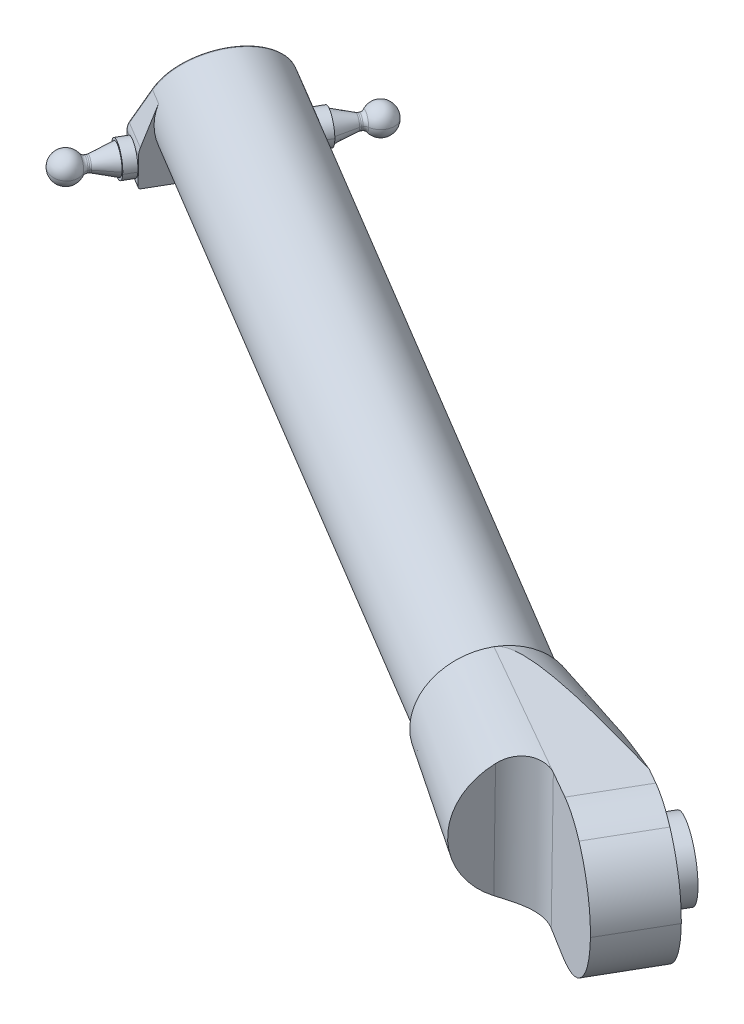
ISO-10303-21;
HEADER;
FILE_DESCRIPTION(('STEP AP214'),'2;1');
FILE_NAME('part.step','',(''),(''),'','','');
FILE_SCHEMA(('AUTOMOTIVE_DESIGN { 1 0 10303 214 1 1 1 1 }'));
ENDSEC;
DATA;
#1=APPLICATION_CONTEXT('core data for automotive mechanical design processes');
#2=APPLICATION_PROTOCOL_DEFINITION('international standard','automotive_design',2000,#1);
#3=PRODUCT_CONTEXT('',#1,'mechanical');
#4=PRODUCT('Part','Part','',(#3));
#5=PRODUCT_RELATED_PRODUCT_CATEGORY('part','',(#4));
#6=PRODUCT_DEFINITION_FORMATION('','',#4);
#7=PRODUCT_DEFINITION_CONTEXT('part definition',#1,'design');
#8=PRODUCT_DEFINITION('design','',#6,#7);
#9=PRODUCT_DEFINITION_SHAPE('','',#8);
#10=(LENGTH_UNIT() NAMED_UNIT(*) SI_UNIT(.MILLI.,.METRE.));
#11=(NAMED_UNIT(*) PLANE_ANGLE_UNIT() SI_UNIT($,.RADIAN.));
#12=(NAMED_UNIT(*) SI_UNIT($,.STERADIAN.) SOLID_ANGLE_UNIT());
#13=UNCERTAINTY_MEASURE_WITH_UNIT(LENGTH_MEASURE(1.E-05),#10,'distance_accuracy_value','');
#14=(GEOMETRIC_REPRESENTATION_CONTEXT(3) GLOBAL_UNCERTAINTY_ASSIGNED_CONTEXT((#13)) GLOBAL_UNIT_ASSIGNED_CONTEXT((#10,
#11,#12)) REPRESENTATION_CONTEXT('',''));
#15=CARTESIAN_POINT('',(0.,0.,0.));
#16=DIRECTION('',(0.,0.,1.));
#17=DIRECTION('',(1.,0.,0.));
#18=AXIS2_PLACEMENT_3D('',#15,#16,#17);
#19=CARTESIAN_POINT('',(-551.938779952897,-90.0000000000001,-284.017488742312));
#20=DIRECTION('',(0.5,0.,-0.866025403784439));
#21=DIRECTION('',(-0.85081590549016,0.186591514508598,-0.491218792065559));
#22=AXIS2_PLACEMENT_3D('',#19,#20,#21);
#23=CYLINDRICAL_SURFACE('',#22,7.);
#24=CARTESIAN_POINT('',(-554.438779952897,-90.0000000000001,-279.68736172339));
#25=DIRECTION('',(0.5,0.,-0.866025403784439));
#26=DIRECTION('',(-0.85081590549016,0.186591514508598,-0.491218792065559));
#27=AXIS2_PLACEMENT_3D('',#24,#25,#26);
#28=CIRCLE('',#27,7.);
#29=CARTESIAN_POINT('',(-560.394491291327,-88.6938593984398,-283.125893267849));
#30=VERTEX_POINT('',#29);
#31=CARTESIAN_POINT('',(-548.483068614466,-91.3061406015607,-276.248830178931));
#32=VERTEX_POINT('',#31);
#33=EDGE_CURVE('E26',#30,#32,#28,.T.);
#34=ORIENTED_EDGE('',*,*,#33,.T.);
#35=DIRECTION('',(0.5,0.,-0.866025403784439));
#36=VECTOR('',#35,1.);
#37=CARTESIAN_POINT('',(-545.983068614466,-91.3061406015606,-280.578957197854));
#38=LINE('',#37,#36);
#39=CARTESIAN_POINT('',(-545.983068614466,-91.3061406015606,-280.578957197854));
#40=VERTEX_POINT('',#39);
#41=EDGE_CURVE('E39',#32,#40,#38,.T.);
#42=ORIENTED_EDGE('',*,*,#41,.T.);
#43=CARTESIAN_POINT('',(-551.938779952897,-90.0000000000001,-284.017488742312));
#44=DIRECTION('',(0.5,0.,-0.866025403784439));
#45=DIRECTION('',(-0.85081590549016,0.186591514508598,-0.491218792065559));
#46=AXIS2_PLACEMENT_3D('',#43,#44,#45);
#47=CIRCLE('',#46,7.);
#48=CARTESIAN_POINT('',(-548.334953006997,-84.3712131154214,-281.936818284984));
#49=VERTEX_POINT('',#48);
#50=EDGE_CURVE('E452',#49,#40,#47,.T.);
#51=ORIENTED_EDGE('',*,*,#50,.F.);
#52=CARTESIAN_POINT('',(-551.938779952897,-90.0000000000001,-284.017488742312));
#53=DIRECTION('',(0.5,0.,-0.866025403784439));
#54=DIRECTION('',(-0.85081590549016,0.186591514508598,-0.491218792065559));
#55=AXIS2_PLACEMENT_3D('',#52,#53,#54);
#56=CIRCLE('',#55,7.);
#57=CARTESIAN_POINT('',(-555.124223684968,-84.0442802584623,-285.856605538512));
#58=VERTEX_POINT('',#57);
#59=EDGE_CURVE('E637',#58,#49,#56,.T.);
#60=ORIENTED_EDGE('',*,*,#59,.F.);
#61=CARTESIAN_POINT('',(-551.938779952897,-90.0000000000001,-284.017488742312));
#62=DIRECTION('',(0.5,0.,-0.866025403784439));
#63=DIRECTION('',(-0.85081590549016,0.186591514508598,-0.491218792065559));
#64=AXIS2_PLACEMENT_3D('',#61,#62,#63);
#65=CIRCLE('',#64,7.);
#66=CARTESIAN_POINT('',(-557.469306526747,-87.1333467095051,-287.210539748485));
#67=VERTEX_POINT('',#66);
#68=EDGE_CURVE('E609',#67,#58,#65,.T.);
#69=ORIENTED_EDGE('',*,*,#68,.F.);
#70=CARTESIAN_POINT('',(-551.938779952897,-90.0000000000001,-284.017488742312));
#71=DIRECTION('',(0.5,0.,-0.866025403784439));
#72=DIRECTION('',(-0.85081590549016,0.186591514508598,-0.491218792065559));
#73=AXIS2_PLACEMENT_3D('',#70,#71,#72);
#74=CIRCLE('',#73,7.);
#75=CARTESIAN_POINT('',(-557.894491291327,-88.6938593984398,-287.456020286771));
#76=VERTEX_POINT('',#75);
#77=EDGE_CURVE('E408',#76,#67,#74,.T.);
#78=ORIENTED_EDGE('',*,*,#77,.F.);
#79=DIRECTION('',(0.5,0.,-0.866025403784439));
#80=VECTOR('',#79,1.);
#81=CARTESIAN_POINT('',(-557.894491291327,-88.6938593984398,-287.456020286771));
#82=LINE('',#81,#80);
#83=EDGE_CURVE('E486',#30,#76,#82,.T.);
#84=ORIENTED_EDGE('',*,*,#83,.F.);
#85=EDGE_LOOP('',(#34,#42,#51,#60,#69,#78,#84));
#86=FACE_BOUND('',#85,.T.);
#87=ADVANCED_FACE('F16',(#86),#23,.T.);
#88=CARTESIAN_POINT('',(-559.050555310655,-90.0000000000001,-271.699532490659));
#89=DIRECTION('',(0.5,0.,-0.866025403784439));
#90=DIRECTION('',(-0.85081590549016,0.186591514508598,-0.491218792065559));
#91=AXIS2_PLACEMENT_3D('',#88,#89,#90);
#92=CONICAL_SURFACE('',#91,3.09252464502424,0.305363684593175);
#93=CARTESIAN_POINT('',(-559.050555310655,-90.0000000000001,-271.699532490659));
#94=DIRECTION('',(0.5,0.,-0.866025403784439));
#95=DIRECTION('',(-0.85081590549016,0.186591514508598,-0.491218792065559));
#96=AXIS2_PLACEMENT_3D('',#93,#94,#95);
#97=CIRCLE('',#96,3.09252464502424);
#98=CARTESIAN_POINT('',(-561.681724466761,-89.4229611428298,-273.218638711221));
#99=VERTEX_POINT('',#98);
#100=CARTESIAN_POINT('',(-556.419386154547,-90.5770388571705,-270.180426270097));
#101=VERTEX_POINT('',#100);
#102=EDGE_CURVE('E524',#99,#101,#97,.T.);
#103=ORIENTED_EDGE('',*,*,#102,.T.);
#104=DIRECTION('',(0.732658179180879,-0.0560968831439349,-0.678281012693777));
#105=VECTOR('',#104,1.);
#106=CARTESIAN_POINT('',(-556.419386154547,-90.5770388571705,-270.180426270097));
#107=LINE('',#106,#105);
#108=CARTESIAN_POINT('',(-549.333884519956,-91.1195490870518,-276.740048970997));
#109=VERTEX_POINT('',#108);
#110=EDGE_CURVE('E529',#101,#109,#107,.T.);
#111=ORIENTED_EDGE('',*,*,#110,.T.);
#112=CARTESIAN_POINT('',(-554.438779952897,-90.0000000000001,-279.68736172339));
#113=DIRECTION('',(0.5,0.,-0.866025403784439));
#114=DIRECTION('',(-0.850815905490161,0.186591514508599,-0.491218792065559));
#115=AXIS2_PLACEMENT_3D('',#112,#113,#114);
#116=CIRCLE('',#115,6.);
#117=CARTESIAN_POINT('',(-559.543675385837,-88.8804509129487,-282.634674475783));
#118=VERTEX_POINT('',#117);
#119=EDGE_CURVE('E456',#118,#109,#116,.T.);
#120=ORIENTED_EDGE('',*,*,#119,.F.);
#121=DIRECTION('',(0.221079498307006,0.056096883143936,-0.973641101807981));
#122=VECTOR('',#121,1.);
#123=CARTESIAN_POINT('',(-561.681724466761,-89.4229611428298,-273.218638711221));
#124=LINE('',#123,#122);
#125=EDGE_CURVE('E459',#99,#118,#124,.T.);
#126=ORIENTED_EDGE('',*,*,#125,.F.);
#127=EDGE_LOOP('',(#103,#111,#120,#126));
#128=FACE_BOUND('',#127,.T.);
#129=ADVANCED_FACE('F757',(#128),#92,.T.);
#130=CARTESIAN_POINT('',(-559.351195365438,-90.0000000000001,-271.178808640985));
#131=DIRECTION('',(0.5,0.,-0.866025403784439));
#132=DIRECTION('',(-0.85081590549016,0.186591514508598,-0.491218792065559));
#133=AXIS2_PLACEMENT_3D('',#130,#131,#132);
#134=TOROIDAL_SURFACE('',#133,5.,2.);
#135=CARTESIAN_POINT('',(-559.050555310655,-90.0000000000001,-271.699532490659));
#136=DIRECTION('',(0.5,0.,-0.866025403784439));
#137=DIRECTION('',(-0.85081590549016,0.186591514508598,-0.491218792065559));
#138=AXIS2_PLACEMENT_3D('',#135,#136,#137);
#139=CIRCLE('',#138,3.09252464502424);
#140=EDGE_CURVE('E466',#101,#99,#139,.T.);
#141=ORIENTED_EDGE('',*,*,#140,.F.);
#142=CARTESIAN_POINT('',(-555.097115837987,-90.9329575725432,-268.722714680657));
#143=DIRECTION('',(0.161592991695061,0.982437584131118,0.093295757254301));
#144=DIRECTION('',(0.850815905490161,-0.186591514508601,0.491218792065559));
#145=AXIS2_PLACEMENT_3D('',#142,#143,#144);
#146=CIRCLE('',#145,2.);
#147=CARTESIAN_POINT('',(-556.798747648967,-90.5597745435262,-269.705152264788));
#148=VERTEX_POINT('',#147);
#149=EDGE_CURVE('E533',#101,#148,#146,.T.);
#150=ORIENTED_EDGE('',*,*,#149,.T.);
#151=CARTESIAN_POINT('',(-559.351195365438,-90.0000000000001,-271.178808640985));
#152=DIRECTION('',(0.5,0.,-0.866025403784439));
#153=DIRECTION('',(-0.850815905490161,0.186591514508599,-0.491218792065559));
#154=AXIS2_PLACEMENT_3D('',#151,#152,#153);
#155=CIRCLE('',#154,3.);
#156=CARTESIAN_POINT('',(-561.903643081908,-89.4402254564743,-272.652465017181));
#157=VERTEX_POINT('',#156);
#158=EDGE_CURVE('E627',#148,#157,#155,.T.);
#159=ORIENTED_EDGE('',*,*,#158,.T.);
#160=CARTESIAN_POINT('',(-563.605274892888,-89.0670424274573,-273.634902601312));
#161=DIRECTION('',(-0.161592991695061,-0.982437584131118,-0.093295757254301));
#162=DIRECTION('',(-0.850815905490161,0.186591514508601,-0.491218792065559));
#163=AXIS2_PLACEMENT_3D('',#160,#161,#162);
#164=CIRCLE('',#163,2.);
#165=EDGE_CURVE('E465',#99,#157,#164,.T.);
#166=ORIENTED_EDGE('',*,*,#165,.F.);
#167=EDGE_LOOP('',(#141,#150,#159,#166));
#168=FACE_BOUND('',#167,.T.);
#169=ADVANCED_FACE('F753',(#168),#134,.F.);
#170=CARTESIAN_POINT('',(-551.938779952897,-90.0000000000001,-284.017488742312));
#171=DIRECTION('',(0.5,0.,-0.866025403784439));
#172=DIRECTION('',(-0.850815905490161,0.186591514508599,-0.491218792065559));
#173=AXIS2_PLACEMENT_3D('',#170,#171,#172);
#174=CYLINDRICAL_SURFACE('',#173,3.);
#175=CARTESIAN_POINT('',(-559.657678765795,-90.0000000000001,-270.647963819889));
#176=DIRECTION('',(0.5,0.,-0.866025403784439));
#177=DIRECTION('',(-0.850815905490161,0.186591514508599,-0.491218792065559));
#178=AXIS2_PLACEMENT_3D('',#175,#176,#177);
#179=CIRCLE('',#178,3.);
#180=CARTESIAN_POINT('',(-562.210126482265,-89.4402254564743,-272.121620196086));
#181=VERTEX_POINT('',#180);
#182=CARTESIAN_POINT('',(-557.105231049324,-90.5597745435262,-269.174307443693));
#183=VERTEX_POINT('',#182);
#184=EDGE_CURVE('E495',#181,#183,#179,.T.);
#185=ORIENTED_EDGE('',*,*,#184,.T.);
#186=DIRECTION('',(0.5,0.,-0.866025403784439));
#187=VECTOR('',#186,1.);
#188=CARTESIAN_POINT('',(-549.386332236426,-90.5597745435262,-282.543832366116));
#189=LINE('',#188,#187);
#190=EDGE_CURVE('E492',#183,#148,#189,.T.);
#191=ORIENTED_EDGE('',*,*,#190,.T.);
#192=CARTESIAN_POINT('',(-559.351195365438,-90.0000000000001,-271.178808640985));
#193=DIRECTION('',(0.5,0.,-0.866025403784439));
#194=DIRECTION('',(-0.850815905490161,0.186591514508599,-0.491218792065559));
#195=AXIS2_PLACEMENT_3D('',#192,#193,#194);
#196=CIRCLE('',#195,3.);
#197=EDGE_CURVE('E461',#157,#148,#196,.T.);
#198=ORIENTED_EDGE('',*,*,#197,.F.);
#199=DIRECTION('',(0.5,0.,-0.866025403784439));
#200=VECTOR('',#199,1.);
#201=CARTESIAN_POINT('',(-554.491227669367,-89.4402254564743,-285.491145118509));
#202=LINE('',#201,#200);
#203=EDGE_CURVE('E1174',#181,#157,#202,.T.);
#204=ORIENTED_EDGE('',*,*,#203,.F.);
#205=EDGE_LOOP('',(#185,#191,#198,#204));
#206=FACE_BOUND('',#205,.T.);
#207=ADVANCED_FACE('F756',(#206),#174,.T.);
#208=CARTESIAN_POINT('',(-559.657678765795,-90.0000000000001,-270.647963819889));
#209=DIRECTION('',(0.5,0.,-0.866025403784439));
#210=DIRECTION('',(-0.85081590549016,0.186591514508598,-0.491218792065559));
#211=AXIS2_PLACEMENT_3D('',#208,#209,#210);
#212=TOROIDAL_SURFACE('',#211,5.,2.);
#213=CARTESIAN_POINT('',(-559.657678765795,-90.0000000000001,-270.647963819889));
#214=DIRECTION('',(0.5,0.,-0.866025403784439));
#215=DIRECTION('',(-0.850815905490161,0.186591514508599,-0.491218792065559));
#216=AXIS2_PLACEMENT_3D('',#213,#214,#215);
#217=CIRCLE('',#216,3.);
#218=EDGE_CURVE('E1178',#183,#181,#217,.T.);
#219=ORIENTED_EDGE('',*,*,#218,.F.);
#220=CARTESIAN_POINT('',(-555.403599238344,-90.9329575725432,-268.191869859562));
#221=DIRECTION('',(0.161592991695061,0.982437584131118,0.093295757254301));
#222=DIRECTION('',(0.850815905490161,-0.186591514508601,0.491218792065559));
#223=AXIS2_PLACEMENT_3D('',#220,#221,#222);
#224=CIRCLE('',#223,2.);
#225=CARTESIAN_POINT('',(-557.230309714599,-90.7067860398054,-267.40958137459));
#226=VERTEX_POINT('',#225);
#227=EDGE_CURVE('E421',#183,#226,#224,.T.);
#228=ORIENTED_EDGE('',*,*,#227,.T.);
#229=CARTESIAN_POINT('',(-560.453097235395,-90.0000000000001,-269.270258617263));
#230=DIRECTION('',(0.5,0.,-0.866025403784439));
#231=DIRECTION('',(-0.85081590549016,0.186591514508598,-0.491218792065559));
#232=AXIS2_PLACEMENT_3D('',#229,#230,#231);
#233=CIRCLE('',#232,3.78787878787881);
#234=CARTESIAN_POINT('',(-563.675884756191,-89.2932139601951,-271.130935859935));
#235=VERTEX_POINT('',#234);
#236=EDGE_CURVE('E417',#226,#235,#233,.T.);
#237=ORIENTED_EDGE('',*,*,#236,.T.);
#238=CARTESIAN_POINT('',(-563.911758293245,-89.0670424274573,-273.104057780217));
#239=DIRECTION('',(-0.161592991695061,-0.982437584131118,-0.093295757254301));
#240=DIRECTION('',(-0.850815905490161,0.186591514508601,-0.491218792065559));
#241=AXIS2_PLACEMENT_3D('',#238,#239,#240);
#242=CIRCLE('',#241,2.);
#243=EDGE_CURVE('E1170',#181,#235,#242,.T.);
#244=ORIENTED_EDGE('',*,*,#243,.F.);
#245=EDGE_LOOP('',(#219,#228,#237,#244));
#246=FACE_BOUND('',#245,.T.);
#247=ADVANCED_FACE('F880',(#246),#212,.F.);
#248=CARTESIAN_POINT('',(-562.938779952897,-90.0000000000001,-264.964929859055));
#249=DIRECTION('',(-0.161592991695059,-0.982437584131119,-0.0932957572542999));
#250=DIRECTION('',(0.850815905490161,-0.186591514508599,0.491218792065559));
#251=AXIS2_PLACEMENT_3D('',#248,#249,#250);
#252=SPHERICAL_SURFACE('',#251,6.25);
#253=CARTESIAN_POINT('',(-562.938779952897,-90.0000000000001,-264.964929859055));
#254=DIRECTION('',(0.161592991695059,0.982437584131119,0.0932957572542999));
#255=DIRECTION('',(0.850815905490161,-0.186591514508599,0.491218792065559));
#256=AXIS2_PLACEMENT_3D('',#253,#254,#255);
#257=CIRCLE('',#256,6.25);
#258=CARTESIAN_POINT('',(-566.063779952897,-90.0000000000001,-259.552271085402));
#259=VERTEX_POINT('',#258);
#260=EDGE_CURVE('E1167',#259,#226,#257,.T.);
#261=ORIENTED_EDGE('',*,*,#260,.F.);
#262=CARTESIAN_POINT('',(-562.938779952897,-90.0000000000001,-264.964929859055));
#263=DIRECTION('',(-0.161592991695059,-0.982437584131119,-0.0932957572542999));
#264=DIRECTION('',(-0.850815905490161,0.186591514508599,-0.491218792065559));
#265=AXIS2_PLACEMENT_3D('',#262,#263,#264);
#266=CIRCLE('',#265,6.25);
#267=EDGE_CURVE('E422',#259,#235,#266,.T.);
#268=ORIENTED_EDGE('',*,*,#267,.T.);
#269=ORIENTED_EDGE('',*,*,#236,.F.);
#270=EDGE_LOOP('',(#261,#268,#269));
#271=FACE_BOUND('',#270,.T.);
#272=ADVANCED_FACE('F702',(#271),#252,.T.);
#273=CARTESIAN_POINT('',(-521.938779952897,-90.0000000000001,-335.979012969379));
#274=DIRECTION('',(-0.5,0.,0.866025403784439));
#275=DIRECTION('',(-0.866021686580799,0.00292993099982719,-0.499997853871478));
#276=AXIS2_PLACEMENT_3D('',#273,#274,#275);
#277=CYLINDRICAL_SURFACE('',#276,7.);
#278=CARTESIAN_POINT('',(-519.438779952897,-90.0000000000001,-340.309139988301));
#279=DIRECTION('',(-0.5,0.,0.866025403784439));
#280=DIRECTION('',(-0.866021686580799,0.00292993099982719,-0.499997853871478));
#281=AXIS2_PLACEMENT_3D('',#278,#279,#280);
#282=CIRCLE('',#281,7.);
#283=CARTESIAN_POINT('',(-525.500931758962,-89.9794904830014,-343.809124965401));
#284=VERTEX_POINT('',#283);
#285=CARTESIAN_POINT('',(-513.376628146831,-90.020509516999,-336.8091550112));
#286=VERTEX_POINT('',#285);
#287=EDGE_CURVE('E614',#284,#286,#282,.T.);
#288=ORIENTED_EDGE('',*,*,#287,.T.);
#289=DIRECTION('',(-0.5,0.,0.866025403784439));
#290=VECTOR('',#289,1.);
#291=CARTESIAN_POINT('',(-515.876628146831,-90.020509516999,-332.479027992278));
#292=LINE('',#291,#290);
#293=CARTESIAN_POINT('',(-515.876628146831,-90.020509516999,-332.479027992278));
#294=VERTEX_POINT('',#293);
#295=EDGE_CURVE('E610',#286,#294,#292,.T.);
#296=ORIENTED_EDGE('',*,*,#295,.T.);
#297=CARTESIAN_POINT('',(-521.938779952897,-90.0000000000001,-335.979012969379));
#298=DIRECTION('',(-0.5,0.,0.866025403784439));
#299=DIRECTION('',(-0.866021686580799,0.00292993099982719,-0.499997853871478));
#300=AXIS2_PLACEMENT_3D('',#297,#298,#299);
#301=CIRCLE('',#300,7.);
#302=CARTESIAN_POINT('',(-519.925282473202,-96.6026083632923,-334.816519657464));
#303=VERTEX_POINT('',#302);
#304=EDGE_CURVE('E544',#303,#294,#301,.T.);
#305=ORIENTED_EDGE('',*,*,#304,.F.);
#306=CARTESIAN_POINT('',(-521.938779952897,-90.0000000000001,-335.979012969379));
#307=DIRECTION('',(-0.5,0.,0.866025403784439));
#308=DIRECTION('',(-0.866021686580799,0.00292993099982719,-0.499997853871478));
#309=AXIS2_PLACEMENT_3D('',#306,#307,#308);
#310=CIRCLE('',#309,7.);
#311=CARTESIAN_POINT('',(-524.421374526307,-96.3861020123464,-337.412339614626));
#312=VERTEX_POINT('',#311);
#313=EDGE_CURVE('E536',#312,#303,#310,.T.);
#314=ORIENTED_EDGE('',*,*,#313,.F.);
#315=CARTESIAN_POINT('',(-521.938779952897,-90.0000000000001,-335.979012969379));
#316=DIRECTION('',(-0.5,0.,0.866025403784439));
#317=DIRECTION('',(-0.866021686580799,0.00292993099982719,-0.499997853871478));
#318=AXIS2_PLACEMENT_3D('',#315,#316,#317);
#319=CIRCLE('',#318,7.);
#320=CARTESIAN_POINT('',(-527.656806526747,-92.3249866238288,-339.280317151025));
#321=VERTEX_POINT('',#320);
#322=EDGE_CURVE('E427',#321,#312,#319,.T.);
#323=ORIENTED_EDGE('',*,*,#322,.F.);
#324=CARTESIAN_POINT('',(-521.938779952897,-90.0000000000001,-335.979012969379));
#325=DIRECTION('',(-0.5,0.,0.866025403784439));
#326=DIRECTION('',(-0.866021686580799,0.00292993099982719,-0.499997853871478));
#327=AXIS2_PLACEMENT_3D('',#324,#325,#326);
#328=CIRCLE('',#327,7.);
#329=CARTESIAN_POINT('',(-528.000931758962,-89.9794904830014,-339.478997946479));
#330=VERTEX_POINT('',#329);
#331=EDGE_CURVE('E507',#330,#321,#328,.T.);
#332=ORIENTED_EDGE('',*,*,#331,.F.);
#333=DIRECTION('',(-0.5,0.,0.866025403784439));
#334=VECTOR('',#333,1.);
#335=CARTESIAN_POINT('',(-528.000931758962,-89.9794904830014,-339.478997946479));
#336=LINE('',#335,#334);
#337=EDGE_CURVE('E397',#284,#330,#336,.T.);
#338=ORIENTED_EDGE('',*,*,#337,.F.);
#339=EDGE_LOOP('',(#288,#296,#305,#314,#323,#332,#338));
#340=FACE_BOUND('',#339,.T.);
#341=ADVANCED_FACE('F699',(#340),#277,.T.);
#342=CARTESIAN_POINT('',(-514.827004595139,-90.0000000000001,-348.296969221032));
#343=DIRECTION('',(-0.5,0.,0.866025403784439));
#344=DIRECTION('',(-0.866021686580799,0.00292993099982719,-0.499997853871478));
#345=AXIS2_PLACEMENT_3D('',#342,#343,#344);
#346=CONICAL_SURFACE('',#345,3.09252464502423,0.305363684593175);
#347=CARTESIAN_POINT('',(-514.827004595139,-90.0000000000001,-348.296969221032));
#348=DIRECTION('',(-0.5,0.,0.866025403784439));
#349=DIRECTION('',(-0.866021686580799,0.00292993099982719,-0.499997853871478));
#350=AXIS2_PLACEMENT_3D('',#347,#348,#349);
#351=CIRCLE('',#350,3.09252464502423);
#352=CARTESIAN_POINT('',(-517.505198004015,-89.9909391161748,-349.843224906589));
#353=VERTEX_POINT('',#352);
#354=CARTESIAN_POINT('',(-512.148811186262,-90.0090608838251,-346.750713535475));
#355=VERTEX_POINT('',#354);
#356=EDGE_CURVE('E615',#353,#355,#351,.T.);
#357=ORIENTED_EDGE('',*,*,#356,.T.);
#358=DIRECTION('',(-0.216508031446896,-0.000880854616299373,0.976280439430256));
#359=VECTOR('',#358,1.);
#360=CARTESIAN_POINT('',(-512.148811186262,-90.0090608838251,-346.750713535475));
#361=LINE('',#360,#359);
#362=CARTESIAN_POINT('',(-514.242649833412,-90.0175795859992,-337.309152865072));
#363=VERTEX_POINT('',#362);
#364=EDGE_CURVE('E375',#355,#363,#361,.T.);
#365=ORIENTED_EDGE('',*,*,#364,.T.);
#366=CARTESIAN_POINT('',(-519.438779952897,-90.0000000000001,-340.309139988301));
#367=DIRECTION('',(-0.5,0.,0.866025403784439));
#368=DIRECTION('',(-0.866021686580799,0.00292993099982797,-0.499997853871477));
#369=AXIS2_PLACEMENT_3D('',#366,#367,#368);
#370=CIRCLE('',#369,6.);
#371=CARTESIAN_POINT('',(-524.634910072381,-89.982420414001,-343.30912711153));
#372=VERTEX_POINT('',#371);
#373=EDGE_CURVE('E368',#372,#363,#370,.T.);
#374=ORIENTED_EDGE('',*,*,#373,.F.);
#375=DIRECTION('',(-0.737229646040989,0.000880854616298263,0.675641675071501));
#376=VECTOR('',#375,1.);
#377=CARTESIAN_POINT('',(-517.505198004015,-89.9909391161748,-349.843224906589));
#378=LINE('',#377,#376);
#379=EDGE_CURVE('E372',#353,#372,#378,.T.);
#380=ORIENTED_EDGE('',*,*,#379,.F.);
#381=EDGE_LOOP('',(#357,#365,#374,#380));
#382=FACE_BOUND('',#381,.T.);
#383=ADVANCED_FACE('F371',(#382),#346,.T.);
#384=CARTESIAN_POINT('',(-514.526364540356,-90.0000000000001,-348.817693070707));
#385=DIRECTION('',(-0.5,0.,0.866025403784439));
#386=DIRECTION('',(-0.866021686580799,0.00292993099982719,-0.499997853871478));
#387=AXIS2_PLACEMENT_3D('',#384,#385,#386);
#388=TOROIDAL_SURFACE('',#387,5.,2.);
#389=CARTESIAN_POINT('',(-514.827004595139,-90.0000000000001,-348.296969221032));
#390=DIRECTION('',(-0.5,0.,0.866025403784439));
#391=DIRECTION('',(-0.866021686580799,0.00292993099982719,-0.499997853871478));
#392=AXIS2_PLACEMENT_3D('',#389,#390,#391);
#393=CIRCLE('',#392,3.09252464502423);
#394=EDGE_CURVE('E384',#355,#353,#393,.T.);
#395=ORIENTED_EDGE('',*,*,#394,.F.);
#396=CARTESIAN_POINT('',(-510.196256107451,-90.0146496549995,-346.317703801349));
#397=DIRECTION('',(-0.00253739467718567,-0.999995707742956,-0.00146496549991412));
#398=DIRECTION('',(-0.866021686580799,0.00292993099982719,-0.499997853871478));
#399=AXIS2_PLACEMENT_3D('',#396,#397,#398);
#400=CIRCLE('',#399,2.);
#401=CARTESIAN_POINT('',(-511.928299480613,-90.0087897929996,-347.317699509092));
#402=VERTEX_POINT('',#401);
#403=EDGE_CURVE('E621',#355,#402,#400,.T.);
#404=ORIENTED_EDGE('',*,*,#403,.T.);
#405=CARTESIAN_POINT('',(-514.526364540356,-90.0000000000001,-348.817693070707));
#406=DIRECTION('',(-0.5,0.,0.866025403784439));
#407=DIRECTION('',(-0.866021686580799,0.00292993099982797,-0.499997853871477));
#408=AXIS2_PLACEMENT_3D('',#405,#406,#407);
#409=CIRCLE('',#408,3.);
#410=CARTESIAN_POINT('',(-517.124429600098,-89.9912102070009,-350.317686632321));
#411=VERTEX_POINT('',#410);
#412=EDGE_CURVE('E595',#402,#411,#409,.T.);
#413=ORIENTED_EDGE('',*,*,#412,.T.);
#414=CARTESIAN_POINT('',(-518.856472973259,-89.9853503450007,-351.317682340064));
#415=DIRECTION('',(0.00253739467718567,0.999995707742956,0.00146496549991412));
#416=DIRECTION('',(0.866021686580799,-0.00292993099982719,0.499997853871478));
#417=AXIS2_PLACEMENT_3D('',#414,#415,#416);
#418=CIRCLE('',#417,2.);
#419=EDGE_CURVE('E600',#353,#411,#418,.T.);
#420=ORIENTED_EDGE('',*,*,#419,.F.);
#421=EDGE_LOOP('',(#395,#404,#413,#420));
#422=FACE_BOUND('',#421,.T.);
#423=ADVANCED_FACE('F773',(#422),#388,.F.);
#424=CARTESIAN_POINT('',(-521.938779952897,-90.0000000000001,-335.979012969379));
#425=DIRECTION('',(-0.5,0.,0.866025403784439));
#426=DIRECTION('',(-0.866021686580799,0.00292993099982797,-0.499997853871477));
#427=AXIS2_PLACEMENT_3D('',#424,#425,#426);
#428=CYLINDRICAL_SURFACE('',#427,3.);
#429=CARTESIAN_POINT('',(-514.219881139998,-90.0000000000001,-349.348537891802));
#430=DIRECTION('',(-0.5,0.,0.866025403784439));
#431=DIRECTION('',(-0.866021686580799,0.00292993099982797,-0.499997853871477));
#432=AXIS2_PLACEMENT_3D('',#429,#430,#431);
#433=CIRCLE('',#432,3.);
#434=CARTESIAN_POINT('',(-516.817946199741,-89.9912102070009,-350.848531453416));
#435=VERTEX_POINT('',#434);
#436=CARTESIAN_POINT('',(-511.621816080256,-90.0087897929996,-347.848544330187));
#437=VERTEX_POINT('',#436);
#438=EDGE_CURVE('E591',#435,#437,#433,.T.);
#439=ORIENTED_EDGE('',*,*,#438,.T.);
#440=DIRECTION('',(-0.5,0.,0.866025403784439));
#441=VECTOR('',#440,1.);
#442=CARTESIAN_POINT('',(-519.340714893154,-90.0087897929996,-334.479019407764));
#443=LINE('',#442,#441);
#444=EDGE_CURVE('E596',#437,#402,#443,.T.);
#445=ORIENTED_EDGE('',*,*,#444,.T.);
#446=CARTESIAN_POINT('',(-514.526364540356,-90.0000000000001,-348.817693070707));
#447=DIRECTION('',(-0.5,0.,0.866025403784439));
#448=DIRECTION('',(-0.866021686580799,0.00292993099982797,-0.499997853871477));
#449=AXIS2_PLACEMENT_3D('',#446,#447,#448);
#450=CIRCLE('',#449,3.);
#451=EDGE_CURVE('E604',#411,#402,#450,.T.);
#452=ORIENTED_EDGE('',*,*,#451,.F.);
#453=DIRECTION('',(-0.5,0.,0.866025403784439));
#454=VECTOR('',#453,1.);
#455=CARTESIAN_POINT('',(-524.536845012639,-89.9912102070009,-337.479006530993));
#456=LINE('',#455,#454);
#457=EDGE_CURVE('E555',#435,#411,#456,.T.);
#458=ORIENTED_EDGE('',*,*,#457,.F.);
#459=EDGE_LOOP('',(#439,#445,#452,#458));
#460=FACE_BOUND('',#459,.T.);
#461=ADVANCED_FACE('F769',(#460),#428,.T.);
#462=CARTESIAN_POINT('',(-514.219881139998,-90.0000000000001,-349.348537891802));
#463=DIRECTION('',(-0.5,0.,0.866025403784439));
#464=DIRECTION('',(-0.866021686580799,0.00292993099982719,-0.499997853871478));
#465=AXIS2_PLACEMENT_3D('',#462,#463,#464);
#466=TOROIDAL_SURFACE('',#465,5.,2.);
#467=CARTESIAN_POINT('',(-514.219881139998,-90.0000000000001,-349.348537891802));
#468=DIRECTION('',(-0.5,0.,0.866025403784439));
#469=DIRECTION('',(-0.866021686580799,0.00292993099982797,-0.499997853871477));
#470=AXIS2_PLACEMENT_3D('',#467,#468,#469);
#471=CIRCLE('',#470,3.);
#472=EDGE_CURVE('E550',#437,#435,#471,.T.);
#473=ORIENTED_EDGE('',*,*,#472,.F.);
#474=CARTESIAN_POINT('',(-509.889772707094,-90.0146496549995,-346.848548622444));
#475=DIRECTION('',(-0.00253739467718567,-0.999995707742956,-0.00146496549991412));
#476=DIRECTION('',(-0.866021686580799,0.00292993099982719,-0.499997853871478));
#477=AXIS2_PLACEMENT_3D('',#474,#475,#476);
#478=CIRCLE('',#477,2.);
#479=CARTESIAN_POINT('',(-510.144077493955,-90.0110982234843,-348.832311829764));
#480=VERTEX_POINT('',#479);
#481=EDGE_CURVE('E512',#437,#480,#478,.T.);
#482=ORIENTED_EDGE('',*,*,#481,.T.);
#483=CARTESIAN_POINT('',(-513.424462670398,-90.0000000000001,-350.726243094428));
#484=DIRECTION('',(-0.5,0.,0.866025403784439));
#485=DIRECTION('',(-0.866021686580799,0.00292993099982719,-0.499997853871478));
#486=AXIS2_PLACEMENT_3D('',#483,#484,#485);
#487=CIRCLE('',#486,3.78787878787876);
#488=CARTESIAN_POINT('',(-516.70484784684,-89.988901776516,-352.620174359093));
#489=VERTEX_POINT('',#488);
#490=EDGE_CURVE('E508',#480,#489,#487,.T.);
#491=ORIENTED_EDGE('',*,*,#490,.T.);
#492=CARTESIAN_POINT('',(-518.549989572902,-89.9853503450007,-351.848527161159));
#493=DIRECTION('',(0.00253739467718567,0.999995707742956,0.00146496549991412));
#494=DIRECTION('',(0.866021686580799,-0.00292993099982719,0.499997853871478));
#495=AXIS2_PLACEMENT_3D('',#492,#493,#494);
#496=CIRCLE('',#495,2.);
#497=EDGE_CURVE('E401',#435,#489,#496,.T.);
#498=ORIENTED_EDGE('',*,*,#497,.F.);
#499=EDGE_LOOP('',(#473,#482,#491,#498));
#500=FACE_BOUND('',#499,.T.);
#501=ADVANCED_FACE('F772',(#500),#466,.F.);
#502=CARTESIAN_POINT('',(-510.938779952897,-90.0000000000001,-355.031571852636));
#503=DIRECTION('',(0.00253739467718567,0.999995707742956,0.00146496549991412));
#504=DIRECTION('',(0.866021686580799,-0.00292993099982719,0.499997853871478));
#505=AXIS2_PLACEMENT_3D('',#502,#503,#504);
#506=SPHERICAL_SURFACE('',#505,6.25);
#507=CARTESIAN_POINT('',(-510.938779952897,-90.0000000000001,-355.031571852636));
#508=DIRECTION('',(-0.00253739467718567,-0.999995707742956,-0.00146496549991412));
#509=DIRECTION('',(-0.866021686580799,0.00292993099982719,-0.499997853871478));
#510=AXIS2_PLACEMENT_3D('',#507,#508,#509);
#511=CIRCLE('',#510,6.25);
#512=CARTESIAN_POINT('',(-507.813779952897,-90.0000000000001,-360.444230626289));
#513=VERTEX_POINT('',#512);
#514=EDGE_CURVE('E413',#513,#480,#511,.T.);
#515=ORIENTED_EDGE('',*,*,#514,.F.);
#516=CARTESIAN_POINT('',(-510.938779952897,-90.0000000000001,-355.031571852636));
#517=DIRECTION('',(0.00253739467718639,0.999995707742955,0.00146496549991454));
#518=DIRECTION('',(0.866021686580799,-0.00292993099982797,0.499997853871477));
#519=AXIS2_PLACEMENT_3D('',#516,#517,#518);
#520=CIRCLE('',#519,6.25);
#521=EDGE_CURVE('E513',#513,#489,#520,.T.);
#522=ORIENTED_EDGE('',*,*,#521,.T.);
#523=ORIENTED_EDGE('',*,*,#490,.F.);
#524=EDGE_LOOP('',(#515,#522,#523));
#525=FACE_BOUND('',#524,.T.);
#526=ADVANCED_FACE('F858',(#525),#506,.T.);
#527=CARTESIAN_POINT('',(-432868.372341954,20746.1505888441,-249916.667797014));
#528=DIRECTION('',(0.865273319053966,-0.0416666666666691,0.499565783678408));
#529=DIRECTION('',(-0.5,0.,0.866025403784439));
#530=AXIS2_PLACEMENT_3D('',#527,#528,#529);
#531=CYLINDRICAL_SURFACE('',#530,25.);
#532=CARTESIAN_POINT('',(-248.919525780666,-86.3541666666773,-143.710256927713));
#533=DIRECTION('',(-0.865273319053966,0.0416666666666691,-0.499565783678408));
#534=DIRECTION('',(0.0360843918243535,0.999131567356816,0.0208333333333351));
#535=AXIS2_PLACEMENT_3D('',#532,#533,#534);
#536=CIRCLE('',#535,25.);
#537=CARTESIAN_POINT('',(-248.017415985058,-61.3758774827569,-143.18942359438));
#538=VERTEX_POINT('',#537);
#539=EDGE_CURVE('E10',#538,#538,#536,.F.);
#540=ORIENTED_EDGE('',*,*,#539,.F.);
#541=EDGE_LOOP('',(#540));
#542=FACE_BOUND('',#541,.T.);
#543=CARTESIAN_POINT('',(-529.817753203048,-72.8276975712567,-305.886924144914));
#544=DIRECTION('',(-0.865273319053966,0.0416666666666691,-0.499565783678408));
#545=DIRECTION('',(0.5,0.,-0.866025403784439));
#546=AXIS2_PLACEMENT_3D('',#543,#544,#545);
#547=CIRCLE('',#546,25.);
#548=CARTESIAN_POINT('',(-517.317753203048,-72.8276975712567,-327.537559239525));
#549=VERTEX_POINT('',#548);
#550=CARTESIAN_POINT('',(-530.719862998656,-97.8059867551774,-306.407757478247));
#551=VERTEX_POINT('',#550);
#552=EDGE_CURVE('E540',#549,#551,#547,.T.);
#553=ORIENTED_EDGE('',*,*,#552,.F.);
#554=DIRECTION('',(0.865273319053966,-0.0416666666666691,0.499565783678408));
#555=VECTOR('',#554,1.);
#556=CARTESIAN_POINT('',(-432855.872341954,20746.1505888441,-249938.318432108));
#557=LINE('',#556,#555);
#558=CARTESIAN_POINT('',(-323.045613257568,-82.1827444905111,-215.374486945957));
#559=VERTEX_POINT('',#558);
#560=EDGE_CURVE('E564',#549,#559,#557,.T.);
#561=ORIENTED_EDGE('',*,*,#560,.T.);
#562=ORIENTED_EDGE('',*,*,#560,.F.);
#563=CARTESIAN_POINT('',(-529.817753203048,-72.8276975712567,-305.886924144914));
#564=DIRECTION('',(-0.865273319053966,0.0416666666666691,-0.499565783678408));
#565=DIRECTION('',(0.5,0.,-0.866025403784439));
#566=AXIS2_PLACEMENT_3D('',#563,#564,#565);
#567=CIRCLE('',#566,25.);
#568=CARTESIAN_POINT('',(-517.723587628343,-64.5611951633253,-326.145159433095));
#569=VERTEX_POINT('',#568);
#570=EDGE_CURVE('E546',#569,#549,#567,.T.);
#571=ORIENTED_EDGE('',*,*,#570,.F.);
#572=DIRECTION('',(-0.865273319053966,0.0416666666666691,-0.499565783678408));
#573=VECTOR('',#572,1.);
#574=CARTESIAN_POINT('',(-517.723587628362,-64.5611951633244,-326.145159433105));
#575=LINE('',#574,#573);
#576=CARTESIAN_POINT('',(-524.131108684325,-64.2526452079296,-329.844543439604));
#577=VERTEX_POINT('',#576);
#578=EDGE_CURVE('E835',#569,#577,#575,.T.);
#579=ORIENTED_EDGE('',*,*,#578,.T.);
#580=CARTESIAN_POINT('',(-547.722337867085,-64.2526452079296,-288.983335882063));
#581=CARTESIAN_POINT('',(-546.47634675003,-61.8648943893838,-289.246070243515));
#582=CARTESIAN_POINT('',(-545.087062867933,-59.6080239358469,-289.86088718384));
#583=CARTESIAN_POINT('',(-542.151542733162,-55.5664496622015,-291.737174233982));
#584=CARTESIAN_POINT('',(-540.605852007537,-53.7825536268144,-292.998340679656));
#585=CARTESIAN_POINT('',(-537.503527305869,-50.85579504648,-296.048477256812));
#586=CARTESIAN_POINT('',(-535.947358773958,-49.713371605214,-297.836989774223));
#587=CARTESIAN_POINT('',(-532.970909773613,-48.1775456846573,-301.773219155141));
#588=CARTESIAN_POINT('',(-531.55107586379,-47.784373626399,-303.920345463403));
#589=CARTESIAN_POINT('',(-528.98130743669,-47.784373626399,-308.371314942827));
#590=CARTESIAN_POINT('',(-527.831758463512,-48.1775456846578,-310.67449033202));
#591=CARTESIAN_POINT('',(-525.911108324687,-49.713371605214,-315.220285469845));
#592=CARTESIAN_POINT('',(-525.140295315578,-50.8557950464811,-317.462223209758));
#593=CARTESIAN_POINT('',(-524.049961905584,-53.7825536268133,-321.673983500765));
#594=CARTESIAN_POINT('',(-523.730605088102,-55.5664496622,-323.643174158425));
#595=CARTESIAN_POINT('',(-523.573452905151,-59.6080239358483,-327.123552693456));
#596=CARTESIAN_POINT('',(-523.735647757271,-61.8648943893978,-328.63411629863));
#597=CARTESIAN_POINT('',(-524.131108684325,-64.2526452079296,-329.844543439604));
#598=(BOUNDED_CURVE() B_SPLINE_CURVE(3,(#580,#581,#582,#583,#584,#585,#586,#587,#588,#589,#590,
#591,#592,#593,#594,#595,#596,#597),.UNSPECIFIED.,.F.,.F.) B_SPLINE_CURVE_WITH_KNOTS((4,2,2,2,2,
2,2,2,4),(1.90810380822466,2.21647601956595,2.52484823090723,2.83322044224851,3.14159265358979,
3.44996486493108,3.75833707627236,4.06670928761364,4.37508149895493),
.UNSPECIFIED.) CURVE() GEOMETRIC_REPRESENTATION_ITEM() RATIONAL_B_SPLINE_CURVE((1.,1.,1.,1.,1.,
1.,1.,1.,1.,1.,1.,1.,1.,1.,1.,1.,1.,1.)) REPRESENTATION_ITEM(''));
#599=CARTESIAN_POINT('',(-547.722337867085,-64.2526452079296,-288.983335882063));
#600=VERTEX_POINT('',#599);
#601=EDGE_CURVE('E665',#577,#600,#598,.F.);
#602=ORIENTED_EDGE('',*,*,#601,.T.);
#603=DIRECTION('',(-0.865273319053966,0.0416666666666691,-0.499565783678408));
#604=VECTOR('',#603,1.);
#605=CARTESIAN_POINT('',(-541.314816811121,-64.5611951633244,-285.283951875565));
#606=LINE('',#605,#604);
#607=CARTESIAN_POINT('',(-541.314816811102,-64.5611951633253,-285.283951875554));
#608=VERTEX_POINT('',#607);
#609=EDGE_CURVE('E571',#608,#600,#606,.T.);
#610=ORIENTED_EDGE('',*,*,#609,.F.);
#611=CARTESIAN_POINT('',(-529.817753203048,-72.8276975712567,-305.886924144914));
#612=DIRECTION('',(-0.865273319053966,0.0416666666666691,-0.499565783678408));
#613=DIRECTION('',(0.5,0.,-0.866025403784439));
#614=AXIS2_PLACEMENT_3D('',#611,#612,#613);
#615=CIRCLE('',#614,25.);
#616=CARTESIAN_POINT('',(-542.317753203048,-72.8276975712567,-284.236289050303));
#617=VERTEX_POINT('',#616);
#618=EDGE_CURVE('E1101',#617,#608,#615,.T.);
#619=ORIENTED_EDGE('',*,*,#618,.F.);
#620=DIRECTION('',(0.865273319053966,-0.0416666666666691,0.499565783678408));
#621=VECTOR('',#620,1.);
#622=CARTESIAN_POINT('',(-432880.872341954,20746.1505888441,-249895.017161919));
#623=LINE('',#622,#621);
#624=CARTESIAN_POINT('',(-348.045613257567,-82.1827444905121,-172.073216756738));
#625=VERTEX_POINT('',#624);
#626=EDGE_CURVE('E838',#617,#625,#623,.T.);
#627=ORIENTED_EDGE('',*,*,#626,.T.);
#628=ORIENTED_EDGE('',*,*,#626,.F.);
#629=CARTESIAN_POINT('',(-529.817753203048,-72.8276975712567,-305.886924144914));
#630=DIRECTION('',(-0.865273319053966,0.0416666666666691,-0.499565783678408));
#631=DIRECTION('',(0.5,0.,-0.866025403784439));
#632=AXIS2_PLACEMENT_3D('',#629,#630,#631);
#633=CIRCLE('',#632,25.);
#634=EDGE_CURVE('E1090',#551,#617,#633,.T.);
#635=ORIENTED_EDGE('',*,*,#634,.F.);
#636=EDGE_LOOP('',(#553,#561,#562,#571,#579,#602,#610,#619,#627,#628,#635));
#637=FACE_BOUND('',#636,.T.);
#638=ADVANCED_FACE('F848',(#542,#637),#531,.T.);
#639=CARTESIAN_POINT('',(-529.817753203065,-72.8276975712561,-305.886924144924));
#640=DIRECTION('',(-0.865273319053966,0.0416666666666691,-0.499565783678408));
#641=DIRECTION('',(0.5,0.,-0.866025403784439));
#642=AXIS2_PLACEMENT_3D('',#639,#640,#641);
#643=PLANE('',#642);
#644=DIRECTION('',(0.5,0.,-0.866025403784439));
#645=VECTOR('',#644,1.);
#646=CARTESIAN_POINT('',(-545.719862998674,-97.8059867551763,-280.426995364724));
#647=LINE('',#646,#645);
#648=CARTESIAN_POINT('',(-545.219862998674,-97.8059867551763,-281.293020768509));
#649=VERTEX_POINT('',#648);
#650=EDGE_CURVE('E842',#649,#551,#647,.T.);
#651=ORIENTED_EDGE('',*,*,#650,.T.);
#652=ORIENTED_EDGE('',*,*,#634,.T.);
#653=ORIENTED_EDGE('',*,*,#618,.T.);
#654=DIRECTION('',(-0.199524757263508,-0.942829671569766,0.266949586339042));
#655=VECTOR('',#654,1.);
#656=CARTESIAN_POINT('',(-545.178597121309,-82.8190132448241,-280.114495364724));
#657=LINE('',#656,#655);
#658=CARTESIAN_POINT('',(-544.838863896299,-81.2136457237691,-280.569033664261));
#659=VERTEX_POINT('',#658);
#660=EDGE_CURVE('E1105',#608,#659,#657,.T.);
#661=ORIENTED_EDGE('',*,*,#660,.T.);
#662=CARTESIAN_POINT('',(-540.240038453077,-84.520246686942,-288.810222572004));
#663=DIRECTION('',(0.865273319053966,-0.0416666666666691,0.499565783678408));
#664=DIRECTION('',(-0.5,0.,0.866025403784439));
#665=AXIS2_PLACEMENT_3D('',#662,#663,#664);
#666=CIRCLE('',#665,10.);
#667=CARTESIAN_POINT('',(-545.240038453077,-84.520246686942,-280.14996853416));
#668=VERTEX_POINT('',#667);
#669=EDGE_CURVE('E502',#659,#668,#666,.T.);
#670=ORIENTED_EDGE('',*,*,#669,.T.);
#671=DIRECTION('',(-0.0360843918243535,-0.999131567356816,-0.0208333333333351));
#672=VECTOR('',#671,1.);
#673=CARTESIAN_POINT('',(-545.719862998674,-97.8059867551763,-280.426995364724));
#674=LINE('',#673,#672);
#675=CARTESIAN_POINT('',(-545.68377860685,-96.8068551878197,-280.406162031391));
#676=VERTEX_POINT('',#675);
#677=EDGE_CURVE('E498',#668,#676,#674,.T.);
#678=ORIENTED_EDGE('',*,*,#677,.T.);
#679=CARTESIAN_POINT('',(-545.18377860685,-96.8068551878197,-281.272187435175));
#680=DIRECTION('',(0.865273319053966,-0.0416666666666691,0.499565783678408));
#681=DIRECTION('',(-0.5,0.,0.866025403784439));
#682=AXIS2_PLACEMENT_3D('',#679,#680,#681);
#683=CIRCLE('',#682,1.);
#684=EDGE_CURVE('E503',#676,#649,#683,.T.);
#685=ORIENTED_EDGE('',*,*,#684,.T.);
#686=EDGE_LOOP('',(#651,#652,#653,#661,#670,#678,#685));
#687=FACE_BOUND('',#686,.T.);
#688=ADVANCED_FACE('F857',(#687),#643,.F.);
#689=CARTESIAN_POINT('',(-521.938779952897,-90.0000000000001,-335.979012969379));
#690=DIRECTION('',(0.5,0.,-0.866025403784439));
#691=DIRECTION('',(-0.0360843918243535,-0.999131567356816,-0.0208333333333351));
#692=AXIS2_PLACEMENT_3D('',#689,#690,#691);
#693=PLANE('',#692);
#694=ORIENTED_EDGE('',*,*,#313,.T.);
#695=DIRECTION('',(-0.865273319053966,0.0416666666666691,-0.499565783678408));
#696=VECTOR('',#695,1.);
#697=CARTESIAN_POINT('',(-515.68377860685,-96.8068551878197,-332.367686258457));
#698=LINE('',#697,#696);
#699=EDGE_CURVE('E560',#303,#312,#698,.T.);
#700=ORIENTED_EDGE('',*,*,#699,.T.);
#701=EDGE_LOOP('',(#694,#700));
#702=FACE_BOUND('',#701,.T.);
#703=ADVANCED_FACE('F870',(#702),#693,.F.);
#704=CARTESIAN_POINT('',(-521.938779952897,-90.0000000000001,-335.979012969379));
#705=DIRECTION('',(0.5,0.,-0.866025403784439));
#706=DIRECTION('',(-0.0360843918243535,-0.999131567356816,-0.0208333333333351));
#707=AXIS2_PLACEMENT_3D('',#704,#705,#706);
#708=PLANE('',#707);
#709=CARTESIAN_POINT('',(-521.938779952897,-90.0000000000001,-335.979012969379));
#710=DIRECTION('',(-0.5,0.,0.866025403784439));
#711=DIRECTION('',(-0.866021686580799,0.00292993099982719,-0.499997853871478));
#712=AXIS2_PLACEMENT_3D('',#709,#710,#711);
#713=CIRCLE('',#712,7.);
#714=CARTESIAN_POINT('',(-527.469306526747,-87.1333467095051,-339.172063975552));
#715=VERTEX_POINT('',#714);
#716=EDGE_CURVE('E556',#715,#330,#713,.T.);
#717=ORIENTED_EDGE('',*,*,#716,.T.);
#718=ORIENTED_EDGE('',*,*,#331,.T.);
#719=DIRECTION('',(0.0360843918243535,0.999131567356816,0.0208333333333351));
#720=VECTOR('',#719,1.);
#721=CARTESIAN_POINT('',(-527.356050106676,-83.9974184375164,-339.106675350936));
#722=LINE('',#721,#720);
#723=EDGE_CURVE('E416',#321,#715,#722,.T.);
#724=ORIENTED_EDGE('',*,*,#723,.T.);
#725=EDGE_LOOP('',(#717,#718,#724));
#726=FACE_BOUND('',#725,.T.);
#727=ADVANCED_FACE('F873',(#726),#708,.F.);
#728=CARTESIAN_POINT('',(-510.938779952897,-90.0000000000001,-355.031571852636));
#729=DIRECTION('',(0.00253739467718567,0.999995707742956,0.00146496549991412));
#730=DIRECTION('',(0.866021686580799,-0.00292993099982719,0.499997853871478));
#731=AXIS2_PLACEMENT_3D('',#728,#729,#730);
#732=SPHERICAL_SURFACE('',#731,6.25);
#733=ORIENTED_EDGE('',*,*,#521,.F.);
#734=ORIENTED_EDGE('',*,*,#514,.T.);
#735=CARTESIAN_POINT('',(-513.424462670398,-90.0000000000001,-350.726243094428));
#736=DIRECTION('',(-0.5,0.,0.866025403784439));
#737=DIRECTION('',(-0.866021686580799,0.00292993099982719,-0.499997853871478));
#738=AXIS2_PLACEMENT_3D('',#735,#736,#737);
#739=CIRCLE('',#738,3.78787878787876);
#740=EDGE_CURVE('E554',#489,#480,#739,.T.);
#741=ORIENTED_EDGE('',*,*,#740,.F.);
#742=EDGE_LOOP('',(#733,#734,#741));
#743=FACE_BOUND('',#742,.T.);
#744=ADVANCED_FACE('F904',(#743),#732,.T.);
#745=CARTESIAN_POINT('',(-514.219881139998,-90.0000000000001,-349.348537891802));
#746=DIRECTION('',(-0.5,0.,0.866025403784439));
#747=DIRECTION('',(-0.866021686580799,0.00292993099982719,-0.499997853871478));
#748=AXIS2_PLACEMENT_3D('',#745,#746,#747);
#749=TOROIDAL_SURFACE('',#748,5.,2.);
#750=ORIENTED_EDGE('',*,*,#481,.F.);
#751=ORIENTED_EDGE('',*,*,#438,.F.);
#752=ORIENTED_EDGE('',*,*,#497,.T.);
#753=ORIENTED_EDGE('',*,*,#740,.T.);
#754=EDGE_LOOP('',(#750,#751,#752,#753));
#755=FACE_BOUND('',#754,.T.);
#756=ADVANCED_FACE('F885',(#755),#749,.F.);
#757=CARTESIAN_POINT('',(-521.938779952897,-90.0000000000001,-335.979012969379));
#758=DIRECTION('',(-0.5,0.,0.866025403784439));
#759=DIRECTION('',(-0.866021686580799,0.00292993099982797,-0.499997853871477));
#760=AXIS2_PLACEMENT_3D('',#757,#758,#759);
#761=CYLINDRICAL_SURFACE('',#760,3.);
#762=ORIENTED_EDGE('',*,*,#444,.F.);
#763=ORIENTED_EDGE('',*,*,#472,.T.);
#764=ORIENTED_EDGE('',*,*,#457,.T.);
#765=ORIENTED_EDGE('',*,*,#412,.F.);
#766=EDGE_LOOP('',(#762,#763,#764,#765));
#767=FACE_BOUND('',#766,.T.);
#768=ADVANCED_FACE('F882',(#767),#761,.T.);
#769=CARTESIAN_POINT('',(-514.526364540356,-90.0000000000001,-348.817693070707));
#770=DIRECTION('',(-0.5,0.,0.866025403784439));
#771=DIRECTION('',(-0.866021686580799,0.00292993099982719,-0.499997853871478));
#772=AXIS2_PLACEMENT_3D('',#769,#770,#771);
#773=TOROIDAL_SURFACE('',#772,5.,2.);
#774=ORIENTED_EDGE('',*,*,#403,.F.);
#775=ORIENTED_EDGE('',*,*,#356,.F.);
#776=ORIENTED_EDGE('',*,*,#419,.T.);
#777=ORIENTED_EDGE('',*,*,#451,.T.);
#778=EDGE_LOOP('',(#774,#775,#776,#777));
#779=FACE_BOUND('',#778,.T.);
#780=ADVANCED_FACE('F698',(#779),#773,.F.);
#781=CARTESIAN_POINT('',(-514.827004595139,-90.0000000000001,-348.296969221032));
#782=DIRECTION('',(-0.5,0.,0.866025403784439));
#783=DIRECTION('',(-0.866021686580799,0.00292993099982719,-0.499997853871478));
#784=AXIS2_PLACEMENT_3D('',#781,#782,#783);
#785=CONICAL_SURFACE('',#784,3.09252464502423,0.305363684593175);
#786=ORIENTED_EDGE('',*,*,#364,.F.);
#787=ORIENTED_EDGE('',*,*,#394,.T.);
#788=ORIENTED_EDGE('',*,*,#379,.T.);
#789=CARTESIAN_POINT('',(-519.438779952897,-90.0000000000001,-340.309139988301));
#790=DIRECTION('',(-0.5,0.,0.866025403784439));
#791=DIRECTION('',(-0.866021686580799,0.00292993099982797,-0.499997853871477));
#792=AXIS2_PLACEMENT_3D('',#789,#790,#791);
#793=CIRCLE('',#792,6.);
#794=EDGE_CURVE('E380',#363,#372,#793,.T.);
#795=ORIENTED_EDGE('',*,*,#794,.F.);
#796=EDGE_LOOP('',(#786,#787,#788,#795));
#797=FACE_BOUND('',#796,.T.);
#798=ADVANCED_FACE('F383',(#797),#785,.T.);
#799=CARTESIAN_POINT('',(-513.376628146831,-90.020509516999,-336.8091550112));
#800=DIRECTION('',(-0.5,0.,0.866025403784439));
#801=DIRECTION('',(-0.0360843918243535,-0.999131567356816,-0.0208333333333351));
#802=AXIS2_PLACEMENT_3D('',#799,#800,#801);
#803=PLANE('',#802);
#804=ORIENTED_EDGE('',*,*,#287,.F.);
#805=CARTESIAN_POINT('',(-519.438779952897,-90.0000000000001,-340.309139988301));
#806=DIRECTION('',(-0.5,0.,0.866025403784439));
#807=DIRECTION('',(-0.866021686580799,0.00292993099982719,-0.499997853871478));
#808=AXIS2_PLACEMENT_3D('',#805,#806,#807);
#809=CIRCLE('',#808,7.);
#810=EDGE_CURVE('E390',#286,#284,#809,.T.);
#811=ORIENTED_EDGE('',*,*,#810,.F.);
#812=EDGE_LOOP('',(#804,#811));
#813=FACE_BOUND('',#812,.T.);
#814=ORIENTED_EDGE('',*,*,#373,.T.);
#815=ORIENTED_EDGE('',*,*,#794,.T.);
#816=EDGE_LOOP('',(#814,#815));
#817=FACE_BOUND('',#816,.T.);
#818=ADVANCED_FACE('F388',(#813,#817),#803,.F.);
#819=CARTESIAN_POINT('',(-521.938779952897,-90.0000000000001,-335.979012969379));
#820=DIRECTION('',(-0.5,0.,0.866025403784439));
#821=DIRECTION('',(-0.866021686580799,0.00292993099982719,-0.499997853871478));
#822=AXIS2_PLACEMENT_3D('',#819,#820,#821);
#823=CYLINDRICAL_SURFACE('',#822,7.);
#824=ORIENTED_EDGE('',*,*,#295,.F.);
#825=ORIENTED_EDGE('',*,*,#810,.T.);
#826=ORIENTED_EDGE('',*,*,#337,.T.);
#827=ORIENTED_EDGE('',*,*,#716,.F.);
#828=CARTESIAN_POINT('',(-521.938779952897,-90.0000000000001,-335.979012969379));
#829=DIRECTION('',(-0.5,0.,0.866025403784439));
#830=DIRECTION('',(-0.866021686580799,0.00292993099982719,-0.499997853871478));
#831=AXIS2_PLACEMENT_3D('',#828,#829,#830);
#832=CIRCLE('',#831,7.);
#833=CARTESIAN_POINT('',(-525.124223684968,-84.0442802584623,-337.818129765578));
#834=VERTEX_POINT('',#833);
#835=EDGE_CURVE('E638',#834,#715,#832,.T.);
#836=ORIENTED_EDGE('',*,*,#835,.F.);
#837=CARTESIAN_POINT('',(-521.938779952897,-90.0000000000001,-335.979012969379));
#838=DIRECTION('',(-0.5,0.,0.866025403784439));
#839=DIRECTION('',(-0.866021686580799,0.00292993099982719,-0.499997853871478));
#840=AXIS2_PLACEMENT_3D('',#837,#838,#839);
#841=CIRCLE('',#840,7.);
#842=CARTESIAN_POINT('',(-518.334953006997,-84.3712131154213,-333.898342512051));
#843=VERTEX_POINT('',#842);
#844=EDGE_CURVE('E439',#843,#834,#841,.T.);
#845=ORIENTED_EDGE('',*,*,#844,.F.);
#846=CARTESIAN_POINT('',(-521.938779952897,-90.0000000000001,-335.979012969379));
#847=DIRECTION('',(-0.5,0.,0.866025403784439));
#848=DIRECTION('',(-0.866021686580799,0.00292993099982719,-0.499997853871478));
#849=AXIS2_PLACEMENT_3D('',#846,#847,#848);
#850=CIRCLE('',#849,7.);
#851=EDGE_CURVE('E541',#294,#843,#850,.T.);
#852=ORIENTED_EDGE('',*,*,#851,.F.);
#853=EDGE_LOOP('',(#824,#825,#826,#827,#836,#845,#852));
#854=FACE_BOUND('',#853,.T.);
#855=ADVANCED_FACE('F724',(#854),#823,.T.);
#856=CARTESIAN_POINT('',(-521.938779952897,-90.0000000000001,-335.979012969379));
#857=DIRECTION('',(0.5,0.,-0.866025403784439));
#858=DIRECTION('',(-0.0360843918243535,-0.999131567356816,-0.0208333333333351));
#859=AXIS2_PLACEMENT_3D('',#856,#857,#858);
#860=PLANE('',#859);
#861=ORIENTED_EDGE('',*,*,#844,.T.);
#862=DIRECTION('',(0.865273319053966,-0.0416666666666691,0.499565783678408));
#863=VECTOR('',#862,1.);
#864=CARTESIAN_POINT('',(-515.240038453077,-84.520246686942,-332.111492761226));
#865=LINE('',#864,#863);
#866=EDGE_CURVE('E435',#834,#843,#865,.T.);
#867=ORIENTED_EDGE('',*,*,#866,.T.);
#868=EDGE_LOOP('',(#861,#867));
#869=FACE_BOUND('',#868,.T.);
#870=ADVANCED_FACE('F720',(#869),#860,.F.);
#871=CARTESIAN_POINT('',(-515.719862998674,-97.8059867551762,-332.388519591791));
#872=DIRECTION('',(-0.5,0.,0.866025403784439));
#873=DIRECTION('',(-0.865273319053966,0.0416666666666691,-0.499565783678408));
#874=AXIS2_PLACEMENT_3D('',#871,#872,#873);
#875=PLANE('',#874);
#876=DIRECTION('',(0.0360843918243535,0.999131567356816,0.0208333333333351));
#877=VECTOR('',#876,1.);
#878=CARTESIAN_POINT('',(-527.356050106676,-83.9974184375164,-339.106675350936));
#879=LINE('',#878,#877);
#880=CARTESIAN_POINT('',(-527.797605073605,-96.2235218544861,-339.361607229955));
#881=VERTEX_POINT('',#880);
#882=EDGE_CURVE('E440',#881,#321,#879,.T.);
#883=ORIENTED_EDGE('',*,*,#882,.T.);
#884=ORIENTED_EDGE('',*,*,#322,.T.);
#885=DIRECTION('',(-0.865273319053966,0.0416666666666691,-0.499565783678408));
#886=VECTOR('',#885,1.);
#887=CARTESIAN_POINT('',(-515.68377860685,-96.8068551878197,-332.367686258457));
#888=LINE('',#887,#886);
#889=EDGE_CURVE('E423',#312,#881,#888,.T.);
#890=ORIENTED_EDGE('',*,*,#889,.T.);
#891=EDGE_LOOP('',(#883,#884,#890));
#892=FACE_BOUND('',#891,.T.);
#893=ADVANCED_FACE('F716',(#892),#875,.F.);
#894=CARTESIAN_POINT('',(-515.719862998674,-97.8059867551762,-332.388519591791));
#895=DIRECTION('',(-0.5,0.,0.866025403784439));
#896=DIRECTION('',(-0.865273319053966,0.0416666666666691,-0.499565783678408));
#897=AXIS2_PLACEMENT_3D('',#894,#895,#896);
#898=PLANE('',#897);
#899=DIRECTION('',(-0.865273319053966,0.0416666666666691,-0.499565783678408));
#900=VECTOR('',#899,1.);
#901=CARTESIAN_POINT('',(-515.68377860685,-96.8068551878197,-332.367686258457));
#902=LINE('',#901,#900);
#903=CARTESIAN_POINT('',(-515.68377860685,-96.8068551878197,-332.367686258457));
#904=VERTEX_POINT('',#903);
#905=EDGE_CURVE('E428',#904,#303,#902,.T.);
#906=ORIENTED_EDGE('',*,*,#905,.T.);
#907=ORIENTED_EDGE('',*,*,#304,.T.);
#908=ORIENTED_EDGE('',*,*,#851,.T.);
#909=DIRECTION('',(0.865273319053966,-0.0416666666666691,0.499565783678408));
#910=VECTOR('',#909,1.);
#911=CARTESIAN_POINT('',(-515.240038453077,-84.520246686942,-332.111492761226));
#912=LINE('',#911,#910);
#913=CARTESIAN_POINT('',(-515.240038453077,-84.520246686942,-332.111492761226));
#914=VERTEX_POINT('',#913);
#915=EDGE_CURVE('E545',#843,#914,#912,.T.);
#916=ORIENTED_EDGE('',*,*,#915,.T.);
#917=DIRECTION('',(0.0360843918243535,0.999131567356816,0.0208333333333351));
#918=VECTOR('',#917,1.);
#919=CARTESIAN_POINT('',(-515.719862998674,-97.8059867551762,-332.388519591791));
#920=LINE('',#919,#918);
#921=EDGE_CURVE('E472',#904,#914,#920,.T.);
#922=ORIENTED_EDGE('',*,*,#921,.F.);
#923=EDGE_LOOP('',(#906,#907,#908,#916,#922));
#924=FACE_BOUND('',#923,.T.);
#925=ADVANCED_FACE('F719',(#924),#898,.F.);
#926=CARTESIAN_POINT('',(-545.719862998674,-97.8059867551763,-280.426995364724));
#927=DIRECTION('',(0.5,0.,-0.866025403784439));
#928=DIRECTION('',(0.0360843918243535,0.999131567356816,0.0208333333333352));
#929=AXIS2_PLACEMENT_3D('',#926,#927,#928);
#930=PLANE('',#929);
#931=DIRECTION('',(-0.0360843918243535,-0.999131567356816,-0.0208333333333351));
#932=VECTOR('',#931,1.);
#933=CARTESIAN_POINT('',(-557.83368946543,-97.2226534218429,-287.420916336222));
#934=LINE('',#933,#932);
#935=CARTESIAN_POINT('',(-557.356050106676,-83.9974184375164,-287.14515112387));
#936=VERTEX_POINT('',#935);
#937=EDGE_CURVE('E605',#936,#67,#934,.T.);
#938=ORIENTED_EDGE('',*,*,#937,.T.);
#939=ORIENTED_EDGE('',*,*,#68,.T.);
#940=DIRECTION('',(-0.865273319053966,0.0416666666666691,-0.499565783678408));
#941=VECTOR('',#940,1.);
#942=CARTESIAN_POINT('',(-545.240038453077,-84.520246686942,-280.14996853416));
#943=LINE('',#942,#941);
#944=CARTESIAN_POINT('',(-557.353688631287,-83.9369218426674,-287.143787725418));
#945=VERTEX_POINT('',#944);
#946=EDGE_CURVE('E658',#58,#945,#943,.T.);
#947=ORIENTED_EDGE('',*,*,#946,.T.);
#948=CARTESIAN_POINT('',(-549.56859023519,-84.3724184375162,-282.649059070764));
#949=DIRECTION('',(-0.5,0.,0.866025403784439));
#950=DIRECTION('',(-0.865273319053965,0.0416666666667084,-0.499565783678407));
#951=AXIS2_PLACEMENT_3D('',#948,#949,#950);
#952=CIRCLE('',#951,9.);
#953=EDGE_CURVE('E476',#945,#936,#952,.T.);
#954=ORIENTED_EDGE('',*,*,#953,.T.);
#955=EDGE_LOOP('',(#938,#939,#947,#954));
#956=FACE_BOUND('',#955,.T.);
#957=ADVANCED_FACE('F765',(#956),#930,.F.);
#958=CARTESIAN_POINT('',(-545.719862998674,-97.8059867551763,-280.426995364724));
#959=DIRECTION('',(0.5,0.,-0.866025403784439));
#960=DIRECTION('',(0.0360843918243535,0.999131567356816,0.0208333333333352));
#961=AXIS2_PLACEMENT_3D('',#958,#959,#960);
#962=PLANE('',#961);
#963=DIRECTION('',(-0.865273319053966,0.0416666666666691,-0.499565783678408));
#964=VECTOR('',#963,1.);
#965=CARTESIAN_POINT('',(-545.240038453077,-84.520246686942,-280.14996853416));
#966=LINE('',#965,#964);
#967=EDGE_CURVE('E455',#668,#49,#966,.T.);
#968=ORIENTED_EDGE('',*,*,#967,.T.);
#969=ORIENTED_EDGE('',*,*,#50,.T.);
#970=CARTESIAN_POINT('',(-551.938779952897,-90.0000000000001,-284.017488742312));
#971=DIRECTION('',(0.5,0.,-0.866025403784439));
#972=DIRECTION('',(-0.85081590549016,0.186591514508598,-0.491218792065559));
#973=AXIS2_PLACEMENT_3D('',#970,#971,#972);
#974=CIRCLE('',#973,7.);
#975=CARTESIAN_POINT('',(-549.925282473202,-96.6026083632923,-282.854995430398));
#976=VERTEX_POINT('',#975);
#977=EDGE_CURVE('E450',#40,#976,#974,.T.);
#978=ORIENTED_EDGE('',*,*,#977,.T.);
#979=DIRECTION('',(0.865273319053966,-0.0416666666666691,0.499565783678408));
#980=VECTOR('',#979,1.);
#981=CARTESIAN_POINT('',(-545.68377860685,-96.8068551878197,-280.406162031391));
#982=LINE('',#981,#980);
#983=EDGE_CURVE('E446',#976,#676,#982,.T.);
#984=ORIENTED_EDGE('',*,*,#983,.T.);
#985=ORIENTED_EDGE('',*,*,#677,.F.);
#986=EDGE_LOOP('',(#968,#969,#978,#984,#985));
#987=FACE_BOUND('',#986,.T.);
#988=ADVANCED_FACE('F747',(#987),#962,.F.);
#989=CARTESIAN_POINT('',(-545.719862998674,-97.8059867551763,-280.426995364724));
#990=DIRECTION('',(0.5,0.,-0.866025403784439));
#991=DIRECTION('',(0.0360843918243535,0.999131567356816,0.0208333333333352));
#992=AXIS2_PLACEMENT_3D('',#989,#990,#991);
#993=PLANE('',#992);
#994=DIRECTION('',(0.865273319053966,-0.0416666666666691,0.499565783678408));
#995=VECTOR('',#994,1.);
#996=CARTESIAN_POINT('',(-545.68377860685,-96.8068551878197,-280.406162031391));
#997=LINE('',#996,#995);
#998=CARTESIAN_POINT('',(-557.797605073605,-96.2235218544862,-287.400083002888));
#999=VERTEX_POINT('',#998);
#1000=CARTESIAN_POINT('',(-554.421374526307,-96.3861020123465,-285.45081538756));
#1001=VERTEX_POINT('',#1000);
#1002=EDGE_CURVE('E451',#999,#1001,#997,.T.);
#1003=ORIENTED_EDGE('',*,*,#1002,.T.);
#1004=CARTESIAN_POINT('',(-551.938779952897,-90.0000000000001,-284.017488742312));
#1005=DIRECTION('',(0.5,0.,-0.866025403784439));
#1006=DIRECTION('',(-0.85081590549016,0.186591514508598,-0.491218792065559));
#1007=AXIS2_PLACEMENT_3D('',#1004,#1005,#1006);
#1008=CIRCLE('',#1007,7.);
#1009=CARTESIAN_POINT('',(-557.656806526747,-92.3249866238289,-287.318792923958));
#1010=VERTEX_POINT('',#1009);
#1011=EDGE_CURVE('E518',#1001,#1010,#1008,.T.);
#1012=ORIENTED_EDGE('',*,*,#1011,.T.);
#1013=DIRECTION('',(-0.0360843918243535,-0.999131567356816,-0.0208333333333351));
#1014=VECTOR('',#1013,1.);
#1015=CARTESIAN_POINT('',(-557.83368946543,-97.2226534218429,-287.420916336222));
#1016=LINE('',#1015,#1014);
#1017=EDGE_CURVE('E514',#1010,#999,#1016,.T.);
#1018=ORIENTED_EDGE('',*,*,#1017,.T.);
#1019=EDGE_LOOP('',(#1003,#1012,#1018));
#1020=FACE_BOUND('',#1019,.T.);
#1021=ADVANCED_FACE('F738',(#1020),#993,.F.);
#1022=CARTESIAN_POINT('',(-529.817753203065,-72.8276975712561,-305.886924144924));
#1023=DIRECTION('',(-0.865273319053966,0.0416666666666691,-0.499565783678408));
#1024=DIRECTION('',(0.5,0.,-0.866025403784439));
#1025=AXIS2_PLACEMENT_3D('',#1022,#1023,#1024);
#1026=PLANE('',#1025);
#1027=DIRECTION('',(-0.131422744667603,0.942829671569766,0.306268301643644));
#1028=VECTOR('',#1027,1.);
#1029=CARTESIAN_POINT('',(-517.723587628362,-64.5611951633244,-326.145159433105));
#1030=LINE('',#1029,#1028);
#1031=CARTESIAN_POINT('',(-515.402372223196,-81.213645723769,-331.554532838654));
#1032=VERTEX_POINT('',#1031);
#1033=EDGE_CURVE('E519',#1032,#569,#1030,.T.);
#1034=ORIENTED_EDGE('',*,*,#1033,.T.);
#1035=ORIENTED_EDGE('',*,*,#570,.T.);
#1036=ORIENTED_EDGE('',*,*,#552,.T.);
#1037=DIRECTION('',(0.5,0.,-0.866025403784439));
#1038=VECTOR('',#1037,1.);
#1039=CARTESIAN_POINT('',(-545.719862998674,-97.8059867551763,-280.426995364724));
#1040=LINE('',#1039,#1038);
#1041=CARTESIAN_POINT('',(-516.219862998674,-97.8059867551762,-331.522494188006));
#1042=VERTEX_POINT('',#1041);
#1043=EDGE_CURVE('E471',#551,#1042,#1040,.T.);
#1044=ORIENTED_EDGE('',*,*,#1043,.T.);
#1045=CARTESIAN_POINT('',(-516.18377860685,-96.8068551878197,-331.501660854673));
#1046=DIRECTION('',(0.865273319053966,-0.0416666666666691,0.499565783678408));
#1047=DIRECTION('',(-0.5,0.,0.866025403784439));
#1048=AXIS2_PLACEMENT_3D('',#1045,#1046,#1047);
#1049=CIRCLE('',#1048,1.);
#1050=EDGE_CURVE('E467',#1042,#904,#1049,.T.);
#1051=ORIENTED_EDGE('',*,*,#1050,.T.);
#1052=ORIENTED_EDGE('',*,*,#921,.T.);
#1053=CARTESIAN_POINT('',(-520.240038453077,-84.520246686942,-323.451238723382));
#1054=DIRECTION('',(0.865273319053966,-0.0416666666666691,0.499565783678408));
#1055=DIRECTION('',(-0.5,0.,0.866025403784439));
#1056=AXIS2_PLACEMENT_3D('',#1053,#1054,#1055);
#1057=CIRCLE('',#1056,10.);
#1058=EDGE_CURVE('E342',#914,#1032,#1057,.T.);
#1059=ORIENTED_EDGE('',*,*,#1058,.T.);
#1060=EDGE_LOOP('',(#1034,#1035,#1036,#1044,#1051,#1052,#1059));
#1061=FACE_BOUND('',#1060,.T.);
#1062=ADVANCED_FACE('F746',(#1061),#1026,.F.);
#1063=CARTESIAN_POINT('',(-545.719862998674,-97.8059867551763,-280.426995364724));
#1064=DIRECTION('',(0.0360843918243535,0.999131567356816,0.0208333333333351));
#1065=DIRECTION('',(0.865273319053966,-0.0416666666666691,0.499565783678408));
#1066=AXIS2_PLACEMENT_3D('',#1063,#1064,#1065);
#1067=PLANE('',#1066);
#1068=DIRECTION('',(0.5,0.,-0.866025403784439));
#1069=VECTOR('',#1068,1.);
#1070=CARTESIAN_POINT('',(-528.33368946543,-97.2226534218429,-338.516415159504));
#1071=LINE('',#1070,#1069);
#1072=CARTESIAN_POINT('',(-557.33368946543,-97.2226534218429,-288.286941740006));
#1073=VERTEX_POINT('',#1072);
#1074=CARTESIAN_POINT('',(-528.33368946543,-97.2226534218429,-338.516415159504));
#1075=VERTEX_POINT('',#1074);
#1076=EDGE_CURVE('E1115',#1073,#1075,#1071,.T.);
#1077=ORIENTED_EDGE('',*,*,#1076,.T.);
#1078=DIRECTION('',(0.865273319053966,-0.0416666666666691,0.499565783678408));
#1079=VECTOR('',#1078,1.);
#1080=CARTESIAN_POINT('',(-516.219862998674,-97.8059867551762,-331.522494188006));
#1081=LINE('',#1080,#1079);
#1082=EDGE_CURVE('E1100',#1075,#1042,#1081,.T.);
#1083=ORIENTED_EDGE('',*,*,#1082,.T.);
#1084=ORIENTED_EDGE('',*,*,#1043,.F.);
#1085=ORIENTED_EDGE('',*,*,#650,.F.);
#1086=DIRECTION('',(-0.865273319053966,0.0416666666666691,-0.499565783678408));
#1087=VECTOR('',#1086,1.);
#1088=CARTESIAN_POINT('',(-545.219862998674,-97.8059867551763,-281.293020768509));
#1089=LINE('',#1088,#1087);
#1090=EDGE_CURVE('E814',#649,#1073,#1089,.T.);
#1091=ORIENTED_EDGE('',*,*,#1090,.T.);
#1092=EDGE_LOOP('',(#1077,#1083,#1084,#1085,#1091));
#1093=FACE_BOUND('',#1092,.T.);
#1094=ADVANCED_FACE('F865',(#1093),#1067,.F.);
#1095=CARTESIAN_POINT('',(-515.719862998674,-97.8059867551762,-332.388519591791));
#1096=DIRECTION('',(-0.5,0.,0.866025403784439));
#1097=DIRECTION('',(-0.865273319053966,0.0416666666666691,-0.499565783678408));
#1098=AXIS2_PLACEMENT_3D('',#1095,#1096,#1097);
#1099=PLANE('',#1098);
#1100=DIRECTION('',(0.865273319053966,-0.0416666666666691,0.499565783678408));
#1101=VECTOR('',#1100,1.);
#1102=CARTESIAN_POINT('',(-515.240038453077,-84.520246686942,-332.111492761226));
#1103=LINE('',#1102,#1101);
#1104=CARTESIAN_POINT('',(-527.353688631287,-83.9369218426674,-339.105311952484));
#1105=VERTEX_POINT('',#1104);
#1106=EDGE_CURVE('E641',#1105,#834,#1103,.T.);
#1107=ORIENTED_EDGE('',*,*,#1106,.T.);
#1108=ORIENTED_EDGE('',*,*,#835,.T.);
#1109=DIRECTION('',(0.0360843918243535,0.999131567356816,0.0208333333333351));
#1110=VECTOR('',#1109,1.);
#1111=CARTESIAN_POINT('',(-527.356050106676,-83.9974184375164,-339.106675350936));
#1112=LINE('',#1111,#1110);
#1113=CARTESIAN_POINT('',(-527.356050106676,-83.9974184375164,-339.106675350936));
#1114=VERTEX_POINT('',#1113);
#1115=EDGE_CURVE('E642',#715,#1114,#1112,.T.);
#1116=ORIENTED_EDGE('',*,*,#1115,.T.);
#1117=CARTESIAN_POINT('',(-519.56859023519,-84.3724184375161,-334.61058329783));
#1118=DIRECTION('',(0.5,0.,-0.866025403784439));
#1119=DIRECTION('',(0.865273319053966,-0.0416666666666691,0.499565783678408));
#1120=AXIS2_PLACEMENT_3D('',#1117,#1118,#1119);
#1121=CIRCLE('',#1120,9.);
#1122=EDGE_CURVE('E799',#1114,#1105,#1121,.T.);
#1123=ORIENTED_EDGE('',*,*,#1122,.T.);
#1124=EDGE_LOOP('',(#1107,#1108,#1116,#1123));
#1125=FACE_BOUND('',#1124,.T.);
#1126=ADVANCED_FACE('F868',(#1125),#1099,.F.);
#1127=CARTESIAN_POINT('',(-517.723587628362,-64.5611951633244,-326.145159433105));
#1128=DIRECTION('',(-0.483766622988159,-0.330660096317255,0.810329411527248));
#1129=DIRECTION('',(-0.865273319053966,0.0416666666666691,-0.499565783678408));
#1130=AXIS2_PLACEMENT_3D('',#1127,#1128,#1129);
#1131=PLANE('',#1130);
#1132=DIRECTION('',(-0.865273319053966,0.0416666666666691,-0.499565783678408));
#1133=VECTOR('',#1132,1.);
#1134=CARTESIAN_POINT('',(-515.402372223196,-81.213645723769,-331.554532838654));
#1135=LINE('',#1134,#1133);
#1136=CARTESIAN_POINT('',(-527.058781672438,-80.6523390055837,-338.284363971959));
#1137=VERTEX_POINT('',#1136);
#1138=EDGE_CURVE('E808',#1032,#1137,#1135,.T.);
#1139=ORIENTED_EDGE('',*,*,#1138,.T.);
#1140=CARTESIAN_POINT('',(-527.058781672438,-80.6523390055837,-338.284363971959));
#1141=CARTESIAN_POINT('',(-527.056549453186,-80.639502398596,-338.277793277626));
#1142=CARTESIAN_POINT('',(-527.054289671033,-80.6266778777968,-338.271211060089));
#1143=CARTESIAN_POINT('',(-527.052002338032,-80.6138655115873,-338.264617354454));
#1144=(BOUNDED_CURVE() B_SPLINE_CURVE(3,(#1140,#1141,#1142,#1143),.UNSPECIFIED.,.F.,
.F.) B_SPLINE_CURVE_WITH_KNOTS((4,4),(1.9152432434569,1.91986217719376),
.UNSPECIFIED.) CURVE() GEOMETRIC_REPRESENTATION_ITEM() RATIONAL_B_SPLINE_CURVE((1.,
0.999998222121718,0.999998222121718,1.)) REPRESENTATION_ITEM(''));
#1145=CARTESIAN_POINT('',(-527.052002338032,-80.6138655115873,-338.264617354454));
#1146=VERTEX_POINT('',#1145);
#1147=EDGE_CURVE('E817',#1137,#1146,#1144,.T.);
#1148=ORIENTED_EDGE('',*,*,#1147,.T.);
#1149=DIRECTION('',(0.156774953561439,0.878166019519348,0.451935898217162));
#1150=VECTOR('',#1149,1.);
#1151=CARTESIAN_POINT('',(-523.753991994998,-62.1402474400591,-328.757427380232));
#1152=LINE('',#1151,#1150);
#1153=EDGE_CURVE('E671',#1146,#577,#1152,.T.);
#1154=ORIENTED_EDGE('',*,*,#1153,.T.);
#1155=ORIENTED_EDGE('',*,*,#578,.F.);
#1156=ORIENTED_EDGE('',*,*,#1033,.F.);
#1157=EDGE_LOOP('',(#1139,#1148,#1154,#1155,#1156));
#1158=FACE_BOUND('',#1157,.T.);
#1159=ADVANCED_FACE('F1073',(#1158),#1131,.F.);
#1160=CARTESIAN_POINT('',(-545.178597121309,-82.8190132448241,-280.114495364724));
#1161=DIRECTION('',(0.459882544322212,-0.330660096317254,-0.824118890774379));
#1162=DIRECTION('',(0.865273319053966,-0.0416666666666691,0.499565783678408));
#1163=AXIS2_PLACEMENT_3D('',#1160,#1161,#1162);
#1164=PLANE('',#1163);
#1165=DIRECTION('',(-0.46977544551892,-0.878166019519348,0.0901968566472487));
#1166=VECTOR('',#1165,1.);
#1167=CARTESIAN_POINT('',(-555.196140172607,-78.2236589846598,-287.548366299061));
#1168=LINE('',#1167,#1166);
#1169=CARTESIAN_POINT('',(-556.47478260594,-80.6138655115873,-287.302867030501));
#1170=VERTEX_POINT('',#1169);
#1171=EDGE_CURVE('E991',#600,#1170,#1168,.T.);
#1172=ORIENTED_EDGE('',*,*,#1171,.T.);
#1173=CARTESIAN_POINT('',(-556.47478260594,-80.6138655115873,-287.302867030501));
#1174=CARTESIAN_POINT('',(-556.481636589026,-80.6266778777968,-287.30155106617));
#1175=CARTESIAN_POINT('',(-556.488466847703,-80.639502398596,-287.300216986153));
#1176=CARTESIAN_POINT('',(-556.495273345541,-80.6523390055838,-287.298864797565));
#1177=(BOUNDED_CURVE() B_SPLINE_CURVE(3,(#1173,#1174,#1175,#1176),.UNSPECIFIED.,.F.,
.F.) B_SPLINE_CURVE_WITH_KNOTS((4,4),(1.22173047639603,1.22634941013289),
.UNSPECIFIED.) CURVE() GEOMETRIC_REPRESENTATION_ITEM() RATIONAL_B_SPLINE_CURVE((1.,
0.999998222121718,0.999998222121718,1.)) REPRESENTATION_ITEM(''));
#1178=CARTESIAN_POINT('',(-556.495273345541,-80.6523390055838,-287.298864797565));
#1179=VERTEX_POINT('',#1178);
#1180=EDGE_CURVE('E985',#1170,#1179,#1177,.T.);
#1181=ORIENTED_EDGE('',*,*,#1180,.T.);
#1182=DIRECTION('',(0.865273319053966,-0.0416666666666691,0.499565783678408));
#1183=VECTOR('',#1182,1.);
#1184=CARTESIAN_POINT('',(-544.838863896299,-81.2136457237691,-280.569033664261));
#1185=LINE('',#1184,#1183);
#1186=EDGE_CURVE('E976',#1179,#659,#1185,.T.);
#1187=ORIENTED_EDGE('',*,*,#1186,.T.);
#1188=ORIENTED_EDGE('',*,*,#660,.F.);
#1189=ORIENTED_EDGE('',*,*,#609,.T.);
#1190=EDGE_LOOP('',(#1172,#1181,#1187,#1188,#1189));
#1191=FACE_BOUND('',#1190,.T.);
#1192=ADVANCED_FACE('F1271',(#1191),#1164,.F.);
#1193=CARTESIAN_POINT('',(-542.796852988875,-72.2026975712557,-313.3804109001));
#1194=DIRECTION('',(-0.865273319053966,0.0416666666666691,-0.499565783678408));
#1195=DIRECTION('',(0.5,0.,-0.866025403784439));
#1196=AXIS2_PLACEMENT_3D('',#1193,#1194,#1195);
#1197=PLANE('',#1196);
#1198=DIRECTION('',(-0.0360843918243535,-0.999131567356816,-0.0208333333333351));
#1199=VECTOR('',#1198,1.);
#1200=CARTESIAN_POINT('',(-529.198962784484,-97.1809867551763,-339.015980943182));
#1201=LINE('',#1200,#1199);
#1202=CARTESIAN_POINT('',(-528.72132342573,-83.9557517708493,-338.74021573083));
#1203=VERTEX_POINT('',#1202);
#1204=CARTESIAN_POINT('',(-529.16287839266,-96.1818551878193,-338.995147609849));
#1205=VERTEX_POINT('',#1204);
#1206=EDGE_CURVE('E406',#1203,#1205,#1201,.T.);
#1207=ORIENTED_EDGE('',*,*,#1206,.T.);
#1208=DIRECTION('',(-0.5,0.,0.866025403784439));
#1209=VECTOR('',#1208,1.);
#1210=CARTESIAN_POINT('',(-558.16287839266,-96.1818551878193,-288.765674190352));
#1211=LINE('',#1210,#1209);
#1212=CARTESIAN_POINT('',(-558.16287839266,-96.1818551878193,-288.765674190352));
#1213=VERTEX_POINT('',#1212);
#1214=EDGE_CURVE('E403',#1205,#1213,#1211,.T.);
#1215=ORIENTED_EDGE('',*,*,#1214,.T.);
#1216=DIRECTION('',(0.0360843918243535,0.999131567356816,0.0208333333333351));
#1217=VECTOR('',#1216,1.);
#1218=CARTESIAN_POINT('',(-557.721323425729,-83.9557517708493,-288.510742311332));
#1219=LINE('',#1218,#1217);
#1220=CARTESIAN_POINT('',(-557.721323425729,-83.9557517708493,-288.510742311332));
#1221=VERTEX_POINT('',#1220);
#1222=EDGE_CURVE('E407',#1213,#1221,#1219,.T.);
#1223=ORIENTED_EDGE('',*,*,#1222,.T.);
#1224=DIRECTION('',(0.5,0.,-0.866025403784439));
#1225=VECTOR('',#1224,1.);
#1226=CARTESIAN_POINT('',(-528.22132342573,-83.9557517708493,-339.606241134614));
#1227=LINE('',#1226,#1225);
#1228=EDGE_CURVE('E631',#1221,#1203,#1227,.T.);
#1229=ORIENTED_EDGE('',*,*,#1228,.T.);
#1230=EDGE_LOOP('',(#1207,#1215,#1223,#1229));
#1231=FACE_BOUND('',#1230,.T.);
#1232=ADVANCED_FACE('F918',(#1231),#1197,.T.);
#1233=CARTESIAN_POINT('',(-528.157696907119,-82.1940132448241,-339.569506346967));
#1234=DIRECTION('',(0.800749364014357,-0.380876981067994,0.46231286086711));
#1235=DIRECTION('',(-0.5,0.,0.866025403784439));
#1236=AXIS2_PLACEMENT_3D('',#1233,#1234,#1235);
#1237=PLANE('',#1236);
#1238=CARTESIAN_POINT('',(-548.063204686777,-64.202428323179,-290.269767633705));
#1239=CARTESIAN_POINT('',(-534.525263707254,-38.8955293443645,-292.869051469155));
#1240=CARTESIAN_POINT('',(-520.897700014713,-38.8955293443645,-316.472684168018));
#1241=CARTESIAN_POINT('',(-525.415624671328,-64.202428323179,-329.496526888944));
#1242=(BOUNDED_CURVE() B_SPLINE_CURVE(3,(#1238,#1239,#1240,#1241),.UNSPECIFIED.,.F.,
.F.) B_SPLINE_CURVE_WITH_KNOTS((4,4),(1.90810380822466,4.37508149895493),
.UNSPECIFIED.) CURVE() GEOMETRIC_REPRESENTATION_ITEM() RATIONAL_B_SPLINE_CURVE((1.,
0.553965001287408,0.553965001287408,1.)) REPRESENTATION_ITEM(''));
#1243=CARTESIAN_POINT('',(-548.063204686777,-64.202428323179,-290.269767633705));
#1244=VERTEX_POINT('',#1243);
#1245=CARTESIAN_POINT('',(-525.415624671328,-64.202428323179,-329.496526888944));
#1246=VERTEX_POINT('',#1245);
#1247=EDGE_CURVE('E433',#1244,#1246,#1242,.T.);
#1248=ORIENTED_EDGE('',*,*,#1247,.T.);
#1249=DIRECTION('',(-0.156774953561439,-0.878166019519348,-0.451935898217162));
#1250=VECTOR('',#1249,1.);
#1251=CARTESIAN_POINT('',(-528.673694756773,-82.4523233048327,-338.888580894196));
#1252=LINE('',#1251,#1250);
#1253=CARTESIAN_POINT('',(-528.336518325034,-80.5636486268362,-337.916600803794));
#1254=VERTEX_POINT('',#1253);
#1255=EDGE_CURVE('E429',#1246,#1254,#1252,.T.);
#1256=ORIENTED_EDGE('',*,*,#1255,.T.);
#1257=DIRECTION('',(-0.5,0.,0.866025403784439));
#1258=VECTOR('',#1257,1.);
#1259=CARTESIAN_POINT('',(-557.576083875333,-80.5636486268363,-287.272187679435));
#1260=LINE('',#1259,#1258);
#1261=CARTESIAN_POINT('',(-556.815649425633,-80.5636486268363,-288.589298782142));
#1262=VERTEX_POINT('',#1261);
#1263=EDGE_CURVE('E434',#1254,#1262,#1260,.T.);
#1264=ORIENTED_EDGE('',*,*,#1263,.T.);
#1265=DIRECTION('',(0.46977544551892,0.878166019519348,-0.0901968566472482));
#1266=VECTOR('',#1265,1.);
#1267=CARTESIAN_POINT('',(-549.003600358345,-65.9603395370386,-290.089211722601));
#1268=LINE('',#1267,#1266);
#1269=EDGE_CURVE('E575',#1262,#1244,#1268,.T.);
#1270=ORIENTED_EDGE('',*,*,#1269,.T.);
#1271=EDGE_LOOP('',(#1248,#1256,#1264,#1270));
#1272=FACE_BOUND('',#1271,.T.);
#1273=ADVANCED_FACE('F1339',(#1272),#1237,.F.);
#1274=CARTESIAN_POINT('',(-540.240038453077,-84.520246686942,-288.810222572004));
#1275=DIRECTION('',(-0.865273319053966,0.0416666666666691,-0.499565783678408));
#1276=DIRECTION('',(-0.5,0.,0.866025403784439));
#1277=AXIS2_PLACEMENT_3D('',#1274,#1275,#1276);
#1278=CYLINDRICAL_SURFACE('',#1277,10.);
#1279=ORIENTED_EDGE('',*,*,#1186,.F.);
#1280=CARTESIAN_POINT('',(-557.353688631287,-83.9369218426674,-287.143787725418));
#1281=CARTESIAN_POINT('',(-557.329812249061,-83.3597902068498,-287.130002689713));
#1282=CARTESIAN_POINT('',(-557.242943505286,-82.797213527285,-287.137201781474));
#1283=CARTESIAN_POINT('',(-556.953405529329,-81.6990279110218,-287.189951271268));
#1284=CARTESIAN_POINT('',(-556.748186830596,-81.1602539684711,-287.236207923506));
#1285=CARTESIAN_POINT('',(-556.495273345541,-80.6523390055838,-287.298864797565));
#1286=(BOUNDED_CURVE() B_SPLINE_CURVE(3,(#1280,#1281,#1282,#1283,#1284,#1285),.UNSPECIFIED.,.F.,
.F.) B_SPLINE_CURVE_WITH_KNOTS((4,2,4),(0.,0.00153620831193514,0.00307241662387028),
.UNSPECIFIED.) CURVE() GEOMETRIC_REPRESENTATION_ITEM() RATIONAL_B_SPLINE_CURVE((1.,1.,1.,1.,1.,1.)) REPRESENTATION_ITEM(''));
#1287=EDGE_CURVE('E582',#1179,#945,#1286,.F.);
#1288=ORIENTED_EDGE('',*,*,#1287,.T.);
#1289=ORIENTED_EDGE('',*,*,#946,.F.);
#1290=DIRECTION('',(-0.865273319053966,0.0416666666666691,-0.499565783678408));
#1291=VECTOR('',#1290,1.);
#1292=CARTESIAN_POINT('',(-545.240038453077,-84.520246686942,-280.14996853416));
#1293=LINE('',#1292,#1291);
#1294=EDGE_CURVE('E1163',#49,#58,#1293,.T.);
#1295=ORIENTED_EDGE('',*,*,#1294,.F.);
#1296=ORIENTED_EDGE('',*,*,#967,.F.);
#1297=ORIENTED_EDGE('',*,*,#669,.F.);
#1298=EDGE_LOOP('',(#1279,#1288,#1289,#1295,#1296,#1297));
#1299=FACE_BOUND('',#1298,.T.);
#1300=ADVANCED_FACE('F916',(#1299),#1278,.T.);
#1301=CARTESIAN_POINT('',(-519.56859023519,-84.3724184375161,-334.61058329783));
#1302=DIRECTION('',(0.5,0.,-0.866025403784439));
#1303=DIRECTION('',(-0.865273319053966,0.0416666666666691,-0.499565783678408));
#1304=AXIS2_PLACEMENT_3D('',#1301,#1302,#1303);
#1305=CYLINDRICAL_SURFACE('',#1304,10.);
#1306=CARTESIAN_POINT('',(-528.718699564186,-83.8885333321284,-338.738700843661));
#1307=CARTESIAN_POINT('',(-528.694486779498,-83.3114177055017,-338.724721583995));
#1308=CARTESIAN_POINT('',(-528.650176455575,-82.749064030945,-338.647521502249));
#1309=CARTESIAN_POINT('',(-528.524413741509,-81.6517044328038,-338.376989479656));
#1310=CARTESIAN_POINT('',(-528.442038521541,-81.1135420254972,-338.181164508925));
#1311=CARTESIAN_POINT('',(-528.344812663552,-80.6063969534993,-337.937222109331));
#1312=(BOUNDED_CURVE() B_SPLINE_CURVE(3,(#1306,#1307,#1308,#1309,#1310,#1311),.UNSPECIFIED.,.F.,
.F.) B_SPLINE_CURVE_WITH_KNOTS((4,2,4),(0.,0.00153620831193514,0.00307241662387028),
.UNSPECIFIED.) CURVE() GEOMETRIC_REPRESENTATION_ITEM() RATIONAL_B_SPLINE_CURVE((1.,1.,1.,1.,1.,1.)) REPRESENTATION_ITEM(''));
#1313=CARTESIAN_POINT('',(-528.344812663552,-80.6063969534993,-337.937222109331));
#1314=VERTEX_POINT('',#1313);
#1315=CARTESIAN_POINT('',(-528.718699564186,-83.8885333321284,-338.738700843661));
#1316=VERTEX_POINT('',#1315);
#1317=EDGE_CURVE('E1020',#1314,#1316,#1312,.F.);
#1318=ORIENTED_EDGE('',*,*,#1317,.T.);
#1319=CARTESIAN_POINT('',(-520.06859023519,-84.3724184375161,-333.744557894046));
#1320=DIRECTION('',(-0.5,0.,0.866025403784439));
#1321=DIRECTION('',(0.865273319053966,-0.0416666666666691,0.499565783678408));
#1322=AXIS2_PLACEMENT_3D('',#1319,#1320,#1321);
#1323=CIRCLE('',#1322,10.);
#1324=EDGE_CURVE('E1023',#1316,#1203,#1323,.T.);
#1325=ORIENTED_EDGE('',*,*,#1324,.T.);
#1326=ORIENTED_EDGE('',*,*,#1228,.F.);
#1327=CARTESIAN_POINT('',(-549.06859023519,-84.3724184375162,-283.515084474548));
#1328=DIRECTION('',(0.5,0.,-0.866025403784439));
#1329=DIRECTION('',(-0.865273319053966,0.0416666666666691,-0.499565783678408));
#1330=AXIS2_PLACEMENT_3D('',#1327,#1328,#1329);
#1331=CIRCLE('',#1330,10.);
#1332=CARTESIAN_POINT('',(-557.718699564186,-83.8885333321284,-288.509227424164));
#1333=VERTEX_POINT('',#1332);
#1334=EDGE_CURVE('E947',#1221,#1333,#1331,.T.);
#1335=ORIENTED_EDGE('',*,*,#1334,.T.);
#1336=CARTESIAN_POINT('',(-556.837655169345,-80.6063969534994,-288.586171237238));
#1337=CARTESIAN_POINT('',(-557.097528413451,-81.1135420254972,-288.548400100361));
#1338=CARTESIAN_POINT('',(-557.308305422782,-81.6517044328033,-288.521826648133));
#1339=CARTESIAN_POINT('',(-557.605474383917,-82.749064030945,-288.495474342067));
#1340=CARTESIAN_POINT('',(-557.694486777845,-83.3114177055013,-288.495248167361));
#1341=CARTESIAN_POINT('',(-557.718699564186,-83.8885333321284,-288.509227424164));
#1342=(BOUNDED_CURVE() B_SPLINE_CURVE(3,(#1336,#1337,#1338,#1339,#1340,#1341),.UNSPECIFIED.,.F.,
.F.) B_SPLINE_CURVE_WITH_KNOTS((4,2,4),(0.,0.00153620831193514,0.00307241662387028),
.UNSPECIFIED.) CURVE() GEOMETRIC_REPRESENTATION_ITEM() RATIONAL_B_SPLINE_CURVE((1.,1.,1.,1.,1.,1.)) REPRESENTATION_ITEM(''));
#1343=CARTESIAN_POINT('',(-556.837655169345,-80.6063969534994,-288.586171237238));
#1344=VERTEX_POINT('',#1343);
#1345=EDGE_CURVE('E941',#1333,#1344,#1342,.F.);
#1346=ORIENTED_EDGE('',*,*,#1345,.T.);
#1347=CARTESIAN_POINT('',(-556.837655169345,-80.6063969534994,-288.586171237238));
#1348=CARTESIAN_POINT('',(-556.830346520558,-80.5921340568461,-288.58723350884));
#1349=CARTESIAN_POINT('',(-556.823011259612,-80.5778845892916,-288.588276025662));
#1350=CARTESIAN_POINT('',(-556.815649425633,-80.5636486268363,-288.589298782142));
#1351=(BOUNDED_CURVE() B_SPLINE_CURVE(3,(#1347,#1348,#1349,#1350),.UNSPECIFIED.,.F.,
.F.) B_SPLINE_CURVE_WITH_KNOTS((4,4),(5.05683589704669,5.06145483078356),
.UNSPECIFIED.) CURVE() GEOMETRIC_REPRESENTATION_ITEM() RATIONAL_B_SPLINE_CURVE((1.,
0.999998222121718,0.999998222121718,1.)) REPRESENTATION_ITEM(''));
#1352=EDGE_CURVE('E1055',#1344,#1262,#1351,.T.);
#1353=ORIENTED_EDGE('',*,*,#1352,.T.);
#1354=ORIENTED_EDGE('',*,*,#1263,.F.);
#1355=CARTESIAN_POINT('',(-528.336518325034,-80.5636486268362,-337.916600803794));
#1356=CARTESIAN_POINT('',(-528.33931350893,-80.5778845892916,-337.923487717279));
#1357=CARTESIAN_POINT('',(-528.342078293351,-80.5921340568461,-337.930361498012));
#1358=CARTESIAN_POINT('',(-528.344812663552,-80.6063969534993,-337.937222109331));
#1359=(BOUNDED_CURVE() B_SPLINE_CURVE(3,(#1355,#1356,#1357,#1358),.UNSPECIFIED.,.F.,
.F.) B_SPLINE_CURVE_WITH_KNOTS((4,4),(4.36332312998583,4.36794206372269),
.UNSPECIFIED.) CURVE() GEOMETRIC_REPRESENTATION_ITEM() RATIONAL_B_SPLINE_CURVE((1.,
0.999998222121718,0.999998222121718,1.)) REPRESENTATION_ITEM(''));
#1360=EDGE_CURVE('E1025',#1254,#1314,#1359,.T.);
#1361=ORIENTED_EDGE('',*,*,#1360,.T.);
#1362=EDGE_LOOP('',(#1318,#1325,#1326,#1335,#1346,#1353,#1354,#1361));
#1363=FACE_BOUND('',#1362,.T.);
#1364=ADVANCED_FACE('F912',(#1363),#1305,.T.);
#1365=CARTESIAN_POINT('',(-520.240038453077,-84.520246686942,-323.451238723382));
#1366=DIRECTION('',(-0.865273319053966,0.0416666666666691,-0.499565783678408));
#1367=DIRECTION('',(-0.5,0.,0.866025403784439));
#1368=AXIS2_PLACEMENT_3D('',#1365,#1366,#1367);
#1369=CYLINDRICAL_SURFACE('',#1368,10.);
#1370=ORIENTED_EDGE('',*,*,#1106,.F.);
#1371=CARTESIAN_POINT('',(-527.058781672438,-80.6523390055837,-338.284363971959));
#1372=CARTESIAN_POINT('',(-527.130975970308,-81.1602539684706,-338.534721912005));
#1373=CARTESIAN_POINT('',(-527.193525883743,-81.6990279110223,-338.735574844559));
#1374=CARTESIAN_POINT('',(-527.292612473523,-82.7972135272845,-339.012696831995));
#1375=CARTESIAN_POINT('',(-527.329812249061,-83.3597902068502,-339.091526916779));
#1376=CARTESIAN_POINT('',(-527.353688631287,-83.9369218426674,-339.105311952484));
#1377=(BOUNDED_CURVE() B_SPLINE_CURVE(3,(#1371,#1372,#1373,#1374,#1375,#1376),.UNSPECIFIED.,.F.,
.F.) B_SPLINE_CURVE_WITH_KNOTS((4,2,4),(0.,0.00153620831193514,0.00307241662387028),
.UNSPECIFIED.) CURVE() GEOMETRIC_REPRESENTATION_ITEM() RATIONAL_B_SPLINE_CURVE((1.,1.,1.,1.,1.,1.)) REPRESENTATION_ITEM(''));
#1378=EDGE_CURVE('E444',#1105,#1137,#1377,.F.);
#1379=ORIENTED_EDGE('',*,*,#1378,.T.);
#1380=ORIENTED_EDGE('',*,*,#1138,.F.);
#1381=ORIENTED_EDGE('',*,*,#1058,.F.);
#1382=ORIENTED_EDGE('',*,*,#915,.F.);
#1383=ORIENTED_EDGE('',*,*,#866,.F.);
#1384=EDGE_LOOP('',(#1370,#1379,#1380,#1381,#1382,#1383));
#1385=FACE_BOUND('',#1384,.T.);
#1386=ADVANCED_FACE('F18',(#1385),#1369,.T.);
#1387=CARTESIAN_POINT('',(-557.33368946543,-97.2226534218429,-288.286941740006));
#1388=DIRECTION('',(0.0360843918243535,0.999131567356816,0.0208333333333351));
#1389=DIRECTION('',(0.865273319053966,-0.0416666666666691,0.499565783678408));
#1390=AXIS2_PLACEMENT_3D('',#1387,#1388,#1389);
#1391=CYLINDRICAL_SURFACE('',#1390,1.);
#1392=ORIENTED_EDGE('',*,*,#1222,.F.);
#1393=CARTESIAN_POINT('',(-557.297605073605,-96.2235218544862,-288.266108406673));
#1394=DIRECTION('',(0.0360843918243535,0.999131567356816,0.0208333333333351));
#1395=DIRECTION('',(0.865273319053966,-0.0416666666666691,0.499565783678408));
#1396=AXIS2_PLACEMENT_3D('',#1393,#1394,#1395);
#1397=CIRCLE('',#1396,1.);
#1398=EDGE_CURVE('E441',#1213,#999,#1397,.T.);
#1399=ORIENTED_EDGE('',*,*,#1398,.T.);
#1400=ORIENTED_EDGE('',*,*,#1017,.F.);
#1401=DIRECTION('',(-0.0360843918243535,-0.999131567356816,-0.0208333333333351));
#1402=VECTOR('',#1401,1.);
#1403=CARTESIAN_POINT('',(-557.83368946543,-97.2226534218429,-287.420916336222));
#1404=LINE('',#1403,#1402);
#1405=EDGE_CURVE('E412',#67,#1010,#1404,.T.);
#1406=ORIENTED_EDGE('',*,*,#1405,.F.);
#1407=ORIENTED_EDGE('',*,*,#937,.F.);
#1408=CARTESIAN_POINT('',(-556.856050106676,-83.9974184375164,-288.011176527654));
#1409=DIRECTION('',(0.0360843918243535,0.999131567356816,0.0208333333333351));
#1410=DIRECTION('',(0.865273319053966,-0.0416666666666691,0.499565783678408));
#1411=AXIS2_PLACEMENT_3D('',#1408,#1409,#1410);
#1412=CIRCLE('',#1411,1.);
#1413=EDGE_CURVE('E445',#1221,#936,#1412,.T.);
#1414=ORIENTED_EDGE('',*,*,#1413,.F.);
#1415=EDGE_LOOP('',(#1392,#1399,#1400,#1406,#1407,#1414));
#1416=FACE_BOUND('',#1415,.T.);
#1417=ADVANCED_FACE('F726',(#1416),#1391,.T.);
#1418=CARTESIAN_POINT('',(-549.06859023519,-84.3724184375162,-283.515084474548));
#1419=DIRECTION('',(0.5,0.,-0.866025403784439));
#1420=DIRECTION('',(-0.865273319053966,0.0416666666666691,-0.499565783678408));
#1421=AXIS2_PLACEMENT_3D('',#1418,#1419,#1420);
#1422=TOROIDAL_SURFACE('',#1421,9.,1.);
#1423=ORIENTED_EDGE('',*,*,#1413,.T.);
#1424=ORIENTED_EDGE('',*,*,#953,.F.);
#1425=CARTESIAN_POINT('',(-556.853688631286,-83.9369218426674,-288.009813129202));
#1426=DIRECTION('',(0.0419056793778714,0.998828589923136,0.0241942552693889));
#1427=DIRECTION('',(0.865010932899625,-0.0483885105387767,0.499414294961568));
#1428=AXIS2_PLACEMENT_3D('',#1425,#1426,#1427);
#1429=CIRCLE('',#1428,1.00000000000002);
#1430=EDGE_CURVE('E651',#1333,#945,#1429,.T.);
#1431=ORIENTED_EDGE('',*,*,#1430,.F.);
#1432=ORIENTED_EDGE('',*,*,#1334,.F.);
#1433=EDGE_LOOP('',(#1423,#1424,#1431,#1432));
#1434=FACE_BOUND('',#1433,.T.);
#1435=ADVANCED_FACE('F729',(#1434),#1422,.T.);
#1436=CARTESIAN_POINT('',(-557.353688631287,-83.9369218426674,-287.143787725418));
#1437=CARTESIAN_POINT('',(-558.218699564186,-83.8885333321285,-287.643202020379));
#1438=CARTESIAN_POINT('',(-557.718699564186,-83.8885333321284,-288.509227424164));
#1439=CARTESIAN_POINT('',(-557.329812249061,-83.3597902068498,-287.130002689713));
#1440=CARTESIAN_POINT('',(-558.191869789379,-83.2536748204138,-287.628160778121));
#1441=CARTESIAN_POINT('',(-557.694486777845,-83.3114177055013,-288.495248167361));
#1442=CARTESIAN_POINT('',(-557.242943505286,-82.797213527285,-287.137201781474));
#1443=CARTESIAN_POINT('',(-558.085395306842,-82.6415005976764,-287.635202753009));
#1444=CARTESIAN_POINT('',(-557.605474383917,-82.749064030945,-288.495474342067));
#1445=CARTESIAN_POINT('',(-556.953405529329,-81.6990279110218,-287.189951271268));
#1446=CARTESIAN_POINT('',(-557.727612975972,-81.4538298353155,-287.689006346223));
#1447=CARTESIAN_POINT('',(-557.308305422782,-81.6517044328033,-288.521826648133));
#1448=CARTESIAN_POINT('',(-556.748186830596,-81.1602539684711,-287.236207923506));
#1449=CARTESIAN_POINT('',(-557.478397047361,-80.8836155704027,-287.735397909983));
#1450=CARTESIAN_POINT('',(-557.097528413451,-81.1135420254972,-288.548400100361));
#1451=CARTESIAN_POINT('',(-556.495273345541,-80.6523390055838,-287.298864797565));
#1452=CARTESIAN_POINT('',(-557.170667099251,-80.3468306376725,-287.798333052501));
#1453=CARTESIAN_POINT('',(-556.837655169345,-80.6063969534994,-288.586171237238));
#1454=(BOUNDED_SURFACE() B_SPLINE_SURFACE(3,2,((#1436,#1437,#1438),(#1439,#1440,#1441),(#1442,
#1443,#1444),(#1445,#1446,#1447),(#1448,#1449,#1450),(#1451,#1452,#1453)),.UNSPECIFIED.,.F.,.F.,
.F.) B_SPLINE_SURFACE_WITH_KNOTS((4,2,4),(3,3),(0.,0.00153620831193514,0.00307241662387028),(0.,
1.),.UNSPECIFIED.) GEOMETRIC_REPRESENTATION_ITEM() RATIONAL_B_SPLINE_SURFACE(((1.,
0.707106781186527,1.),(1.,0.707238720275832,1.),(1.,0.710935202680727,1.),(1.,0.724272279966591,
1.),(1.,0.733996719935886,1.),(1.,0.745571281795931,1.))) REPRESENTATION_ITEM('') SURFACE());
#1455=CARTESIAN_POINT('',(-556.035390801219,-80.9829991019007,-288.122983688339));
#1456=DIRECTION('',(0.466444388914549,0.879683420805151,-0.0926645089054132));
#1457=DIRECTION('',(0.802264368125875,-0.376602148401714,0.463187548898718));
#1458=AXIS2_PLACEMENT_3D('',#1455,#1456,#1457);
#1459=CIRCLE('',#1458,0.99999999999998);
#1460=EDGE_CURVE('E996',#1344,#1179,#1459,.T.);
#1461=ORIENTED_EDGE('',*,*,#1430,.T.);
#1462=ORIENTED_EDGE('',*,*,#1287,.F.);
#1463=ORIENTED_EDGE('',*,*,#1460,.F.);
#1464=ORIENTED_EDGE('',*,*,#1345,.F.);
#1465=EDGE_LOOP('',(#1461,#1462,#1463,#1464));
#1466=FACE_BOUND('',#1465,.T.);
#1467=ADVANCED_FACE('F949',(#1466),#1454,.T.);
#1468=CARTESIAN_POINT('',(-556.495273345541,-80.6523390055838,-287.298864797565));
#1469=CARTESIAN_POINT('',(-557.170667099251,-80.3468306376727,-287.7983330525));
#1470=CARTESIAN_POINT('',(-556.837655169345,-80.6063969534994,-288.586171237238));
#1471=CARTESIAN_POINT('',(-556.488466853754,-80.6395024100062,-287.300216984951));
#1472=CARTESIAN_POINT('',(-557.162920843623,-80.3329885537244,-287.799564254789));
#1473=CARTESIAN_POINT('',(-556.830346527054,-80.5921340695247,-288.587233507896));
#1474=CARTESIAN_POINT('',(-556.481636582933,-80.6266778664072,-287.30155106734));
#1475=CARTESIAN_POINT('',(-557.155148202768,-80.3191578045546,-287.800776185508));
#1476=CARTESIAN_POINT('',(-556.823011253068,-80.5778845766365,-288.588276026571));
#1477=CARTESIAN_POINT('',(-556.47478260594,-80.6138655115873,-287.302867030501));
#1478=CARTESIAN_POINT('',(-557.147349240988,-80.3053385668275,-287.801968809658));
#1479=CARTESIAN_POINT('',(-556.815649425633,-80.5636486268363,-288.589298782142));
#1480=(BOUNDED_SURFACE() B_SPLINE_SURFACE(3,2,((#1468,#1469,#1470),(#1471,#1472,#1473),(#1474,
#1475,#1476),(#1477,#1478,#1479)),.UNSPECIFIED.,.F.,.F.,.F.) B_SPLINE_SURFACE_WITH_KNOTS((4,4),
(3,3),(5.05683589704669,5.06145483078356),(0.,1.),
.UNSPECIFIED.) GEOMETRIC_REPRESENTATION_ITEM() RATIONAL_B_SPLINE_SURFACE(((1.,0.74557128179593,
1.),(1.,0.745732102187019,1.),(1.,0.745892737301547,1.),(1.,0.746053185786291,1.))) REPRESENTATION_ITEM('') SURFACE());
#1481=CARTESIAN_POINT('',(-556.014900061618,-80.9445256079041,-288.126985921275));
#1482=DIRECTION('',(0.469775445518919,0.878166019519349,-0.0901968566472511));
#1483=DIRECTION('',(0.800749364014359,-0.380876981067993,0.462312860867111));
#1484=AXIS2_PLACEMENT_3D('',#1481,#1482,#1483);
#1485=CIRCLE('',#1484,1.);
#1486=EDGE_CURVE('E1003',#1262,#1170,#1485,.T.);
#1487=ORIENTED_EDGE('',*,*,#1460,.T.);
#1488=ORIENTED_EDGE('',*,*,#1180,.F.);
#1489=ORIENTED_EDGE('',*,*,#1486,.F.);
#1490=ORIENTED_EDGE('',*,*,#1352,.F.);
#1491=EDGE_LOOP('',(#1487,#1488,#1489,#1490));
#1492=FACE_BOUND('',#1491,.T.);
#1493=ADVANCED_FACE('F687',(#1492),#1480,.T.);
#1494=CARTESIAN_POINT('',(-554.736257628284,-78.5543190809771,-288.372485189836));
#1495=DIRECTION('',(-0.469775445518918,-0.878166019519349,0.0901968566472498));
#1496=DIRECTION('',(-0.800749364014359,0.380876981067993,-0.462312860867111));
#1497=AXIS2_PLACEMENT_3D('',#1494,#1495,#1496);
#1498=CYLINDRICAL_SURFACE('',#1497,1.);
#1499=ORIENTED_EDGE('',*,*,#1486,.T.);
#1500=ORIENTED_EDGE('',*,*,#1171,.F.);
#1501=CARTESIAN_POINT('',(-547.262455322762,-64.583305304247,-289.807454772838));
#1502=DIRECTION('',(0.469775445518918,0.878166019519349,-0.0901968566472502));
#1503=DIRECTION('',(0.800749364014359,-0.380876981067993,0.462312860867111));
#1504=AXIS2_PLACEMENT_3D('',#1501,#1502,#1503);
#1505=CIRCLE('',#1504,1.);
#1506=EDGE_CURVE('E1112',#1244,#600,#1505,.T.);
#1507=ORIENTED_EDGE('',*,*,#1506,.F.);
#1508=ORIENTED_EDGE('',*,*,#1269,.F.);
#1509=EDGE_LOOP('',(#1499,#1500,#1507,#1508));
#1510=FACE_BOUND('',#1509,.T.);
#1511=ADVANCED_FACE('F686',(#1510),#1498,.T.);
#1512=CARTESIAN_POINT('',(-525.415624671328,-64.202428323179,-329.496526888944));
#1513=CARTESIAN_POINT('',(-524.899626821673,-63.9441182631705,-330.177452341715));
#1514=CARTESIAN_POINT('',(-524.131108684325,-64.2526452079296,-329.844543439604));
#1515=CARTESIAN_POINT('',(-525.006653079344,-61.911597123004,-328.317582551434));
#1516=CARTESIAN_POINT('',(-524.500256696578,-61.6199088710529,-328.954379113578));
#1517=CARTESIAN_POINT('',(-523.735647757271,-61.8648943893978,-328.63411629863));
#1518=CARTESIAN_POINT('',(-524.823225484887,-59.7463390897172,-326.851438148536));
#1519=CARTESIAN_POINT('',(-524.320719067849,-59.3852222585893,-327.42429827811));
#1520=CARTESIAN_POINT('',(-523.573452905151,-59.6080239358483,-327.123552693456));
#1521=CARTESIAN_POINT('',(-524.924449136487,-55.8688182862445,-323.481613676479));
#1522=CARTESIAN_POINT('',(-524.45367817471,-55.4090422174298,-323.918225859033));
#1523=CARTESIAN_POINT('',(-523.730605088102,-55.5664496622,-323.643174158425));
#1524=CARTESIAN_POINT('',(-525.209120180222,-54.1573332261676,-321.578540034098));
#1525=CARTESIAN_POINT('',(-524.755959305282,-53.6462421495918,-321.942374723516));
#1526=CARTESIAN_POINT('',(-524.049961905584,-53.7825536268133,-321.673983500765));
#1527=CARTESIAN_POINT('',(-526.219891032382,-51.3493761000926,-317.514494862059));
#1528=CARTESIAN_POINT('',(-525.817018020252,-50.7749491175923,-317.739049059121));
#1529=CARTESIAN_POINT('',(-525.140295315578,-50.8557950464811,-317.462223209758));
#1530=CARTESIAN_POINT('',(-526.945839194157,-50.253325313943,-315.354133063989));
#1531=CARTESIAN_POINT('',(-526.572466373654,-49.647387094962,-315.501630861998));
#1532=CARTESIAN_POINT('',(-525.911108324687,-49.713371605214,-315.220285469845));
#1533=CARTESIAN_POINT('',(-528.770798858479,-48.7798408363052,-310.979278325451));
#1534=CARTESIAN_POINT('',(-528.462166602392,-48.1430397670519,-310.989215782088));
#1535=CARTESIAN_POINT('',(-527.831758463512,-48.1775456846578,-310.67449033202));
#1536=CARTESIAN_POINT('',(-529.86953656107,-48.4026282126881,-308.765441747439));
#1537=CARTESIAN_POINT('',(-529.600276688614,-47.7551983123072,-308.698427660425));
#1538=CARTESIAN_POINT('',(-528.98130743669,-47.784373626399,-308.371314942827));
#1539=CARTESIAN_POINT('',(-532.336514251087,-48.4026282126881,-304.492511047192));
#1540=CARTESIAN_POINT('',(-532.143848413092,-47.7551983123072,-304.292832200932));
#1541=CARTESIAN_POINT('',(-531.55107586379,-47.784373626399,-303.920345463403));
#1542=CARTESIAN_POINT('',(-533.704384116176,-48.7798408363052,-302.434057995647));
#1543=CARTESIAN_POINT('',(-533.558674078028,-48.1430397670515,-302.161805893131));
#1544=CARTESIAN_POINT('',(-532.970909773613,-48.1775456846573,-301.773219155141));
#1545=CARTESIAN_POINT('',(-536.580639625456,-50.253325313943,-298.666169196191));
#1546=CARTESIAN_POINT('',(-536.52169005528,-49.6473870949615,-298.269069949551));
#1547=CARTESIAN_POINT('',(-535.947358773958,-49.713371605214,-297.836989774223));
#1548=CARTESIAN_POINT('',(-538.088593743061,-51.3493761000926,-296.957298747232));
#1549=CARTESIAN_POINT('',(-538.081626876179,-50.7749491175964,-296.496123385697));
#1550=CARTESIAN_POINT('',(-537.503527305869,-50.85579504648,-296.048477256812));
#1551=CARTESIAN_POINT('',(-541.102774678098,-54.1573332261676,-294.049922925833));
#1552=CARTESIAN_POINT('',(-541.191284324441,-53.6462421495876,-293.475556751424));
#1553=CARTESIAN_POINT('',(-540.605852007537,-53.7825536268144,-292.998340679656));
#1554=CARTESIAN_POINT('',(-542.608549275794,-55.8688182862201,-292.851853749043));
#1555=CARTESIAN_POINT('',(-542.751281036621,-55.4090422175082,-292.225848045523));
#1556=CARTESIAN_POINT('',(-542.151542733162,-55.5664496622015,-291.737174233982));
#1557=CARTESIAN_POINT('',(-545.476291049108,-59.7463390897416,-291.079279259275));
#1558=CARTESIAN_POINT('',(-545.721149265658,-59.3852222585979,-290.357665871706));
#1559=CARTESIAN_POINT('',(-545.087062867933,-59.6080239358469,-289.86088718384));
#1560=CARTESIAN_POINT('',(-546.837723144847,-61.911597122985,-290.50506001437));
#1561=CARTESIAN_POINT('',(-547.136006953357,-61.619908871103,-289.748109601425));
#1562=CARTESIAN_POINT('',(-546.47634675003,-61.8648943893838,-289.246070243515));
#1563=CARTESIAN_POINT('',(-548.063204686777,-64.202428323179,-290.269767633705));
#1564=CARTESIAN_POINT('',(-548.394904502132,-63.9441182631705,-289.482437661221));
#1565=CARTESIAN_POINT('',(-547.722337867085,-64.2526452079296,-288.983335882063));
#1566=(BOUNDED_SURFACE() B_SPLINE_SURFACE(3,2,((#1512,#1513,#1514),(#1515,#1516,#1517),(#1518,
#1519,#1520),(#1521,#1522,#1523),(#1524,#1525,#1526),(#1527,#1528,#1529),(#1530,#1531,#1532),
(#1533,#1534,#1535),(#1536,#1537,#1538),(#1539,#1540,#1541),(#1542,#1543,#1544),(#1545,#1546,
#1547),(#1548,#1549,#1550),(#1551,#1552,#1553),(#1554,#1555,#1556),(#1557,#1558,#1559),(#1560,
#1561,#1562),(#1563,#1564,#1565)),.UNSPECIFIED.,.F.,.F.,.F.) B_SPLINE_SURFACE_WITH_KNOTS((4,2,2,
2,2,2,2,2,4),(3,3),(1.90810380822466,2.21647601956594,2.52484823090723,2.83322044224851,
3.1415926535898,3.44996486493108,3.75833707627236,4.06670928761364,4.37508149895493),(0.,1.),
.UNSPECIFIED.) GEOMETRIC_REPRESENTATION_ITEM() RATIONAL_B_SPLINE_SURFACE(((1.,0.746053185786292,
1.),(1.,0.75717364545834,1.),(1.,0.767428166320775,1.),(1.,0.785509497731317,1.),(1.,
0.793333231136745,1.),(1.,0.806046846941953,1.),(1.,0.810937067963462,1.),(1.,0.817489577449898,
1.),(1.,0.819152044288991,1.),(1.,0.819152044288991,1.),(1.,0.817489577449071,1.),(1.,
0.810937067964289,1.),(1.,0.806046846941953,1.),(1.,0.793333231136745,1.),(1.,0.785509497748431,
1.),(1.,0.767428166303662,1.),(1.,0.7571736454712,1.),(1.,0.746053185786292,1.))) REPRESENTATION_ITEM('') SURFACE());
#1567=CARTESIAN_POINT('',(-524.614875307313,-64.583305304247,-329.034214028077));
#1568=DIRECTION('',(-0.156774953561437,-0.878166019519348,-0.451935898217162));
#1569=DIRECTION('',(-0.800749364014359,0.380876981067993,-0.462312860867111));
#1570=AXIS2_PLACEMENT_3D('',#1567,#1568,#1569);
#1571=CIRCLE('',#1570,1.);
#1572=EDGE_CURVE('E1096',#1246,#577,#1571,.T.);
#1573=ORIENTED_EDGE('',*,*,#1506,.T.);
#1574=ORIENTED_EDGE('',*,*,#601,.F.);
#1575=ORIENTED_EDGE('',*,*,#1572,.F.);
#1576=ORIENTED_EDGE('',*,*,#1247,.F.);
#1577=EDGE_LOOP('',(#1573,#1574,#1575,#1576));
#1578=FACE_BOUND('',#1577,.T.);
#1579=ADVANCED_FACE('F673',(#1578),#1566,.T.);
#1580=CARTESIAN_POINT('',(-524.237758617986,-62.4709075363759,-327.947097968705));
#1581=DIRECTION('',(0.156774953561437,0.878166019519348,0.451935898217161));
#1582=DIRECTION('',(0.800749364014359,-0.380876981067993,0.462312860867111));
#1583=AXIS2_PLACEMENT_3D('',#1580,#1581,#1582);
#1584=CYLINDRICAL_SURFACE('',#1583,1.);
#1585=ORIENTED_EDGE('',*,*,#1572,.T.);
#1586=ORIENTED_EDGE('',*,*,#1153,.F.);
#1587=CARTESIAN_POINT('',(-527.535768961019,-80.944525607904,-337.454287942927));
#1588=DIRECTION('',(-0.156774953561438,-0.878166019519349,-0.451935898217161));
#1589=DIRECTION('',(-0.800749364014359,0.380876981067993,-0.462312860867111));
#1590=AXIS2_PLACEMENT_3D('',#1587,#1588,#1589);
#1591=CIRCLE('',#1590,1.);
#1592=EDGE_CURVE('E1071',#1254,#1146,#1591,.T.);
#1593=ORIENTED_EDGE('',*,*,#1592,.F.);
#1594=ORIENTED_EDGE('',*,*,#1255,.F.);
#1595=EDGE_LOOP('',(#1585,#1586,#1593,#1594));
#1596=FACE_BOUND('',#1595,.T.);
#1597=ADVANCED_FACE('F685',(#1596),#1584,.T.);
#1598=CARTESIAN_POINT('',(-527.052002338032,-80.6138655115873,-338.264617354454));
#1599=CARTESIAN_POINT('',(-527.82052047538,-80.3053385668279,-338.597526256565));
#1600=CARTESIAN_POINT('',(-528.336518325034,-80.5636486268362,-337.916600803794));
#1601=CARTESIAN_POINT('',(-527.054289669,-80.626677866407,-338.271211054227));
#1602=CARTESIAN_POINT('',(-527.823387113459,-80.3191578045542,-338.604876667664));
#1603=CARTESIAN_POINT('',(-528.339313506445,-80.5778845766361,-337.923487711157));
#1604=CARTESIAN_POINT('',(-527.056549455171,-80.6395024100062,-338.277793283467));
#1605=CARTESIAN_POINT('',(-527.826223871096,-80.3329885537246,-338.612213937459));
#1606=CARTESIAN_POINT('',(-528.342078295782,-80.5921340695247,-337.93036150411));
#1607=CARTESIAN_POINT('',(-527.058781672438,-80.6523390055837,-338.284363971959));
#1608=CARTESIAN_POINT('',(-527.829030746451,-80.3468306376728,-338.619537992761));
#1609=CARTESIAN_POINT('',(-528.344812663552,-80.6063969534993,-337.937222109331));
#1610=(BOUNDED_SURFACE() B_SPLINE_SURFACE(3,2,((#1598,#1599,#1600),(#1601,#1602,#1603),(#1604,
#1605,#1606),(#1607,#1608,#1609)),.UNSPECIFIED.,.F.,.F.,.F.) B_SPLINE_SURFACE_WITH_KNOTS((4,4),
(3,3),(4.36332312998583,4.36794206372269),(0.,1.),
.UNSPECIFIED.) GEOMETRIC_REPRESENTATION_ITEM() RATIONAL_B_SPLINE_SURFACE(((1.,0.746053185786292,
1.),(1.,0.745892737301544,1.),(1.,0.745732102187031,1.),(1.,0.745571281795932,1.))) REPRESENTATION_ITEM('') SURFACE());
#1611=CARTESIAN_POINT('',(-527.542548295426,-80.9829991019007,-337.474034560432));
#1612=DIRECTION('',(-0.152972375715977,-0.87968342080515,-0.450284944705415));
#1613=DIRECTION('',(-0.802264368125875,0.376602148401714,-0.463187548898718));
#1614=AXIS2_PLACEMENT_3D('',#1611,#1612,#1613);
#1615=CIRCLE('',#1614,0.99999999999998);
#1616=EDGE_CURVE('E481',#1314,#1137,#1615,.T.);
#1617=ORIENTED_EDGE('',*,*,#1592,.T.);
#1618=ORIENTED_EDGE('',*,*,#1147,.F.);
#1619=ORIENTED_EDGE('',*,*,#1616,.F.);
#1620=ORIENTED_EDGE('',*,*,#1360,.F.);
#1621=EDGE_LOOP('',(#1617,#1618,#1619,#1620));
#1622=FACE_BOUND('',#1621,.T.);
#1623=ADVANCED_FACE('F731',(#1622),#1610,.T.);
#1624=CARTESIAN_POINT('',(-528.33368946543,-97.2226534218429,-338.516415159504));
#1625=DIRECTION('',(-0.0360843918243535,-0.999131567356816,-0.0208333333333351));
#1626=DIRECTION('',(-0.865273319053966,0.0416666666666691,-0.499565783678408));
#1627=AXIS2_PLACEMENT_3D('',#1624,#1625,#1626);
#1628=CYLINDRICAL_SURFACE('',#1627,1.);
#1629=ORIENTED_EDGE('',*,*,#882,.F.);
#1630=CARTESIAN_POINT('',(-528.297605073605,-96.2235218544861,-338.49558182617));
#1631=DIRECTION('',(0.0360843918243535,0.999131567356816,0.0208333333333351));
#1632=DIRECTION('',(-0.865273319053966,0.0416666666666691,-0.499565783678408));
#1633=AXIS2_PLACEMENT_3D('',#1630,#1631,#1632);
#1634=CIRCLE('',#1633,1.);
#1635=EDGE_CURVE('E1047',#881,#1205,#1634,.T.);
#1636=ORIENTED_EDGE('',*,*,#1635,.T.);
#1637=ORIENTED_EDGE('',*,*,#1206,.F.);
#1638=CARTESIAN_POINT('',(-527.856050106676,-83.9974184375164,-338.240649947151));
#1639=DIRECTION('',(0.0360843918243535,0.999131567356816,0.0208333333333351));
#1640=DIRECTION('',(0.865273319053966,-0.0416666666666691,0.499565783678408));
#1641=AXIS2_PLACEMENT_3D('',#1638,#1639,#1640);
#1642=CIRCLE('',#1641,1.);
#1643=EDGE_CURVE('E477',#1114,#1203,#1642,.T.);
#1644=ORIENTED_EDGE('',*,*,#1643,.F.);
#1645=ORIENTED_EDGE('',*,*,#1115,.F.);
#1646=ORIENTED_EDGE('',*,*,#723,.F.);
#1647=EDGE_LOOP('',(#1629,#1636,#1637,#1644,#1645,#1646));
#1648=FACE_BOUND('',#1647,.T.);
#1649=ADVANCED_FACE('F736',(#1648),#1628,.T.);
#1650=CARTESIAN_POINT('',(-528.718699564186,-83.8885333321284,-338.738700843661));
#1651=CARTESIAN_POINT('',(-528.218699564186,-83.8885333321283,-339.604726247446));
#1652=CARTESIAN_POINT('',(-527.353688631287,-83.9369218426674,-339.105311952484));
#1653=CARTESIAN_POINT('',(-528.694486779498,-83.3114177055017,-338.724721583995));
#1654=CARTESIAN_POINT('',(-528.192258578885,-83.2536748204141,-339.589011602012));
#1655=CARTESIAN_POINT('',(-527.329812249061,-83.3597902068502,-339.091526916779));
#1656=CARTESIAN_POINT('',(-528.650176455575,-82.749064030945,-338.647521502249));
#1657=CARTESIAN_POINT('',(-528.14511986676,-82.6415005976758,-339.493281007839));
#1658=CARTESIAN_POINT('',(-527.292612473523,-82.7972135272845,-339.012696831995));
#1659=CARTESIAN_POINT('',(-528.524413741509,-81.6517044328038,-338.376989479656));
#1660=CARTESIAN_POINT('',(-528.012823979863,-81.4538298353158,-339.156530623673));
#1661=CARTESIAN_POINT('',(-527.193525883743,-81.6990279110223,-338.735574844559));
#1662=CARTESIAN_POINT('',(-528.442038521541,-81.1135420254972,-338.181164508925));
#1663=CARTESIAN_POINT('',(-527.928392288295,-80.8836155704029,-338.917507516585));
#1664=CARTESIAN_POINT('',(-527.130975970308,-81.1602539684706,-338.534721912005));
#1665=CARTESIAN_POINT('',(-528.344812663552,-80.6063969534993,-337.937222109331));
#1666=CARTESIAN_POINT('',(-527.829030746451,-80.3468306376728,-338.619537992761));
#1667=CARTESIAN_POINT('',(-527.058781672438,-80.6523390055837,-338.284363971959));
#1668=(BOUNDED_SURFACE() B_SPLINE_SURFACE(3,2,((#1650,#1651,#1652),(#1653,#1654,#1655),(#1656,
#1657,#1658),(#1659,#1660,#1661),(#1662,#1663,#1664),(#1665,#1666,#1667)),.UNSPECIFIED.,.F.,.F.,
.F.) B_SPLINE_SURFACE_WITH_KNOTS((4,2,4),(3,3),(0.,0.00153620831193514,0.00307241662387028),(0.,
1.),.UNSPECIFIED.) GEOMETRIC_REPRESENTATION_ITEM() RATIONAL_B_SPLINE_SURFACE(((1.,
0.707106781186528,1.),(1.,0.707238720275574,1.),(1.,0.71093520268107,1.),(1.,0.72427227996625,
1.),(1.,0.733996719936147,1.),(1.,0.745571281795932,1.))) REPRESENTATION_ITEM('') SURFACE());
#1669=CARTESIAN_POINT('',(-527.853688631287,-83.9369218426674,-338.2392865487));
#1670=DIRECTION('',(-0.0419056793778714,-0.998828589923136,-0.0241942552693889));
#1671=DIRECTION('',(-0.865010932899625,0.0483885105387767,-0.499414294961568));
#1672=AXIS2_PLACEMENT_3D('',#1669,#1670,#1671);
#1673=CIRCLE('',#1672,1.00000000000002);
#1674=EDGE_CURVE('E482',#1316,#1105,#1673,.T.);
#1675=ORIENTED_EDGE('',*,*,#1616,.T.);
#1676=ORIENTED_EDGE('',*,*,#1378,.F.);
#1677=ORIENTED_EDGE('',*,*,#1674,.F.);
#1678=ORIENTED_EDGE('',*,*,#1317,.F.);
#1679=EDGE_LOOP('',(#1675,#1676,#1677,#1678));
#1680=FACE_BOUND('',#1679,.T.);
#1681=ADVANCED_FACE('F751',(#1680),#1668,.T.);
#1682=CARTESIAN_POINT('',(-520.06859023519,-84.3724184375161,-333.744557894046));
#1683=DIRECTION('',(-0.5,0.,0.866025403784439));
#1684=DIRECTION('',(0.865273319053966,-0.0416666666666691,0.499565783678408));
#1685=AXIS2_PLACEMENT_3D('',#1682,#1683,#1684);
#1686=TOROIDAL_SURFACE('',#1685,9.,1.);
#1687=ORIENTED_EDGE('',*,*,#1643,.T.);
#1688=ORIENTED_EDGE('',*,*,#1324,.F.);
#1689=ORIENTED_EDGE('',*,*,#1674,.T.);
#1690=ORIENTED_EDGE('',*,*,#1122,.F.);
#1691=EDGE_LOOP('',(#1687,#1688,#1689,#1690));
#1692=FACE_BOUND('',#1691,.T.);
#1693=ADVANCED_FACE('F708',(#1692),#1686,.T.);
#1694=CARTESIAN_POINT('',(-545.18377860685,-96.8068551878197,-281.272187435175));
#1695=DIRECTION('',(-0.865273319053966,0.0416666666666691,-0.499565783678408));
#1696=DIRECTION('',(-0.5,0.,0.866025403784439));
#1697=AXIS2_PLACEMENT_3D('',#1694,#1695,#1696);
#1698=CYLINDRICAL_SURFACE('',#1697,1.);
#1699=ORIENTED_EDGE('',*,*,#684,.F.);
#1700=ORIENTED_EDGE('',*,*,#983,.F.);
#1701=DIRECTION('',(0.865273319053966,-0.0416666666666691,0.499565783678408));
#1702=VECTOR('',#1701,1.);
#1703=CARTESIAN_POINT('',(-545.68377860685,-96.8068551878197,-280.406162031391));
#1704=LINE('',#1703,#1702);
#1705=EDGE_CURVE('E491',#1001,#976,#1704,.T.);
#1706=ORIENTED_EDGE('',*,*,#1705,.F.);
#1707=ORIENTED_EDGE('',*,*,#1002,.F.);
#1708=CARTESIAN_POINT('',(-557.297605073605,-96.2235218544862,-288.266108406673));
#1709=DIRECTION('',(-0.865273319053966,0.0416666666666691,-0.499565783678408));
#1710=DIRECTION('',(-0.5,0.,0.866025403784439));
#1711=AXIS2_PLACEMENT_3D('',#1708,#1709,#1710);
#1712=CIRCLE('',#1711,1.);
#1713=EDGE_CURVE('E587',#1073,#999,#1712,.T.);
#1714=ORIENTED_EDGE('',*,*,#1713,.F.);
#1715=ORIENTED_EDGE('',*,*,#1090,.F.);
#1716=EDGE_LOOP('',(#1699,#1700,#1706,#1707,#1714,#1715));
#1717=FACE_BOUND('',#1716,.T.);
#1718=ADVANCED_FACE('F704',(#1717),#1698,.T.);
#1719=CARTESIAN_POINT('',(-557.297605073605,-96.2235218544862,-288.266108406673));
#1720=DIRECTION('',(0.0360843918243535,0.999131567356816,0.0208333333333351));
#1721=DIRECTION('',(0.5,0.,-0.866025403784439));
#1722=AXIS2_PLACEMENT_3D('',#1719,#1720,#1721);
#1723=SPHERICAL_SURFACE('',#1722,1.);
#1724=ORIENTED_EDGE('',*,*,#1713,.T.);
#1725=ORIENTED_EDGE('',*,*,#1398,.F.);
#1726=CARTESIAN_POINT('',(-557.297605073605,-96.2235218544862,-288.266108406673));
#1727=DIRECTION('',(0.5,0.,-0.866025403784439));
#1728=DIRECTION('',(-0.865273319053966,0.0416666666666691,-0.499565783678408));
#1729=AXIS2_PLACEMENT_3D('',#1726,#1727,#1728);
#1730=CIRCLE('',#1729,1.);
#1731=EDGE_CURVE('E583',#1073,#1213,#1730,.T.);
#1732=ORIENTED_EDGE('',*,*,#1731,.F.);
#1733=EDGE_LOOP('',(#1724,#1725,#1732));
#1734=FACE_BOUND('',#1733,.T.);
#1735=ADVANCED_FACE('F707',(#1734),#1723,.T.);
#1736=CARTESIAN_POINT('',(-557.797605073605,-96.2235218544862,-287.400083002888));
#1737=DIRECTION('',(-0.5,0.,0.866025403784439));
#1738=DIRECTION('',(0.865273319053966,-0.0416666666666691,0.499565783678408));
#1739=AXIS2_PLACEMENT_3D('',#1736,#1737,#1738);
#1740=CYLINDRICAL_SURFACE('',#1739,1.);
#1741=ORIENTED_EDGE('',*,*,#1731,.T.);
#1742=ORIENTED_EDGE('',*,*,#1214,.F.);
#1743=CARTESIAN_POINT('',(-528.297605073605,-96.2235218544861,-338.49558182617));
#1744=DIRECTION('',(0.5,0.,-0.866025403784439));
#1745=DIRECTION('',(-0.865273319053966,0.0416666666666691,-0.499565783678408));
#1746=AXIS2_PLACEMENT_3D('',#1743,#1744,#1745);
#1747=CIRCLE('',#1746,1.);
#1748=EDGE_CURVE('E354',#1075,#1205,#1747,.T.);
#1749=ORIENTED_EDGE('',*,*,#1748,.F.);
#1750=ORIENTED_EDGE('',*,*,#1076,.F.);
#1751=EDGE_LOOP('',(#1741,#1742,#1749,#1750));
#1752=FACE_BOUND('',#1751,.T.);
#1753=ADVANCED_FACE('F897',(#1752),#1740,.T.);
#1754=CARTESIAN_POINT('',(-528.297605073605,-96.2235218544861,-338.49558182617));
#1755=DIRECTION('',(0.0360843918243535,0.999131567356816,0.0208333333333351));
#1756=DIRECTION('',(0.5,0.,-0.866025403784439));
#1757=AXIS2_PLACEMENT_3D('',#1754,#1755,#1756);
#1758=SPHERICAL_SURFACE('',#1757,1.);
#1759=ORIENTED_EDGE('',*,*,#1748,.T.);
#1760=ORIENTED_EDGE('',*,*,#1635,.F.);
#1761=CARTESIAN_POINT('',(-528.297605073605,-96.2235218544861,-338.49558182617));
#1762=DIRECTION('',(0.865273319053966,-0.0416666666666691,0.499565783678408));
#1763=DIRECTION('',(0.5,0.,-0.866025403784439));
#1764=AXIS2_PLACEMENT_3D('',#1761,#1762,#1763);
#1765=CIRCLE('',#1764,1.);
#1766=EDGE_CURVE('E528',#1075,#881,#1765,.T.);
#1767=ORIENTED_EDGE('',*,*,#1766,.F.);
#1768=EDGE_LOOP('',(#1759,#1760,#1767));
#1769=FACE_BOUND('',#1768,.T.);
#1770=ADVANCED_FACE('F1145',(#1769),#1758,.T.);
#1771=CARTESIAN_POINT('',(-516.18377860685,-96.8068551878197,-331.501660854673));
#1772=DIRECTION('',(-0.865273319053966,0.0416666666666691,-0.499565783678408));
#1773=DIRECTION('',(-0.5,0.,0.866025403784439));
#1774=AXIS2_PLACEMENT_3D('',#1771,#1772,#1773);
#1775=CYLINDRICAL_SURFACE('',#1774,1.);
#1776=ORIENTED_EDGE('',*,*,#1050,.F.);
#1777=ORIENTED_EDGE('',*,*,#1082,.F.);
#1778=ORIENTED_EDGE('',*,*,#1766,.T.);
#1779=ORIENTED_EDGE('',*,*,#889,.F.);
#1780=ORIENTED_EDGE('',*,*,#699,.F.);
#1781=ORIENTED_EDGE('',*,*,#905,.F.);
#1782=EDGE_LOOP('',(#1776,#1777,#1778,#1779,#1780,#1781));
#1783=FACE_BOUND('',#1782,.T.);
#1784=ADVANCED_FACE('F763',(#1783),#1775,.T.);
#1785=CARTESIAN_POINT('',(-551.938779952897,-90.0000000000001,-284.017488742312));
#1786=DIRECTION('',(-0.5,0.,0.866025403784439));
#1787=DIRECTION('',(-0.0360843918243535,-0.999131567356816,-0.0208333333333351));
#1788=AXIS2_PLACEMENT_3D('',#1785,#1786,#1787);
#1789=PLANE('',#1788);
#1790=CARTESIAN_POINT('',(-551.938779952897,-90.0000000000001,-284.017488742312));
#1791=DIRECTION('',(0.5,0.,-0.866025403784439));
#1792=DIRECTION('',(-0.85081590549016,0.186591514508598,-0.491218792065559));
#1793=AXIS2_PLACEMENT_3D('',#1790,#1791,#1792);
#1794=CIRCLE('',#1793,7.);
#1795=EDGE_CURVE('E411',#1010,#76,#1794,.T.);
#1796=ORIENTED_EDGE('',*,*,#1795,.T.);
#1797=ORIENTED_EDGE('',*,*,#77,.T.);
#1798=ORIENTED_EDGE('',*,*,#1405,.T.);
#1799=EDGE_LOOP('',(#1796,#1797,#1798));
#1800=FACE_BOUND('',#1799,.T.);
#1801=ADVANCED_FACE('F759',(#1800),#1789,.F.);
#1802=CARTESIAN_POINT('',(-551.938779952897,-90.0000000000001,-284.017488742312));
#1803=DIRECTION('',(-0.5,0.,0.866025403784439));
#1804=DIRECTION('',(-0.0360843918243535,-0.999131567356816,-0.0208333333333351));
#1805=AXIS2_PLACEMENT_3D('',#1802,#1803,#1804);
#1806=PLANE('',#1805);
#1807=CARTESIAN_POINT('',(-551.938779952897,-90.0000000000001,-284.017488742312));
#1808=DIRECTION('',(0.5,0.,-0.866025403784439));
#1809=DIRECTION('',(-0.85081590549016,0.186591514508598,-0.491218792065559));
#1810=AXIS2_PLACEMENT_3D('',#1807,#1808,#1809);
#1811=CIRCLE('',#1810,7.);
#1812=EDGE_CURVE('E487',#976,#1001,#1811,.T.);
#1813=ORIENTED_EDGE('',*,*,#1812,.T.);
#1814=ORIENTED_EDGE('',*,*,#1705,.T.);
#1815=EDGE_LOOP('',(#1813,#1814));
#1816=FACE_BOUND('',#1815,.T.);
#1817=ADVANCED_FACE('F762',(#1816),#1806,.F.);
#1818=CARTESIAN_POINT('',(-551.938779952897,-90.0000000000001,-284.017488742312));
#1819=DIRECTION('',(-0.5,0.,0.866025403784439));
#1820=DIRECTION('',(-0.0360843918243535,-0.999131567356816,-0.0208333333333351));
#1821=AXIS2_PLACEMENT_3D('',#1818,#1819,#1820);
#1822=PLANE('',#1821);
#1823=ORIENTED_EDGE('',*,*,#59,.T.);
#1824=ORIENTED_EDGE('',*,*,#1294,.T.);
#1825=EDGE_LOOP('',(#1823,#1824));
#1826=FACE_BOUND('',#1825,.T.);
#1827=ADVANCED_FACE('F891',(#1826),#1822,.F.);
#1828=CARTESIAN_POINT('',(-562.938779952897,-90.0000000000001,-264.964929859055));
#1829=DIRECTION('',(-0.161592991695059,-0.982437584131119,-0.0932957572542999));
#1830=DIRECTION('',(0.850815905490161,-0.186591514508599,0.491218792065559));
#1831=AXIS2_PLACEMENT_3D('',#1828,#1829,#1830);
#1832=SPHERICAL_SURFACE('',#1831,6.25);
#1833=ORIENTED_EDGE('',*,*,#267,.F.);
#1834=ORIENTED_EDGE('',*,*,#260,.T.);
#1835=CARTESIAN_POINT('',(-560.453097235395,-90.0000000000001,-269.270258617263));
#1836=DIRECTION('',(0.5,0.,-0.866025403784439));
#1837=DIRECTION('',(-0.85081590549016,0.186591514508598,-0.491218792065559));
#1838=AXIS2_PLACEMENT_3D('',#1835,#1836,#1837);
#1839=CIRCLE('',#1838,3.78787878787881);
#1840=EDGE_CURVE('E1182',#235,#226,#1839,.T.);
#1841=ORIENTED_EDGE('',*,*,#1840,.F.);
#1842=EDGE_LOOP('',(#1833,#1834,#1841));
#1843=FACE_BOUND('',#1842,.T.);
#1844=ADVANCED_FACE('F889',(#1843),#1832,.T.);
#1845=CARTESIAN_POINT('',(-559.657678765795,-90.0000000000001,-270.647963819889));
#1846=DIRECTION('',(0.5,0.,-0.866025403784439));
#1847=DIRECTION('',(-0.85081590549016,0.186591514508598,-0.491218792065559));
#1848=AXIS2_PLACEMENT_3D('',#1845,#1846,#1847);
#1849=TOROIDAL_SURFACE('',#1848,5.,2.);
#1850=ORIENTED_EDGE('',*,*,#227,.F.);
#1851=ORIENTED_EDGE('',*,*,#184,.F.);
#1852=ORIENTED_EDGE('',*,*,#243,.T.);
#1853=ORIENTED_EDGE('',*,*,#1840,.T.);
#1854=EDGE_LOOP('',(#1850,#1851,#1852,#1853));
#1855=FACE_BOUND('',#1854,.T.);
#1856=ADVANCED_FACE('F714',(#1855),#1849,.F.);
#1857=CARTESIAN_POINT('',(-551.938779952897,-90.0000000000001,-284.017488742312));
#1858=DIRECTION('',(0.5,0.,-0.866025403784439));
#1859=DIRECTION('',(-0.850815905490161,0.186591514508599,-0.491218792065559));
#1860=AXIS2_PLACEMENT_3D('',#1857,#1858,#1859);
#1861=CYLINDRICAL_SURFACE('',#1860,3.);
#1862=ORIENTED_EDGE('',*,*,#190,.F.);
#1863=ORIENTED_EDGE('',*,*,#218,.T.);
#1864=ORIENTED_EDGE('',*,*,#203,.T.);
#1865=ORIENTED_EDGE('',*,*,#158,.F.);
#1866=EDGE_LOOP('',(#1862,#1863,#1864,#1865));
#1867=FACE_BOUND('',#1866,.T.);
#1868=ADVANCED_FACE('F710',(#1867),#1861,.T.);
#1869=CARTESIAN_POINT('',(-559.351195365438,-90.0000000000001,-271.178808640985));
#1870=DIRECTION('',(0.5,0.,-0.866025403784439));
#1871=DIRECTION('',(-0.85081590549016,0.186591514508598,-0.491218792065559));
#1872=AXIS2_PLACEMENT_3D('',#1869,#1870,#1871);
#1873=TOROIDAL_SURFACE('',#1872,5.,2.);
#1874=ORIENTED_EDGE('',*,*,#149,.F.);
#1875=ORIENTED_EDGE('',*,*,#102,.F.);
#1876=ORIENTED_EDGE('',*,*,#165,.T.);
#1877=ORIENTED_EDGE('',*,*,#197,.T.);
#1878=EDGE_LOOP('',(#1874,#1875,#1876,#1877));
#1879=FACE_BOUND('',#1878,.T.);
#1880=ADVANCED_FACE('F713',(#1879),#1873,.F.);
#1881=CARTESIAN_POINT('',(-559.050555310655,-90.0000000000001,-271.699532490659));
#1882=DIRECTION('',(0.5,0.,-0.866025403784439));
#1883=DIRECTION('',(-0.85081590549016,0.186591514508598,-0.491218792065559));
#1884=AXIS2_PLACEMENT_3D('',#1881,#1882,#1883);
#1885=CONICAL_SURFACE('',#1884,3.09252464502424,0.305363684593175);
#1886=ORIENTED_EDGE('',*,*,#110,.F.);
#1887=ORIENTED_EDGE('',*,*,#140,.T.);
#1888=ORIENTED_EDGE('',*,*,#125,.T.);
#1889=CARTESIAN_POINT('',(-554.438779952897,-90.0000000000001,-279.68736172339));
#1890=DIRECTION('',(0.5,0.,-0.866025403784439));
#1891=DIRECTION('',(-0.850815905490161,0.186591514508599,-0.491218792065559));
#1892=AXIS2_PLACEMENT_3D('',#1889,#1890,#1891);
#1893=CIRCLE('',#1892,6.);
#1894=EDGE_CURVE('E460',#109,#118,#1893,.T.);
#1895=ORIENTED_EDGE('',*,*,#1894,.F.);
#1896=EDGE_LOOP('',(#1886,#1887,#1888,#1895));
#1897=FACE_BOUND('',#1896,.T.);
#1898=ADVANCED_FACE('F1488',(#1897),#1885,.T.);
#1899=CARTESIAN_POINT('',(-548.483068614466,-91.3061406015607,-276.248830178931));
#1900=DIRECTION('',(0.5,0.,-0.866025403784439));
#1901=DIRECTION('',(-0.0360843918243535,-0.999131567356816,-0.0208333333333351));
#1902=AXIS2_PLACEMENT_3D('',#1899,#1900,#1901);
#1903=PLANE('',#1902);
#1904=ORIENTED_EDGE('',*,*,#33,.F.);
#1905=CARTESIAN_POINT('',(-554.438779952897,-90.0000000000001,-279.68736172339));
#1906=DIRECTION('',(0.5,0.,-0.866025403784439));
#1907=DIRECTION('',(-0.85081590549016,0.186591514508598,-0.491218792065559));
#1908=AXIS2_PLACEMENT_3D('',#1905,#1906,#1907);
#1909=CIRCLE('',#1908,7.);
#1910=EDGE_CURVE('E483',#32,#30,#1909,.T.);
#1911=ORIENTED_EDGE('',*,*,#1910,.F.);
#1912=EDGE_LOOP('',(#1904,#1911));
#1913=FACE_BOUND('',#1912,.T.);
#1914=ORIENTED_EDGE('',*,*,#119,.T.);
#1915=ORIENTED_EDGE('',*,*,#1894,.T.);
#1916=EDGE_LOOP('',(#1914,#1915));
#1917=FACE_BOUND('',#1916,.T.);
#1918=ADVANCED_FACE('F1499',(#1913,#1917),#1903,.F.);
#1919=CARTESIAN_POINT('',(-551.938779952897,-90.0000000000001,-284.017488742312));
#1920=DIRECTION('',(0.5,0.,-0.866025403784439));
#1921=DIRECTION('',(-0.85081590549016,0.186591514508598,-0.491218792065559));
#1922=AXIS2_PLACEMENT_3D('',#1919,#1920,#1921);
#1923=CYLINDRICAL_SURFACE('',#1922,7.);
#1924=ORIENTED_EDGE('',*,*,#41,.F.);
#1925=ORIENTED_EDGE('',*,*,#1910,.T.);
#1926=ORIENTED_EDGE('',*,*,#83,.T.);
#1927=ORIENTED_EDGE('',*,*,#1795,.F.);
#1928=ORIENTED_EDGE('',*,*,#1011,.F.);
#1929=ORIENTED_EDGE('',*,*,#1812,.F.);
#1930=ORIENTED_EDGE('',*,*,#977,.F.);
#1931=EDGE_LOOP('',(#1924,#1925,#1926,#1927,#1928,#1929,#1930));
#1932=FACE_BOUND('',#1931,.T.);
#1933=ADVANCED_FACE('F961',(#1932),#1923,.T.);
#1934=CARTESIAN_POINT('',(-156.208110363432,-90.0000000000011,-129.443114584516));
#1935=DIRECTION('',(-0.5,0.,0.866025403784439));
#1936=DIRECTION('',(0.0360843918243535,0.999131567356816,0.0208333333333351));
#1937=AXIS2_PLACEMENT_3D('',#1934,#1935,#1936);
#1938=CYLINDRICAL_SURFACE('',#1937,15.75);
#1939=CARTESIAN_POINT('',(-158.208110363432,-90.0000000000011,-125.979012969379));
#1940=DIRECTION('',(0.5,0.,-0.866025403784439));
#1941=DIRECTION('',(0.0360843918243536,0.999131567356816,0.0208333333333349));
#1942=AXIS2_PLACEMENT_3D('',#1939,#1940,#1941);
#1943=CIRCLE('',#1942,15.75);
#1944=CARTESIAN_POINT('',(-157.639781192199,-74.2636778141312,-125.650887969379));
#1945=VERTEX_POINT('',#1944);
#1946=EDGE_CURVE('E2789',#1945,#1945,#1943,.T.);
#1947=ORIENTED_EDGE('',*,*,#1946,.T.);
#1948=EDGE_LOOP('',(#1947));
#1949=FACE_BOUND('',#1948,.T.);
#1950=CARTESIAN_POINT('',(-153.208110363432,-90.0000000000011,-134.639267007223));
#1951=DIRECTION('',(0.5,0.,-0.866025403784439));
#1952=DIRECTION('',(-0.311574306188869,0.933039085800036,-0.179887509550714));
#1953=AXIS2_PLACEMENT_3D('',#1950,#1951,#1952);
#1954=CIRCLE('',#1953,15.75);
#1955=CARTESIAN_POINT('',(-158.115405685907,-75.3046343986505,-137.472495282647));
#1956=VERTEX_POINT('',#1955);
#1957=EDGE_CURVE('E3001',#1956,#1956,#1954,.T.);
#1958=ORIENTED_EDGE('',*,*,#1957,.F.);
#1959=EDGE_LOOP('',(#1958));
#1960=FACE_BOUND('',#1959,.T.);
#1961=ADVANCED_FACE('F1520',(#1949,#1960),#1938,.T.);
#1962=CARTESIAN_POINT('',(-189.458110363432,-90.0000000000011,-71.8524252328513));
#1963=DIRECTION('',(0.5,0.,-0.866025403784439));
#1964=DIRECTION('',(0.865273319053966,-0.0416666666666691,0.499565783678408));
#1965=AXIS2_PLACEMENT_3D('',#1962,#1963,#1964);
#1966=CYLINDRICAL_SURFACE('',#1965,32.5);
#1967=CARTESIAN_POINT('',(-173.208110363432,-90.0000000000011,-99.9982508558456));
#1968=DIRECTION('',(-0.5,0.,0.866025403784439));
#1969=DIRECTION('',(0.865273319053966,-0.0416666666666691,0.499565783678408));
#1970=AXIS2_PLACEMENT_3D('',#1967,#1968,#1969);
#1971=CIRCLE('',#1970,32.5);
#1972=CARTESIAN_POINT('',(-145.086727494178,-91.3541666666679,-83.7623628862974));
#1973=VERTEX_POINT('',#1972);
#1974=CARTESIAN_POINT('',(-157.211988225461,-63.2589809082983,-90.7628854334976));
#1975=VERTEX_POINT('',#1974);
#1976=EDGE_CURVE('E2971',#1973,#1975,#1971,.T.);
#1977=ORIENTED_EDGE('',*,*,#1976,.F.);
#1978=DIRECTION('',(0.5,0.,-0.866025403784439));
#1979=VECTOR('',#1978,1.);
#1980=CARTESIAN_POINT('',(-161.336727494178,-91.3541666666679,-55.6165372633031));
#1981=LINE('',#1980,#1979);
#1982=CARTESIAN_POINT('',(-130.086727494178,-91.3541666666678,-109.743124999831));
#1983=VERTEX_POINT('',#1982);
#1984=EDGE_CURVE('E2793',#1973,#1983,#1981,.T.);
#1985=ORIENTED_EDGE('',*,*,#1984,.T.);
#1986=CARTESIAN_POINT('',(-158.208110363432,-90.0000000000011,-125.979012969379));
#1987=DIRECTION('',(-0.5,0.,0.866025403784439));
#1988=DIRECTION('',(0.865273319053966,-0.0416666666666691,0.499565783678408));
#1989=AXIS2_PLACEMENT_3D('',#1986,#1987,#1988);
#1990=CIRCLE('',#1989,32.5);
#1991=CARTESIAN_POINT('',(-142.211988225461,-63.2589809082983,-116.743647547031));
#1992=VERTEX_POINT('',#1991);
#1993=EDGE_CURVE('E2797',#1983,#1992,#1990,.T.);
#1994=ORIENTED_EDGE('',*,*,#1993,.T.);
#1995=DIRECTION('',(-0.5,0.,0.866025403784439));
#1996=VECTOR('',#1995,1.);
#1997=CARTESIAN_POINT('',(-173.461988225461,-63.2589809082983,-62.6170598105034));
#1998=LINE('',#1997,#1996);
#1999=EDGE_CURVE('E2798',#1992,#1975,#1998,.T.);
#2000=ORIENTED_EDGE('',*,*,#1999,.T.);
#2001=EDGE_LOOP('',(#1977,#1985,#1994,#2000));
#2002=FACE_BOUND('',#2001,.T.);
#2003=ADVANCED_FACE('F1529',(#2002),#1966,.T.);
#2004=CARTESIAN_POINT('',(-248.919525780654,-86.3541666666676,-143.710256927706));
#2005=DIRECTION('',(-0.865273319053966,0.0416666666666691,-0.499565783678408));
#2006=DIRECTION('',(0.5,0.,-0.866025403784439));
#2007=AXIS2_PLACEMENT_3D('',#2004,#2005,#2006);
#2008=PLANE('',#2007);
#2009=ORIENTED_EDGE('',*,*,#539,.T.);
#2010=EDGE_LOOP('',(#2009));
#2011=FACE_BOUND('',#2010,.T.);
#2012=CARTESIAN_POINT('',(-248.919525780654,-86.3541666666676,-143.710256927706));
#2013=DIRECTION('',(0.865273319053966,-0.0416666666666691,0.499565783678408));
#2014=DIRECTION('',(-0.5,0.,0.866025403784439));
#2015=AXIS2_PLACEMENT_3D('',#2012,#2013,#2014);
#2016=CIRCLE('',#2015,27.5);
#2017=CARTESIAN_POINT('',(-249.911846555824,-113.83028476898,-144.283173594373));
#2018=VERTEX_POINT('',#2017);
#2019=CARTESIAN_POINT('',(-247.927205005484,-58.8780485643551,-143.13734026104));
#2020=VERTEX_POINT('',#2019);
#2021=EDGE_CURVE('E2957',#2018,#2020,#2016,.T.);
#2022=ORIENTED_EDGE('',*,*,#2021,.F.);
#2023=CARTESIAN_POINT('',(-248.919525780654,-86.3541666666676,-143.710256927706));
#2024=DIRECTION('',(0.865273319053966,-0.0416666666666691,0.499565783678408));
#2025=DIRECTION('',(-0.5,0.,0.866025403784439));
#2026=AXIS2_PLACEMENT_3D('',#2023,#2024,#2025);
#2027=CIRCLE('',#2026,27.5);
#2028=EDGE_CURVE('E2868',#2020,#2018,#2027,.T.);
#2029=ORIENTED_EDGE('',*,*,#2028,.F.);
#2030=EDGE_LOOP('',(#2022,#2029));
#2031=FACE_BOUND('',#2030,.T.);
#2032=ADVANCED_FACE('F1540',(#2011,#2031),#2008,.T.);
#2033=CARTESIAN_POINT('',(-205.060930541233,-56.2990573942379,-101.067977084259));
#2034=DIRECTION('',(-0.865273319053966,0.0416666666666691,-0.499565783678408));
#2035=DIRECTION('',(0.5,0.,-0.866025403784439));
#2036=AXIS2_PLACEMENT_3D('',#2033,#2034,#2035);
#2037=PLANE('',#2036);
#2038=DIRECTION('',(-0.0360843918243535,-0.999131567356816,-0.0208333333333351));
#2039=VECTOR('',#2038,1.);
#2040=CARTESIAN_POINT('',(-205.060930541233,-56.2990573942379,-101.067977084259));
#2041=LINE('',#2040,#2039);
#2042=CARTESIAN_POINT('',(-205.273753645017,-62.1918623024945,-101.190850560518));
#2043=VERTEX_POINT('',#2042);
#2044=CARTESIAN_POINT('',(-207.193592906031,-115.349804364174,-102.299270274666));
#2045=VERTEX_POINT('',#2044);
#2046=EDGE_CURVE('E2871',#2043,#2045,#2041,.T.);
#2047=ORIENTED_EDGE('',*,*,#2046,.F.);
#2048=CARTESIAN_POINT('',(-198.733673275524,-88.7708333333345,-114.735441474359));
#2049=DIRECTION('',(0.865273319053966,-0.0416666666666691,0.499565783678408));
#2050=DIRECTION('',(0.5,0.,-0.866025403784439));
#2051=AXIS2_PLACEMENT_3D('',#2048,#2049,#2050);
#2052=CIRCLE('',#2051,30.5396511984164);
#2053=EDGE_CURVE('E2802',#2043,#2045,#2052,.T.);
#2054=ORIENTED_EDGE('',*,*,#2053,.T.);
#2055=EDGE_LOOP('',(#2047,#2054));
#2056=FACE_BOUND('',#2055,.T.);
#2057=ADVANCED_FACE('F1551',(#2056),#2037,.F.);
#2058=CARTESIAN_POINT('',(-235.092268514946,-118.825942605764,-170.368102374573));
#2059=DIRECTION('',(-0.5,0.,0.866025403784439));
#2060=DIRECTION('',(-0.0360843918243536,-0.999131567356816,-0.020833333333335));
#2061=AXIS2_PLACEMENT_3D('',#2058,#2059,#2060);
#2062=PLANE('',#2061);
#2063=DIRECTION('',(0.865976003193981,0.0106809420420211,0.499971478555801));
#2064=VECTOR('',#2063,1.);
#2065=CARTESIAN_POINT('',(-235.64650593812,-58.9115884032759,-170.688091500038));
#2066=LINE('',#2065,#2064);
#2067=CARTESIAN_POINT('',(-164.269661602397,-58.0312268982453,-129.478651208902));
#2068=VERTEX_POINT('',#2067);
#2069=CARTESIAN_POINT('',(-157.255138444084,-57.9447098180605,-125.428814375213));
#2070=VERTEX_POINT('',#2069);
#2071=EDGE_CURVE('E2878',#2068,#2070,#2066,.T.);
#2072=ORIENTED_EDGE('',*,*,#2071,.T.);
#2073=CARTESIAN_POINT('',(-156.977639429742,-87.9429985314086,-125.268600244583));
#2074=DIRECTION('',(0.5,0.,-0.866025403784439));
#2075=DIRECTION('',(0.0360843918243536,0.999131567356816,0.020833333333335));
#2076=AXIS2_PLACEMENT_3D('',#2073,#2074,#2075);
#2077=CIRCLE('',#2076,30.);
#2078=EDGE_CURVE('E2787',#2070,#1992,#2077,.T.);
#2079=ORIENTED_EDGE('',*,*,#2078,.T.);
#2080=ORIENTED_EDGE('',*,*,#1993,.F.);
#2081=CARTESIAN_POINT('',(-158.208110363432,-90.0000000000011,-125.979012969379));
#2082=DIRECTION('',(-0.5,0.,0.866025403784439));
#2083=DIRECTION('',(0.865273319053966,-0.0416666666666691,0.499565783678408));
#2084=AXIS2_PLACEMENT_3D('',#2081,#2082,#2083);
#2085=CIRCLE('',#2084,32.5);
#2086=CARTESIAN_POINT('',(-144.195721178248,-118.186059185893,-117.888956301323));
#2087=VERTEX_POINT('',#2086);
#2088=EDGE_CURVE('E2867',#2087,#1983,#2085,.T.);
#2089=ORIENTED_EDGE('',*,*,#2088,.F.);
#2090=CARTESIAN_POINT('',(-157.130234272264,-92.1681583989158,-125.35670091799));
#2091=DIRECTION('',(0.5,0.,-0.866025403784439));
#2092=DIRECTION('',(0.0360843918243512,0.999131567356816,0.0208333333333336));
#2093=AXIS2_PLACEMENT_3D('',#2090,#2091,#2092);
#2094=CIRCLE('',#2093,30.);
#2095=CARTESIAN_POINT('',(-159.569829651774,-122.035607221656,-126.765201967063));
#2096=VERTEX_POINT('',#2095);
#2097=EDGE_CURVE('E2889',#2087,#2096,#2094,.T.);
#2098=ORIENTED_EDGE('',*,*,#2097,.T.);
#2099=DIRECTION('',(-0.862198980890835,0.0939000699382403,-0.497790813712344));
#2100=VECTOR('',#2099,1.);
#2101=CARTESIAN_POINT('',(-234.686226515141,-113.854856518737,-170.133673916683));
#2102=LINE('',#2101,#2100);
#2103=CARTESIAN_POINT('',(-166.553758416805,-121.275003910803,-130.797375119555));
#2104=VERTEX_POINT('',#2103);
#2105=EDGE_CURVE('E2777',#2096,#2104,#2102,.T.);
#2106=ORIENTED_EDGE('',*,*,#2105,.T.);
#2107=CARTESIAN_POINT('',(-164.269661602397,-58.0312268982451,-129.478651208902));
#2108=CARTESIAN_POINT('',(-165.147647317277,-58.27035883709,-129.985557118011));
#2109=CARTESIAN_POINT('',(-166.025293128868,-58.5111462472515,-130.492273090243));
#2110=CARTESIAN_POINT('',(-167.759958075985,-58.9908226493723,-131.493799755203));
#2111=CARTESIAN_POINT('',(-168.616993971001,-59.2296310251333,-131.988620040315));
#2112=CARTESIAN_POINT('',(-170.31044491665,-59.7053790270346,-132.966350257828));
#2113=CARTESIAN_POINT('',(-171.146877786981,-59.9422338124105,-133.449270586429));
#2114=CARTESIAN_POINT('',(-172.799123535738,-60.4141172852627,-134.40319845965));
#2115=CARTESIAN_POINT('',(-173.614955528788,-60.6490563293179,-134.874217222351));
#2116=CARTESIAN_POINT('',(-175.225999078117,-61.1171525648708,-135.80434291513));
#2117=CARTESIAN_POINT('',(-176.021231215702,-61.3502149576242,-136.26346188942));
#2118=CARTESIAN_POINT('',(-177.591073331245,-61.8146065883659,-137.169792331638));
#2119=CARTESIAN_POINT('',(-178.36570554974,-62.0458354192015,-137.617016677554));
#2120=CARTESIAN_POINT('',(-179.519555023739,-62.393641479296,-138.283183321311));
#2121=CARTESIAN_POINT('',(-179.899138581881,-62.5086056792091,-138.502334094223));
#2122=CARTESIAN_POINT('',(-180.727731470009,-62.7608087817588,-138.98072210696));
#2123=CARTESIAN_POINT('',(-181.176691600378,-62.8982618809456,-139.239931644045));
#2124=CARTESIAN_POINT('',(-182.502834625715,-63.3067597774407,-140.005591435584));
#2125=CARTESIAN_POINT('',(-183.379504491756,-63.5800231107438,-140.511749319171));
#2126=CARTESIAN_POINT('',(-185.104440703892,-64.1247324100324,-141.507664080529));
#2127=CARTESIAN_POINT('',(-185.952754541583,-64.395977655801,-141.997448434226));
#2128=CARTESIAN_POINT('',(-187.620981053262,-64.9367582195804,-142.960611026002));
#2129=CARTESIAN_POINT('',(-188.44094599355,-65.2060778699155,-143.434019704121));
#2130=CARTESIAN_POINT('',(-190.052472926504,-65.74312466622,-144.364429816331));
#2131=CARTESIAN_POINT('',(-190.844092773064,-66.0106196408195,-144.821464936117));
#2132=CARTESIAN_POINT('',(-192.398927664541,-66.544142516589,-145.719129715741));
#2133=CARTESIAN_POINT('',(-193.16220695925,-66.8099200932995,-146.159796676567));
#2134=CARTESIAN_POINT('',(-194.66034841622,-67.3401553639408,-147.024732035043));
#2135=CARTESIAN_POINT('',(-195.395282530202,-67.6043422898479,-147.449041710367));
#2136=CARTESIAN_POINT('',(-197.056544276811,-68.2119021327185,-148.408160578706));
#2137=CARTESIAN_POINT('',(-197.982189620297,-68.5577709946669,-148.942575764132));
#2138=CARTESIAN_POINT('',(-199.784617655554,-69.2481137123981,-149.983179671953));
#2139=CARTESIAN_POINT('',(-200.661609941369,-69.5918551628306,-150.489490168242));
#2140=CARTESIAN_POINT('',(-202.366702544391,-70.2783787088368,-151.473888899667));
#2141=CARTESIAN_POINT('',(-203.195048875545,-70.6203441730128,-151.952118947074));
#2142=CARTESIAN_POINT('',(-204.802823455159,-71.3037806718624,-152.880351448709));
#2143=CARTESIAN_POINT('',(-205.582541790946,-71.6443397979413,-153.330520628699));
#2144=CARTESIAN_POINT('',(-207.093021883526,-72.325478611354,-154.202613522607));
#2145=CARTESIAN_POINT('',(-207.824128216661,-72.6650378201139,-154.624735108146));
#2146=CARTESIAN_POINT('',(-209.237367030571,-73.3447342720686,-155.440712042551));
#2147=CARTESIAN_POINT('',(-209.919909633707,-73.6837284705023,-155.834803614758));
#2148=CARTESIAN_POINT('',(-210.922074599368,-74.2009432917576,-156.413429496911));
#2149=CARTESIAN_POINT('',(-211.245000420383,-74.3706294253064,-156.599877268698));
#2150=CARTESIAN_POINT('',(-212.006046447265,-74.778510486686,-157.039263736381));
#2151=CARTESIAN_POINT('',(-212.443200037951,-75.0191089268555,-157.291637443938));
#2152=CARTESIAN_POINT('',(-213.685874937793,-75.7239708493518,-158.009032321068));
#2153=CARTESIAN_POINT('',(-214.485335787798,-76.2028687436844,-158.470541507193));
#2154=CARTESIAN_POINT('',(-215.635280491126,-76.9440097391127,-159.134443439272));
#2155=CARTESIAN_POINT('',(-215.996322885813,-77.1844954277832,-159.3428953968));
#2156=CARTESIAN_POINT('',(-216.692688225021,-77.6666145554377,-159.744969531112));
#2157=CARTESIAN_POINT('',(-217.028374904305,-77.9075437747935,-159.938800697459));
#2158=CARTESIAN_POINT('',(-217.597089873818,-78.333255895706,-160.267192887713));
#2159=CARTESIAN_POINT('',(-217.832117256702,-78.5144779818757,-160.402906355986));
#2160=CARTESIAN_POINT('',(-218.287718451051,-78.8777307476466,-160.665978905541));
#2161=CARTESIAN_POINT('',(-218.508491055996,-79.059427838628,-160.793453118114));
#2162=CARTESIAN_POINT('',(-218.963521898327,-79.4475989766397,-161.056167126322));
#2163=CARTESIAN_POINT('',(-219.197283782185,-79.6548537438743,-161.19111849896));
#2164=CARTESIAN_POINT('',(-219.645173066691,-80.0702348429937,-161.449685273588));
#2165=CARTESIAN_POINT('',(-219.859696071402,-80.2777897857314,-161.573529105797));
#2166=CARTESIAN_POINT('',(-220.269055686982,-80.6939580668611,-161.809860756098));
#2167=CARTESIAN_POINT('',(-220.464338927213,-80.9019837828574,-161.922605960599));
#2168=CARTESIAN_POINT('',(-220.835198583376,-81.3193159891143,-162.136730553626));
#2169=CARTESIAN_POINT('',(-221.011272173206,-81.528028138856,-162.238396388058));
#2170=CARTESIAN_POINT('',(-221.231083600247,-81.8050397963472,-162.365318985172));
#2171=CARTESIAN_POINT('',(-221.28004573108,-81.8678530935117,-162.393590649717));
#2172=CARTESIAN_POINT('',(-221.376222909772,-81.9935754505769,-162.44912502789));
#2173=CARTESIAN_POINT('',(-221.423453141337,-82.056468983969,-162.476396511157));
#2174=CARTESIAN_POINT('',(-221.516166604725,-82.1823547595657,-162.529929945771));
#2175=CARTESIAN_POINT('',(-221.561665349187,-82.2453317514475,-162.556200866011));
#2176=CARTESIAN_POINT('',(-221.6509131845,-82.3713887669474,-162.607731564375));
#2177=CARTESIAN_POINT('',(-221.694678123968,-82.4344538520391,-162.633000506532));
#2178=CARTESIAN_POINT('',(-221.831091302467,-82.6351842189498,-162.711756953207));
#2179=CARTESIAN_POINT('',(-221.921697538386,-82.7747207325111,-162.764058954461));
#2180=CARTESIAN_POINT('',(-222.09403989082,-83.054084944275,-162.863530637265));
#2181=CARTESIAN_POINT('',(-222.175969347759,-83.1937533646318,-162.910812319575));
#2182=CARTESIAN_POINT('',(-222.330956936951,-83.4734478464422,-163.000252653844));
#2183=CARTESIAN_POINT('',(-222.404211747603,-83.6133276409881,-163.042524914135));
#2184=CARTESIAN_POINT('',(-222.508170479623,-83.8249341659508,-163.102516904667));
#2185=CARTESIAN_POINT('',(-222.541488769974,-83.8949597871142,-163.121744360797));
#2186=CARTESIAN_POINT('',(-222.605930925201,-84.0350942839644,-163.158934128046));
#2187=CARTESIAN_POINT('',(-222.637078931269,-84.1051883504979,-163.176910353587));
#2188=CARTESIAN_POINT('',(-222.714910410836,-84.2868476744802,-163.221830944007));
#2189=CARTESIAN_POINT('',(-222.760274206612,-84.3991722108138,-163.248014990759));
#2190=CARTESIAN_POINT('',(-222.845349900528,-84.624092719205,-163.297126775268));
#2191=CARTESIAN_POINT('',(-222.885153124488,-84.736642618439,-163.320107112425));
#2192=CARTESIAN_POINT('',(-222.959116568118,-84.9620373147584,-163.362816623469));
#2193=CARTESIAN_POINT('',(-222.993360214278,-85.0748455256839,-163.382593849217));
#2194=CARTESIAN_POINT('',(-223.056214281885,-85.3007755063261,-163.418901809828));
#2195=CARTESIAN_POINT('',(-223.08489769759,-85.4138701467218,-163.435474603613));
#2196=CARTESIAN_POINT('',(-223.136644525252,-85.6403929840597,-163.465379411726));
#2197=CARTESIAN_POINT('',(-223.159767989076,-85.753802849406,-163.478746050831));
#2198=CARTESIAN_POINT('',(-223.200411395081,-85.9809773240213,-163.502245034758));
#2199=CARTESIAN_POINT('',(-223.217976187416,-86.0947312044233,-163.512403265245));
#2200=CARTESIAN_POINT('',(-223.24751952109,-86.322613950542,-163.529491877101));
#2201=CARTESIAN_POINT('',(-223.259525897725,-86.436738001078,-163.536438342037));
#2202=CARTESIAN_POINT('',(-223.277978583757,-86.665392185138,-163.547112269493));
#2203=CARTESIAN_POINT('',(-223.284434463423,-86.7799212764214,-163.550845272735));
#2204=CARTESIAN_POINT('',(-223.290228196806,-86.9607023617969,-163.554191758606));
#2205=CARTESIAN_POINT('',(-223.291421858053,-87.0268822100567,-163.554879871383));
#2206=CARTESIAN_POINT('',(-223.291946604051,-87.1593103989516,-163.555181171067));
#2207=CARTESIAN_POINT('',(-223.291276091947,-87.2255587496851,-163.554793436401));
#2208=CARTESIAN_POINT('',(-223.288077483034,-87.3581271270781,-163.55294561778));
#2209=CARTESIAN_POINT('',(-223.28554568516,-87.424447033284,-163.551483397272));
#2210=CARTESIAN_POINT('',(-223.278625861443,-87.5571651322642,-163.54748799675));
#2211=CARTESIAN_POINT('',(-223.27423207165,-87.6235629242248,-163.544951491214));
#2212=CARTESIAN_POINT('',(-223.263590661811,-87.7564427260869,-163.53880910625));
#2213=CARTESIAN_POINT('',(-223.257335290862,-87.8229239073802,-163.535198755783));
#2214=CARTESIAN_POINT('',(-223.242972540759,-87.9559766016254,-163.526909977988));
#2215=CARTESIAN_POINT('',(-223.234855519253,-88.0225467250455,-163.522225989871));
#2216=CARTESIAN_POINT('',(-223.21677234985,-88.1557842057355,-163.511791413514));
#2217=CARTESIAN_POINT('',(-223.206794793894,-88.2224494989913,-163.506034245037));
#2218=CARTESIAN_POINT('',(-223.184989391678,-88.3558816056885,-163.493453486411));
#2219=CARTESIAN_POINT('',(-223.173148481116,-88.422645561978,-163.486622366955));
#2220=CARTESIAN_POINT('',(-223.140833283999,-88.5918851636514,-163.467976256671));
#2221=CARTESIAN_POINT('',(-223.119163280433,-88.6940589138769,-163.45546970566));
#2222=CARTESIAN_POINT('',(-223.071600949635,-88.8985651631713,-163.428012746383));
#2223=CARTESIAN_POINT('',(-223.045655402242,-89.0008810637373,-163.413031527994));
#2224=CARTESIAN_POINT('',(-222.989542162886,-89.2056995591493,-163.380629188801));
#2225=CARTESIAN_POINT('',(-222.959315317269,-89.3081805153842,-163.363173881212));
#2226=CARTESIAN_POINT('',(-222.894647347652,-89.5133510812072,-163.325829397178));
#2227=CARTESIAN_POINT('',(-222.860142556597,-89.6160138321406,-163.30590345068));
#2228=CARTESIAN_POINT('',(-222.773302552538,-89.8598082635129,-163.25575626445));
#2229=CARTESIAN_POINT('',(-222.719300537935,-90.0001506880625,-163.224573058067));
#2230=CARTESIAN_POINT('',(-222.60352075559,-90.2813500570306,-163.157720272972));
#2231=CARTESIAN_POINT('',(-222.541566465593,-90.422109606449,-163.121948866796));
#2232=CARTESIAN_POINT('',(-222.409888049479,-90.704213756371,-163.045922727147));
#2233=CARTESIAN_POINT('',(-222.339985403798,-90.8454469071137,-163.005565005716));
#2234=CARTESIAN_POINT('',(-222.192409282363,-91.1285640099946,-162.920364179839));
#2235=CARTESIAN_POINT('',(-222.114559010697,-91.2703249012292,-162.875419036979));
#2236=CARTESIAN_POINT('',(-221.995255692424,-91.4777708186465,-162.806538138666));
#2237=CARTESIAN_POINT('',(-221.955750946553,-91.5449644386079,-162.783729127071));
#2238=CARTESIAN_POINT('',(-221.875020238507,-91.6794460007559,-162.737115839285));
#2239=CARTESIAN_POINT('',(-221.833777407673,-91.7467204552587,-162.71330180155));
#2240=CARTESIAN_POINT('',(-221.749570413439,-91.8813671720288,-162.664679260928));
#2241=CARTESIAN_POINT('',(-221.706589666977,-91.9487255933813,-162.639861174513));
#2242=CARTESIAN_POINT('',(-221.618907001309,-92.0835441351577,-162.58923101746));
#2243=CARTESIAN_POINT('',(-221.574188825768,-92.1509901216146,-162.563409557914));
#2244=CARTESIAN_POINT('',(-221.373082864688,-92.4488236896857,-162.447286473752));
#2245=CARTESIAN_POINT('',(-221.21111004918,-92.6742213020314,-162.353761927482));
#2246=CARTESIAN_POINT('',(-220.868444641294,-93.1267385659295,-162.155915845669));
#2247=CARTESIAN_POINT('',(-220.687214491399,-93.3533105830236,-162.051284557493));
#2248=CARTESIAN_POINT('',(-220.305968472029,-93.8083919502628,-161.831184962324));
#2249=CARTESIAN_POINT('',(-220.10546629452,-94.0363563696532,-161.715436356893));
#2250=CARTESIAN_POINT('',(-219.685637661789,-94.4943818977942,-161.47307042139));
#2251=CARTESIAN_POINT('',(-219.465877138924,-94.7239101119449,-161.346202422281));
#2252=CARTESIAN_POINT('',(-219.037899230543,-95.1546297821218,-161.099106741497));
#2253=CARTESIAN_POINT('',(-218.830254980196,-95.3565851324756,-160.979211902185));
#2254=CARTESIAN_POINT('',(-218.401008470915,-95.7617049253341,-160.731355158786));
#2255=CARTESIAN_POINT('',(-218.17918732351,-95.9645591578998,-160.603266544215));
#2256=CARTESIAN_POINT('',(-217.641638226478,-96.442668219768,-160.292868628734));
#2257=CARTESIAN_POINT('',(-217.323687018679,-96.7145901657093,-160.109277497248));
#2258=CARTESIAN_POINT('',(-216.663004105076,-97.2610883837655,-159.72780543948));
#2259=CARTESIAN_POINT('',(-216.319865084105,-97.5350048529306,-159.5296903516));
#2260=CARTESIAN_POINT('',(-215.225509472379,-98.3826497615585,-158.897883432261));
#2261=CARTESIAN_POINT('',(-214.46232888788,-98.9358565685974,-158.457320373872));
#2262=CARTESIAN_POINT('',(-213.273470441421,-99.7564756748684,-157.770995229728));
#2263=CARTESIAN_POINT('',(-212.854828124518,-100.037806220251,-157.529308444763));
#2264=CARTESIAN_POINT('',(-212.125151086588,-100.516763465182,-157.10803221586));
#2265=CARTESIAN_POINT('',(-211.815242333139,-100.716676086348,-156.929099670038));
#2266=CARTESIAN_POINT('',(-210.852918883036,-101.327710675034,-156.373476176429));
#2267=CARTESIAN_POINT('',(-210.19662666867,-101.730690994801,-155.99454081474));
#2268=CARTESIAN_POINT('',(-208.83632489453,-102.542971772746,-155.209128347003));
#2269=CARTESIAN_POINT('',(-208.131829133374,-102.951181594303,-154.802371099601));
#2270=CARTESIAN_POINT('',(-206.675030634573,-103.774241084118,-153.9612725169));
#2271=CARTESIAN_POINT('',(-205.922314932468,-104.188114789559,-153.526693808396));
#2272=CARTESIAN_POINT('',(-204.369028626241,-105.022803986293,-152.629920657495));
#2273=CARTESIAN_POINT('',(-203.568106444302,-105.44274547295,-152.167523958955));
#2274=CARTESIAN_POINT('',(-201.918365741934,-106.289848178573,-151.215082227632));
#2275=CARTESIAN_POINT('',(-201.069245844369,-106.7162252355,-150.724863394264));
#2276=CARTESIAN_POINT('',(-199.323086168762,-107.576468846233,-149.716744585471));
#2277=CARTESIAN_POINT('',(-198.425786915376,-108.009630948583,-149.198694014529));
#2278=CARTESIAN_POINT('',(-196.815377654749,-108.773523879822,-148.26893335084));
#2279=CARTESIAN_POINT('',(-196.103126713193,-109.106676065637,-147.857719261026));
#2280=CARTESIAN_POINT('',(-194.650724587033,-109.777534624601,-147.019190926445));
#2281=CARTESIAN_POINT('',(-193.910483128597,-110.114980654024,-146.591824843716));
#2282=CARTESIAN_POINT('',(-192.402104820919,-110.794532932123,-145.720981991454));
#2283=CARTESIAN_POINT('',(-191.633886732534,-111.136398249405,-145.277458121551));
#2284=CARTESIAN_POINT('',(-190.069550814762,-111.824878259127,-144.374294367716));
#2285=CARTESIAN_POINT('',(-189.273359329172,-112.171269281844,-143.91461167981));
#2286=CARTESIAN_POINT('',(-187.653073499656,-112.868885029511,-142.979128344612));
#2287=CARTESIAN_POINT('',(-186.828912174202,-113.219901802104,-142.503288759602));
#2288=CARTESIAN_POINT('',(-185.152680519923,-113.926846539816,-141.535493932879));
#2289=CARTESIAN_POINT('',(-184.30054897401,-114.28258080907,-141.043503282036));
#2290=CARTESIAN_POINT('',(-183.011208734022,-114.815865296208,-140.299091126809));
#2291=CARTESIAN_POINT('',(-182.574667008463,-114.995564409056,-140.047051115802));
#2292=CARTESIAN_POINT('',(-181.768905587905,-115.325742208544,-139.581844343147));
#2293=CARTESIAN_POINT('',(-181.399749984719,-115.476428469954,-139.368713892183));
#2294=CARTESIAN_POINT('',(-180.277521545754,-115.932820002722,-138.720802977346));
#2295=CARTESIAN_POINT('',(-179.523970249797,-116.236962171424,-138.285749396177));
#2296=CARTESIAN_POINT('',(-177.996603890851,-116.849133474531,-137.403941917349));
#2297=CARTESIAN_POINT('',(-177.222759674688,-117.157065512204,-136.957171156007));
#2298=CARTESIAN_POINT('',(-175.654808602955,-117.7768539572,-136.051924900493));
#2299=CARTESIAN_POINT('',(-174.860674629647,-118.088618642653,-135.593433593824));
#2300=CARTESIAN_POINT('',(-173.252144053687,-118.716106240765,-134.664745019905));
#2301=CARTESIAN_POINT('',(-172.437722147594,-119.031742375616,-134.194532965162));
#2302=CARTESIAN_POINT('',(-170.788614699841,-119.667005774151,-133.242404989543));
#2303=CARTESIAN_POINT('',(-169.953905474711,-119.986550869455,-132.760475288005));
#2304=CARTESIAN_POINT('',(-168.264217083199,-120.629653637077,-131.784916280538));
#2305=CARTESIAN_POINT('',(-167.40921558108,-120.953133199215,-131.29127415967));
#2306=CARTESIAN_POINT('',(-166.553758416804,-121.275003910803,-130.797375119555));
#2307=B_SPLINE_CURVE_WITH_KNOTS('',3,(#2107,#2108,#2109,#2110,#2111,#2112,#2113,#2114,#2115,
#2116,#2117,#2118,#2119,#2120,#2121,#2122,#2123,#2124,#2125,#2126,#2127,#2128,#2129,#2130,#2131,
#2132,#2133,#2134,#2135,#2136,#2137,#2138,#2139,#2140,#2141,#2142,#2143,#2144,#2145,#2146,#2147,
#2148,#2149,#2150,#2151,#2152,#2153,#2154,#2155,#2156,#2157,#2158,#2159,#2160,#2161,#2162,#2163,
#2164,#2165,#2166,#2167,#2168,#2169,#2170,#2171,#2172,#2173,#2174,#2175,#2176,#2177,#2178,#2179,
#2180,#2181,#2182,#2183,#2184,#2185,#2186,#2187,#2188,#2189,#2190,#2191,#2192,#2193,#2194,#2195,
#2196,#2197,#2198,#2199,#2200,#2201,#2202,#2203,#2204,#2205,#2206,#2207,#2208,#2209,#2210,#2211,
#2212,#2213,#2214,#2215,#2216,#2217,#2218,#2219,#2220,#2221,#2222,#2223,#2224,#2225,#2226,#2227,
#2228,#2229,#2230,#2231,#2232,#2233,#2234,#2235,#2236,#2237,#2238,#2239,#2240,#2241,#2242,#2243,
#2244,#2245,#2246,#2247,#2248,#2249,#2250,#2251,#2252,#2253,#2254,#2255,#2256,#2257,#2258,#2259,
#2260,#2261,#2262,#2263,#2264,#2265,#2266,#2267,#2268,#2269,#2270,#2271,#2272,#2273,#2274,#2275,
#2276,#2277,#2278,#2279,#2280,#2281,#2282,#2283,#2284,#2285,#2286,#2287,#2288,#2289,#2290,#2291,
#2292,#2293,#2294,#2295,#2296,#2297,#2298,#2299,#2300,#2301,#2302,#2303,#2304,#2305,#2306),
.UNSPECIFIED.,.F.,.F.,(4,2,2,2,2,2,2,2,2,2,2,2,2,2,2,2,2,2,2,2,2,2,2,2,2,2,2,2,2,2,2,2,2,2,2,2,
2,2,2,2,2,2,2,2,2,2,2,2,2,2,2,2,2,2,2,2,2,2,2,2,2,2,2,2,2,2,2,2,2,2,2,2,2,2,2,2,2,2,2,2,2,2,2,2,
2,2,2,2,2,2,2,2,2,2,2,2,2,2,2,4),(0.,3.12489534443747,6.17898198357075,9.16232679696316,
12.0750034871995,14.9170932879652,17.6886857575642,19.0480769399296,20.6570602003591,
23.8026333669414,26.8518552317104,29.8049498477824,32.6621693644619,35.423797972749,
38.0901565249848,41.4602738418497,44.668362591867,47.7155441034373,50.6031514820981,
53.3327780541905,55.9063393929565,57.1353326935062,58.8128144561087,61.930906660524,
63.3745652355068,64.7434708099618,65.722355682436,66.6613693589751,67.6820235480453,
68.651189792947,69.5711998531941,70.4447847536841,70.6983070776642,70.9480320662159,
71.1940594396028,71.436493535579,71.9594890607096,72.4653520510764,72.9554795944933,
73.195140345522,73.431455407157,73.8031169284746,74.1676869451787,74.5261441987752,
74.8795184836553,75.2288848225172,75.5753558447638,75.920072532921,76.2641936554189,
76.4627460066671,76.6614684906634,76.8605871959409,77.0603268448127,77.260910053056,
77.4625566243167,77.6654828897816,77.8699011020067,78.1853631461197,78.505098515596,
78.8297845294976,79.1600678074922,79.6205531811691,80.0940428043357,80.5818759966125,
81.0852769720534,81.3289096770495,81.5761693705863,81.8271599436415,82.0819806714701,
82.9601256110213,83.8850398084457,84.8594399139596,85.8856448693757,86.8259677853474,
87.8060662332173,89.1764132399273,90.6212808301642,93.7409953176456,95.4188462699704,
96.6485287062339,99.2231686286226,101.953452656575,104.84127630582,107.888216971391,
111.095595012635,114.464521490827,117.126534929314,119.883350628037,122.735285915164,
125.682621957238,128.725608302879,131.864466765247,133.469912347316,134.826252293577,
137.591476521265,140.426842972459,143.332440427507,146.308349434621,149.354643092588,
152.471387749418),.UNSPECIFIED.);
#2308=EDGE_CURVE('E2959',#2068,#2104,#2307,.T.);
#2309=ORIENTED_EDGE('',*,*,#2308,.F.);
#2310=EDGE_LOOP('',(#2072,#2079,#2080,#2089,#2098,#2106,#2309));
#2311=FACE_BOUND('',#2310,.T.);
#2312=ORIENTED_EDGE('',*,*,#1946,.F.);
#2313=EDGE_LOOP('',(#2312));
#2314=FACE_BOUND('',#2313,.T.);
#2315=ADVANCED_FACE('F1562',(#2311,#2314),#2062,.F.);
#2316=CARTESIAN_POINT('',(-143.913984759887,-58.8823907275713,-83.0852795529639));
#2317=DIRECTION('',(0.5,0.,-0.866025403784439));
#2318=DIRECTION('',(0.865273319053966,-0.0416666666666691,0.499565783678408));
#2319=AXIS2_PLACEMENT_3D('',#2316,#2317,#2318);
#2320=PLANE('',#2319);
#2321=CARTESIAN_POINT('',(-173.208110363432,-90.0000000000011,-99.9982508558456));
#2322=DIRECTION('',(-0.5,0.,0.866025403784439));
#2323=DIRECTION('',(0.865273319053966,-0.04166666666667,0.499565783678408));
#2324=AXIS2_PLACEMENT_3D('',#2321,#2322,#2323);
#2325=CIRCLE('',#2324,32.5);
#2326=CARTESIAN_POINT('',(-159.195721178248,-118.186059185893,-91.9081941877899));
#2327=VERTEX_POINT('',#2326);
#2328=EDGE_CURVE('E2899',#2327,#1973,#2325,.T.);
#2329=ORIENTED_EDGE('',*,*,#2328,.T.);
#2330=ORIENTED_EDGE('',*,*,#1976,.T.);
#2331=CARTESIAN_POINT('',(-171.977639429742,-87.9429985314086,-99.2878381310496));
#2332=DIRECTION('',(-0.5,0.,0.866025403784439));
#2333=DIRECTION('',(0.865273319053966,-0.0416666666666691,0.499565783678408));
#2334=AXIS2_PLACEMENT_3D('',#2331,#2332,#2333);
#2335=CIRCLE('',#2334,30.);
#2336=CARTESIAN_POINT('',(-172.255138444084,-57.9447098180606,-99.44805226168));
#2337=VERTEX_POINT('',#2336);
#2338=EDGE_CURVE('E2860',#1975,#2337,#2335,.T.);
#2339=ORIENTED_EDGE('',*,*,#2338,.T.);
#2340=DIRECTION('',(-0.865976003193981,-0.0106809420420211,-0.499971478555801));
#2341=VECTOR('',#2340,1.);
#2342=CARTESIAN_POINT('',(-247.927205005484,-58.8780485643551,-143.13734026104));
#2343=LINE('',#2342,#2341);
#2344=CARTESIAN_POINT('',(-184.624202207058,-58.0972697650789,-106.589334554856));
#2345=VERTEX_POINT('',#2344);
#2346=EDGE_CURVE('E2855',#2337,#2345,#2343,.T.);
#2347=ORIENTED_EDGE('',*,*,#2346,.T.);
#2348=DIRECTION('',(-0.0360843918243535,-0.999131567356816,-0.0208333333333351));
#2349=VECTOR('',#2348,1.);
#2350=CARTESIAN_POINT('',(-184.581830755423,-56.9240573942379,-106.564871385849));
#2351=LINE('',#2350,#2349);
#2352=CARTESIAN_POINT('',(-186.884944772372,-120.69439690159,-107.894574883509));
#2353=VERTEX_POINT('',#2352);
#2354=EDGE_CURVE('E2758',#2345,#2353,#2351,.T.);
#2355=ORIENTED_EDGE('',*,*,#2354,.T.);
#2356=DIRECTION('',(-0.862198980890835,0.0939000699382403,-0.497790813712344));
#2357=VECTOR('',#2356,1.);
#2358=CARTESIAN_POINT('',(-249.911846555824,-113.83028476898,-144.283173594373));
#2359=LINE('',#2358,#2357);
#2360=CARTESIAN_POINT('',(-174.569829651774,-122.035607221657,-100.78443985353));
#2361=VERTEX_POINT('',#2360);
#2362=EDGE_CURVE('E2751',#2361,#2353,#2359,.T.);
#2363=ORIENTED_EDGE('',*,*,#2362,.F.);
#2364=CARTESIAN_POINT('',(-172.130234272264,-92.1681583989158,-99.3759388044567));
#2365=DIRECTION('',(-0.5,0.,0.866025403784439));
#2366=DIRECTION('',(0.865273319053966,-0.0416666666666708,0.499565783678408));
#2367=AXIS2_PLACEMENT_3D('',#2364,#2365,#2366);
#2368=CIRCLE('',#2367,30.);
#2369=EDGE_CURVE('E2754',#2361,#2327,#2368,.T.);
#2370=ORIENTED_EDGE('',*,*,#2369,.T.);
#2371=EDGE_LOOP('',(#2329,#2330,#2339,#2347,#2355,#2363,#2370));
#2372=FACE_BOUND('',#2371,.T.);
#2373=ADVANCED_FACE('F1573',(#2372),#2320,.F.);
#2374=CARTESIAN_POINT('',(-192.081830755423,-56.9240573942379,-93.5744903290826));
#2375=DIRECTION('',(-0.0360843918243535,-0.999131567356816,-0.0208333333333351));
#2376=DIRECTION('',(-0.865273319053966,0.0416666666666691,-0.499565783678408));
#2377=AXIS2_PLACEMENT_3D('',#2374,#2375,#2376);
#2378=CYLINDRICAL_SURFACE('',#2377,15.);
#2379=ORIENTED_EDGE('',*,*,#2354,.F.);
#2380=CARTESIAN_POINT('',(-184.624202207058,-58.0972697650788,-106.589334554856));
#2381=CARTESIAN_POINT('',(-184.800266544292,-58.0994414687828,-106.690987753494));
#2382=CARTESIAN_POINT('',(-184.978391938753,-58.1016148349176,-106.789065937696));
#2383=CARTESIAN_POINT('',(-185.318996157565,-58.1057448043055,-106.967707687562));
#2384=CARTESIAN_POINT('',(-185.481083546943,-58.1076994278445,-107.049018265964));
#2385=CARTESIAN_POINT('',(-185.788261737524,-58.1113967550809,-107.196221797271));
#2386=CARTESIAN_POINT('',(-185.93302977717,-58.1131364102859,-107.26278861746));
#2387=CARTESIAN_POINT('',(-186.204479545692,-58.1164038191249,-107.38241879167));
#2388=CARTESIAN_POINT('',(-186.330899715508,-58.1179276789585,-107.436077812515));
#2389=CARTESIAN_POINT('',(-186.651225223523,-58.1218025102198,-107.566890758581));
#2390=CARTESIAN_POINT('',(-186.846069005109,-58.1241718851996,-107.641767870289));
#2391=CARTESIAN_POINT('',(-187.155926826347,-58.1280100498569,-107.753502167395));
#2392=CARTESIAN_POINT('',(-187.269972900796,-58.1294374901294,-107.793081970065));
#2393=CARTESIAN_POINT('',(-187.667887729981,-58.134599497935,-107.925832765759));
#2394=CARTESIAN_POINT('',(-187.954151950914,-58.1386318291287,-108.011950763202));
#2395=CARTESIAN_POINT('',(-188.502047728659,-58.147005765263,-108.159135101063));
#2396=CARTESIAN_POINT('',(-188.763240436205,-58.1512747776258,-108.221854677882));
#2397=CARTESIAN_POINT('',(-189.259017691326,-58.1601475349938,-108.326963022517));
#2398=CARTESIAN_POINT('',(-189.493286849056,-58.164659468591,-108.370845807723));
#2399=CARTESIAN_POINT('',(-189.933770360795,-58.1739999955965,-108.442586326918));
#2400=CARTESIAN_POINT('',(-190.139772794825,-58.1787157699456,-108.471770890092));
#2401=CARTESIAN_POINT('',(-190.620509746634,-58.1908737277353,-108.529756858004));
#2402=CARTESIAN_POINT('',(-190.89563566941,-58.1987028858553,-108.555295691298));
#2403=CARTESIAN_POINT('',(-191.430675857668,-58.2158828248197,-108.590183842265));
#2404=CARTESIAN_POINT('',(-191.690538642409,-58.2251178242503,-108.600392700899));
#2405=CARTESIAN_POINT('',(-192.194224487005,-58.2451141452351,-108.607174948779));
#2406=CARTESIAN_POINT('',(-192.438041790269,-58.2557451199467,-108.604555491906));
#2407=CARTESIAN_POINT('',(-192.909039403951,-58.278521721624,-108.588112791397));
#2408=CARTESIAN_POINT('',(-193.136253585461,-58.2905206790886,-108.57504196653));
#2409=CARTESIAN_POINT('',(-193.63014817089,-58.3192773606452,-108.535460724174));
#2410=CARTESIAN_POINT('',(-193.896645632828,-58.336502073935,-108.506970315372));
#2411=CARTESIAN_POINT('',(-194.417556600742,-58.3739174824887,-108.437304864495));
#2412=CARTESIAN_POINT('',(-194.67204897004,-58.3939729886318,-108.39664466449));
#2413=CARTESIAN_POINT('',(-195.168519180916,-58.4370472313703,-108.304347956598));
#2414=CARTESIAN_POINT('',(-195.410599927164,-58.4599210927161,-108.253197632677));
#2415=CARTESIAN_POINT('',(-195.881953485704,-58.5086205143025,-108.141571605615));
#2416=CARTESIAN_POINT('',(-196.111350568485,-58.5342908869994,-108.081552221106));
#2417=CARTESIAN_POINT('',(-196.5886843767,-58.5923797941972,-107.944739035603));
#2418=CARTESIAN_POINT('',(-196.836267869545,-58.6252109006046,-107.866884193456));
#2419=CARTESIAN_POINT('',(-197.320865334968,-58.6952544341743,-107.700883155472));
#2420=CARTESIAN_POINT('',(-197.55799146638,-58.732348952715,-107.613014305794));
#2421=CARTESIAN_POINT('',(-198.021425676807,-58.8109126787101,-107.428174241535));
#2422=CARTESIAN_POINT('',(-198.247857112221,-58.8522607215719,-107.331460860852));
#2423=CARTESIAN_POINT('',(-198.689740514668,-58.9393178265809,-107.130089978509));
#2424=CARTESIAN_POINT('',(-198.905325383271,-58.9849027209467,-107.025670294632));
#2425=CARTESIAN_POINT('',(-199.34196347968,-59.0841572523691,-106.801524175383));
#2426=CARTESIAN_POINT('',(-199.562679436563,-59.138131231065,-106.681274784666));
#2427=CARTESIAN_POINT('',(-199.994320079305,-59.2516667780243,-106.43232919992));
#2428=CARTESIAN_POINT('',(-200.205327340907,-59.3111581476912,-106.303744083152));
#2429=CARTESIAN_POINT('',(-200.617377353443,-59.435718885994,-106.038984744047));
#2430=CARTESIAN_POINT('',(-200.818503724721,-59.5007202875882,-105.902908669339));
#2431=CARTESIAN_POINT('',(-201.210676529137,-59.6362864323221,-105.624007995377));
#2432=CARTESIAN_POINT('',(-201.401806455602,-59.7067857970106,-105.481268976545));
#2433=CARTESIAN_POINT('',(-201.779777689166,-59.8556244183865,-105.18528020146));
#2434=CARTESIAN_POINT('',(-201.966441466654,-59.9340984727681,-105.031871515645));
#2435=CARTESIAN_POINT('',(-202.330564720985,-60.0974543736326,-104.718224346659));
#2436=CARTESIAN_POINT('',(-202.508035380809,-60.1823281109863,-104.557994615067));
#2437=CARTESIAN_POINT('',(-202.853620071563,-60.3584741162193,-104.231332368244));
#2438=CARTESIAN_POINT('',(-203.021739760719,-60.4497424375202,-104.064903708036));
#2439=CARTESIAN_POINT('',(-203.348508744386,-60.63866563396,-103.726462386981));
#2440=CARTESIAN_POINT('',(-203.507157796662,-60.7363206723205,-103.55444958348));
#2441=CARTESIAN_POINT('',(-203.813119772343,-60.9368259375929,-103.207477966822));
#2442=CARTESIAN_POINT('',(-203.960537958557,-61.0396074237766,-103.032572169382));
#2443=CARTESIAN_POINT('',(-204.246870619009,-61.251894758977,-102.677395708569));
#2444=CARTESIAN_POINT('',(-204.385716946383,-61.3614433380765,-102.497095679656));
#2445=CARTESIAN_POINT('',(-204.654743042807,-61.5872598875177,-102.131589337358));
#2446=CARTESIAN_POINT('',(-204.784848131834,-61.7035729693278,-101.946355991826));
#2447=CARTESIAN_POINT('',(-205.036265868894,-61.9429109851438,-101.571434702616));
#2448=CARTESIAN_POINT('',(-205.157497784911,-62.065983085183,-101.381722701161));
#2449=CARTESIAN_POINT('',(-205.273753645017,-62.1918623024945,-101.190850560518));
#2450=B_SPLINE_CURVE_WITH_KNOTS('',3,(#2380,#2381,#2382,#2383,#2384,#2385,#2386,#2387,#2388,
#2389,#2390,#2391,#2392,#2393,#2394,#2395,#2396,#2397,#2398,#2399,#2400,#2401,#2402,#2403,#2404,
#2405,#2406,#2407,#2408,#2409,#2410,#2411,#2412,#2413,#2414,#2415,#2416,#2417,#2418,#2419,#2420,
#2421,#2422,#2423,#2424,#2425,#2426,#2427,#2428,#2429,#2430,#2431,#2432,#2433,#2434,#2435,#2436,
#2437,#2438,#2439,#2440,#2441,#2442,#2443,#2444,#2445,#2446,#2447,#2448,#2449),.UNSPECIFIED.,
.F.,.F.,(4,2,2,2,2,2,2,2,2,2,2,2,2,2,2,2,2,2,2,2,2,2,2,2,2,2,2,2,2,2,2,2,2,2,4),(0.,
0.609894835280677,1.15382470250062,1.63178698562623,2.04377938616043,2.66981341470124,
3.031975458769,3.92826455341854,4.73385142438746,5.44873248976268,6.07290663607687,
6.90171729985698,7.68205166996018,8.41394236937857,9.09742952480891,9.90272367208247,
10.6778679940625,11.4229865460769,12.1382191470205,12.9226410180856,13.689051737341,
14.4377186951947,15.168928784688,15.9397845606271,16.7019107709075,17.4557188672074,
18.2016340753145,18.9634053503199,19.7242270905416,20.4845833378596,21.2449590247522,
21.9969936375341,22.7543917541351,23.5176018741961,24.2870623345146),.UNSPECIFIED.);
#2451=EDGE_CURVE('E2773',#2345,#2043,#2450,.T.);
#2452=ORIENTED_EDGE('',*,*,#2451,.T.);
#2453=ORIENTED_EDGE('',*,*,#2046,.T.);
#2454=CARTESIAN_POINT('',(-207.193592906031,-115.349804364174,-102.299270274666));
#2455=CARTESIAN_POINT('',(-207.086790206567,-115.475259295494,-102.494731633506));
#2456=CARTESIAN_POINT('',(-206.974858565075,-115.598339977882,-102.688932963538));
#2457=CARTESIAN_POINT('',(-206.741643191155,-115.838592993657,-103.072602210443));
#2458=CARTESIAN_POINT('',(-206.620442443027,-115.955805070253,-103.262095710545));
#2459=CARTESIAN_POINT('',(-206.368825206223,-116.184326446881,-103.635896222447));
#2460=CARTESIAN_POINT('',(-206.238485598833,-116.295673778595,-103.82023167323));
#2461=CARTESIAN_POINT('',(-205.968764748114,-116.512472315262,-104.183257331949));
#2462=CARTESIAN_POINT('',(-205.829453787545,-116.617959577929,-104.361978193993));
#2463=CARTESIAN_POINT('',(-205.539090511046,-116.825099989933,-104.716857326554));
#2464=CARTESIAN_POINT('',(-205.387904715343,-116.926681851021,-104.892948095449));
#2465=CARTESIAN_POINT('',(-205.07564921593,-117.124405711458,-105.239318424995));
#2466=CARTESIAN_POINT('',(-204.914579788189,-117.22054786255,-105.409598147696));
#2467=CARTESIAN_POINT('',(-204.582681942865,-117.407405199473,-105.743737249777));
#2468=CARTESIAN_POINT('',(-204.411847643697,-117.498117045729,-105.907592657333));
#2469=CARTESIAN_POINT('',(-204.060582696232,-117.674126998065,-106.228267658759));
#2470=CARTESIAN_POINT('',(-203.88014037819,-117.759418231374,-106.385078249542));
#2471=CARTESIAN_POINT('',(-203.514585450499,-117.922478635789,-106.687139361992));
#2472=CARTESIAN_POINT('',(-203.329684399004,-118.00037804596,-106.832575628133));
#2473=CARTESIAN_POINT('',(-202.949690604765,-118.151780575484,-107.116725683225));
#2474=CARTESIAN_POINT('',(-202.754511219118,-118.225228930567,-107.255352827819));
#2475=CARTESIAN_POINT('',(-202.354074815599,-118.367745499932,-107.525079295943));
#2476=CARTESIAN_POINT('',(-202.148730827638,-118.436756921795,-107.656079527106));
#2477=CARTESIAN_POINT('',(-201.728134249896,-118.570417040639,-107.909730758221));
#2478=CARTESIAN_POINT('',(-201.512795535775,-118.635007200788,-108.032269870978));
#2479=CARTESIAN_POINT('',(-201.084669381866,-118.756352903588,-108.261611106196));
#2480=CARTESIAN_POINT('',(-200.872188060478,-118.813328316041,-108.368868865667));
#2481=CARTESIAN_POINT('',(-200.436172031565,-118.924233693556,-108.575724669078));
#2482=CARTESIAN_POINT('',(-200.21249451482,-118.97805829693,-108.675078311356));
#2483=CARTESIAN_POINT('',(-199.754228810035,-119.082679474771,-108.864996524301));
#2484=CARTESIAN_POINT('',(-199.519507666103,-119.133373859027,-108.955296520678));
#2485=CARTESIAN_POINT('',(-199.039382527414,-119.231753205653,-109.125945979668));
#2486=CARTESIAN_POINT('',(-198.793857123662,-119.279339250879,-109.206011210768));
#2487=CARTESIAN_POINT('',(-198.321534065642,-119.366144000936,-109.34635931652));
#2488=CARTESIAN_POINT('',(-198.095144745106,-119.405728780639,-109.407794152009));
#2489=CARTESIAN_POINT('',(-197.629740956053,-119.483520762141,-109.522218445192));
#2490=CARTESIAN_POINT('',(-197.39059288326,-119.521602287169,-109.574750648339));
#2491=CARTESIAN_POINT('',(-196.899918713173,-119.59640374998,-109.669793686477));
#2492=CARTESIAN_POINT('',(-196.648280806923,-119.633007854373,-109.711818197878));
#2493=CARTESIAN_POINT('',(-196.13300461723,-119.704873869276,-109.784211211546));
#2494=CARTESIAN_POINT('',(-195.869278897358,-119.740028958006,-109.814065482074));
#2495=CARTESIAN_POINT('',(-195.378887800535,-119.802761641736,-109.85625900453));
#2496=CARTESIAN_POINT('',(-195.152430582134,-119.830696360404,-109.87051850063));
#2497=CARTESIAN_POINT('',(-194.682837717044,-119.886940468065,-109.889280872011));
#2498=CARTESIAN_POINT('',(-194.439657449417,-119.915136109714,-109.893020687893));
#2499=CARTESIAN_POINT('',(-193.937137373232,-119.971917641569,-109.888403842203));
#2500=CARTESIAN_POINT('',(-193.677794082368,-120.000405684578,-109.879229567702));
#2501=CARTESIAN_POINT('',(-193.143688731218,-120.05779657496,-109.846317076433));
#2502=CARTESIAN_POINT('',(-192.868970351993,-120.086615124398,-109.82170897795));
#2503=CARTESIAN_POINT('',(-192.389279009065,-120.135954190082,-109.765261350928));
#2504=CARTESIAN_POINT('',(-192.183937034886,-120.156757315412,-109.73673792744));
#2505=CARTESIAN_POINT('',(-191.744887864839,-120.200877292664,-109.666377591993));
#2506=CARTESIAN_POINT('',(-191.511384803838,-120.224121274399,-109.623209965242));
#2507=CARTESIAN_POINT('',(-191.01724989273,-120.273139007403,-109.519588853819));
#2508=CARTESIAN_POINT('',(-190.756927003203,-120.2988603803,-109.457638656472));
#2509=CARTESIAN_POINT('',(-190.210880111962,-120.352878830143,-109.312051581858));
#2510=CARTESIAN_POINT('',(-189.925589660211,-120.381140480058,-109.2267598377));
#2511=CARTESIAN_POINT('',(-189.528442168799,-120.420580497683,-109.094950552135));
#2512=CARTESIAN_POINT('',(-189.414214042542,-120.431935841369,-109.055490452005));
#2513=CARTESIAN_POINT('',(-189.104211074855,-120.462888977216,-108.944162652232));
#2514=CARTESIAN_POINT('',(-188.909406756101,-120.482488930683,-108.869555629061));
#2515=CARTESIAN_POINT('',(-188.589236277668,-120.515005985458,-108.739169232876));
#2516=CARTESIAN_POINT('',(-188.462925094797,-120.527914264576,-108.685686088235));
#2517=CARTESIAN_POINT('',(-188.191755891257,-120.555806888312,-108.566427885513));
#2518=CARTESIAN_POINT('',(-188.047160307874,-120.570793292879,-108.50005448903));
#2519=CARTESIAN_POINT('',(-187.740393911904,-120.602843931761,-108.353250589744));
#2520=CARTESIAN_POINT('',(-187.57854699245,-120.619909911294,-108.272143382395));
#2521=CARTESIAN_POINT('',(-187.238495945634,-120.656116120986,-108.093913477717));
#2522=CARTESIAN_POINT('',(-187.060684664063,-120.675257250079,-107.996040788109));
#2523=CARTESIAN_POINT('',(-186.884944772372,-120.69439690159,-107.894574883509));
#2524=B_SPLINE_CURVE_WITH_KNOTS('',3,(#2454,#2455,#2456,#2457,#2458,#2459,#2460,#2461,#2462,
#2463,#2464,#2465,#2466,#2467,#2468,#2469,#2470,#2471,#2472,#2473,#2474,#2475,#2476,#2477,#2478,
#2479,#2480,#2481,#2482,#2483,#2484,#2485,#2486,#2487,#2488,#2489,#2490,#2491,#2492,#2493,#2494,
#2495,#2496,#2497,#2498,#2499,#2500,#2501,#2502,#2503,#2504,#2505,#2506,#2507,#2508,#2509,#2510,
#2511,#2512,#2513,#2514,#2515,#2516,#2517,#2518,#2519,#2520,#2521,#2522,#2523),.UNSPECIFIED.,
.F.,.F.,(4,2,2,2,2,2,2,2,2,2,2,2,2,2,2,2,2,2,2,2,2,2,2,2,2,2,2,2,2,2,2,2,2,2,4),(0.,
0.766870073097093,1.52753615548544,2.28243210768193,3.0320018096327,3.79172462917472,
4.55142624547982,5.3115903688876,6.07269982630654,6.81579865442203,7.56670184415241,
8.32583033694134,9.09359153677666,9.8275020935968,10.5789570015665,11.3482474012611,
12.1356446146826,12.8490471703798,13.5921067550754,14.364962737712,15.1677388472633,
15.8533620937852,16.5875747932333,17.3704178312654,18.2019244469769,18.8268234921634,
19.5423284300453,20.3484382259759,21.2451493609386,21.60928117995,22.2376280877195,
22.650905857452,23.1302393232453,23.6756261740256,24.2870637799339),.UNSPECIFIED.);
#2525=EDGE_CURVE('E2834',#2045,#2353,#2524,.T.);
#2526=ORIENTED_EDGE('',*,*,#2525,.T.);
#2527=EDGE_LOOP('',(#2379,#2452,#2453,#2526));
#2528=FACE_BOUND('',#2527,.T.);
#2529=ADVANCED_FACE('F1584',(#2528),#2378,.F.);
#2530=CARTESIAN_POINT('',(-85.4763326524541,-94.2246659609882,-49.346285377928));
#2531=DIRECTION('',(0.865273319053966,-0.0416666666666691,0.499565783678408));
#2532=DIRECTION('',(-0.5,0.,0.866025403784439));
#2533=AXIS2_PLACEMENT_3D('',#2530,#2531,#2532);
#2534=CONICAL_SURFACE('',#2533,65.9305082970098,0.200712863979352);
#2535=CARTESIAN_POINT('',(-164.269661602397,-58.0312268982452,-129.478651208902));
#2536=CARTESIAN_POINT('',(-175.604862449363,-58.1540119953,-132.835631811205));
#2537=CARTESIAN_POINT('',(-185.056455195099,-58.2554760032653,-135.462983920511));
#2538=CARTESIAN_POINT('',(-196.779022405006,-58.3813192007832,-138.7216211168));
#2539=CARTESIAN_POINT('',(-205.966808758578,-58.4782529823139,-140.957665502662));
#2540=CARTESIAN_POINT('',(-211.672851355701,-58.5384533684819,-142.346353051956));
#2541=CARTESIAN_POINT('',(-216.507229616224,-58.5886258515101,-143.367195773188));
#2542=CARTESIAN_POINT('',(-222.434834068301,-58.6501441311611,-144.618887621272));
#2543=CARTESIAN_POINT('',(-227.158026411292,-58.6976836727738,-145.339321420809));
#2544=CARTESIAN_POINT('',(-233.586456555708,-58.7623866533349,-146.31985704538));
#2545=CARTESIAN_POINT('',(-237.983162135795,-58.8031846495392,-146.343504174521));
#2546=CARTESIAN_POINT('',(-241.186243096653,-58.8329067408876,-146.360731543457));
#2547=CARTESIAN_POINT('',(-243.391583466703,-58.8506986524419,-145.872304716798));
#2548=CARTESIAN_POINT('',(-244.893201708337,-58.8628131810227,-145.539734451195));
#2549=CARTESIAN_POINT('',(-245.950594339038,-58.8695462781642,-144.968973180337));
#2550=CARTESIAN_POINT('',(-247.285827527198,-58.8780485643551,-144.248238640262));
#2551=CARTESIAN_POINT('',(-247.927205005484,-58.8780485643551,-143.13734026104));
#2552=B_SPLINE_CURVE_WITH_KNOTS('',2,(#2535,#2536,#2537,#2538,#2539,#2540,#2541,#2542,#2543,
#2544,#2545,#2546,#2547,#2548,#2549,#2550,#2551),.UNSPECIFIED.,.F.,.F.,(3,2,2,2,2,2,2,2,3),(0.,
0.25,0.5,0.625,0.75,0.875,0.9375,0.96875,1.),.UNSPECIFIED.);
#2553=EDGE_CURVE('E2780',#2068,#2020,#2552,.T.);
#2554=ORIENTED_EDGE('',*,*,#2553,.F.);
#2555=ORIENTED_EDGE('',*,*,#2308,.T.);
#2556=CARTESIAN_POINT('',(-249.911846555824,-113.83028476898,-144.283173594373));
#2557=CARTESIAN_POINT('',(-249.267773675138,-113.83028476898,-145.398740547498));
#2558=CARTESIAN_POINT('',(-247.926045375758,-113.905716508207,-146.123142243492));
#2559=CARTESIAN_POINT('',(-246.866169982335,-113.965302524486,-146.695371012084));
#2560=CARTESIAN_POINT('',(-245.359000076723,-114.072642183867,-147.029714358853));
#2561=CARTESIAN_POINT('',(-243.156468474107,-114.229505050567,-147.518313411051));
#2562=CARTESIAN_POINT('',(-239.959109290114,-114.491319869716,-147.504484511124));
#2563=CARTESIAN_POINT('',(-238.504263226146,-114.610449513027,-147.49819215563));
#2564=CARTESIAN_POINT('',(-236.881976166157,-114.747960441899,-147.392138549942));
#2565=CARTESIAN_POINT('',(-235.450005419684,-114.869339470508,-147.298526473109));
#2566=CARTESIAN_POINT('',(-233.815453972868,-115.011097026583,-147.123665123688));
#2567=CARTESIAN_POINT('',(-231.683467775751,-115.195994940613,-146.895589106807));
#2568=CARTESIAN_POINT('',(-229.228962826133,-115.413939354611,-146.525376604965));
#2569=CARTESIAN_POINT('',(-224.5230976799,-115.831790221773,-145.815591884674));
#2570=CARTESIAN_POINT('',(-218.614204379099,-116.372875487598,-144.576311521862));
#2571=CARTESIAN_POINT('',(-213.797297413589,-116.813966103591,-143.566054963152));
#2572=CARTESIAN_POINT('',(-208.109246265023,-117.343505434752,-142.189097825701));
#2573=CARTESIAN_POINT('',(-198.953999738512,-118.195829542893,-139.972805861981));
#2574=CARTESIAN_POINT('',(-187.269667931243,-119.302750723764,-136.738253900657));
#2575=CARTESIAN_POINT('',(-177.851157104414,-120.195018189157,-134.130944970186));
#2576=CARTESIAN_POINT('',(-166.553758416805,-121.275003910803,-130.797375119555));
#2577=B_SPLINE_CURVE_WITH_KNOTS('',2,(#2556,#2557,#2558,#2559,#2560,#2561,#2562,#2563,#2564,
#2565,#2566,#2567,#2568,#2569,#2570,#2571,#2572,#2573,#2574,#2575,#2576),.UNSPECIFIED.,.F.,.F.,
(3,2,2,2,2,2,2,2,2,2,3),(0.,0.03125,0.0625,0.125,0.160714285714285,0.196428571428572,0.25,0.375,
0.5,0.75,1.),.UNSPECIFIED.);
#2578=EDGE_CURVE('E2929',#2018,#2104,#2577,.T.);
#2579=ORIENTED_EDGE('',*,*,#2578,.F.);
#2580=ORIENTED_EDGE('',*,*,#2021,.T.);
#2581=EDGE_LOOP('',(#2554,#2555,#2579,#2580));
#2582=FACE_BOUND('',#2581,.T.);
#2583=ADVANCED_FACE('F1595',(#2582),#2534,.T.);
#2584=CARTESIAN_POINT('',(-189.458110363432,-90.0000000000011,-71.8524252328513));
#2585=DIRECTION('',(0.5,0.,-0.866025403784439));
#2586=DIRECTION('',(0.865273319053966,-0.0416666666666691,0.499565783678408));
#2587=AXIS2_PLACEMENT_3D('',#2584,#2585,#2586);
#2588=CYLINDRICAL_SURFACE('',#2587,32.5);
#2589=ORIENTED_EDGE('',*,*,#1984,.F.);
#2590=ORIENTED_EDGE('',*,*,#2328,.F.);
#2591=DIRECTION('',(0.5,0.,-0.866025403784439));
#2592=VECTOR('',#2591,1.);
#2593=CARTESIAN_POINT('',(-175.445721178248,-118.186059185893,-63.7623685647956));
#2594=LINE('',#2593,#2592);
#2595=EDGE_CURVE('E2771',#2327,#2087,#2594,.T.);
#2596=ORIENTED_EDGE('',*,*,#2595,.T.);
#2597=ORIENTED_EDGE('',*,*,#2088,.T.);
#2598=EDGE_LOOP('',(#2589,#2590,#2596,#2597));
#2599=FACE_BOUND('',#2598,.T.);
#2600=ADVANCED_FACE('F1606',(#2599),#2588,.T.);
#2601=CARTESIAN_POINT('',(-248.919525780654,-86.3541666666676,-143.710256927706));
#2602=DIRECTION('',(0.865273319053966,-0.0416666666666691,0.499565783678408));
#2603=DIRECTION('',(0.5,0.,-0.866025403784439));
#2604=AXIS2_PLACEMENT_3D('',#2601,#2602,#2603);
#2605=CONICAL_SURFACE('',#2604,27.5,0.0523598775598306);
#2606=DIRECTION('',(-0.865976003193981,-0.0106809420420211,-0.499971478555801));
#2607=VECTOR('',#2606,1.);
#2608=CARTESIAN_POINT('',(-247.927205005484,-58.8780485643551,-143.13734026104));
#2609=LINE('',#2608,#2607);
#2610=EDGE_CURVE('E2863',#2345,#2020,#2609,.T.);
#2611=ORIENTED_EDGE('',*,*,#2610,.T.);
#2612=ORIENTED_EDGE('',*,*,#2028,.T.);
#2613=DIRECTION('',(-0.862198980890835,0.0939000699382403,-0.497790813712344));
#2614=VECTOR('',#2613,1.);
#2615=CARTESIAN_POINT('',(-249.911846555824,-113.83028476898,-144.283173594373));
#2616=LINE('',#2615,#2614);
#2617=EDGE_CURVE('E2765',#2353,#2018,#2616,.T.);
#2618=ORIENTED_EDGE('',*,*,#2617,.F.);
#2619=ORIENTED_EDGE('',*,*,#2525,.F.);
#2620=ORIENTED_EDGE('',*,*,#2053,.F.);
#2621=ORIENTED_EDGE('',*,*,#2451,.F.);
#2622=EDGE_LOOP('',(#2611,#2612,#2618,#2619,#2620,#2621));
#2623=FACE_BOUND('',#2622,.T.);
#2624=ADVANCED_FACE('F1617',(#2623),#2605,.T.);
#2625=CARTESIAN_POINT('',(-230.12878062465,-58.8780485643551,-173.965115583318));
#2626=DIRECTION('',(0.00924996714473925,-0.999942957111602,0.00534047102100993));
#2627=DIRECTION('',(-0.500000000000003,0.,0.866025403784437));
#2628=AXIS2_PLACEMENT_3D('',#2625,#2626,#2627);
#2629=PLANE('',#2628);
#2630=ORIENTED_EDGE('',*,*,#2346,.F.);
#2631=DIRECTION('',(0.5,0.,-0.866025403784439));
#2632=VECTOR('',#2631,1.);
#2633=CARTESIAN_POINT('',(-154.456714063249,-57.9447098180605,-130.275827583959));
#2634=LINE('',#2633,#2632);
#2635=EDGE_CURVE('E2784',#2337,#2070,#2634,.T.);
#2636=ORIENTED_EDGE('',*,*,#2635,.T.);
#2637=ORIENTED_EDGE('',*,*,#2071,.F.);
#2638=ORIENTED_EDGE('',*,*,#2553,.T.);
#2639=ORIENTED_EDGE('',*,*,#2610,.F.);
#2640=EDGE_LOOP('',(#2630,#2636,#2637,#2638,#2639));
#2641=FACE_BOUND('',#2640,.T.);
#2642=ADVANCED_FACE('F1628',(#2641),#2629,.F.);
#2643=CARTESIAN_POINT('',(-232.113422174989,-113.83028476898,-175.110948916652));
#2644=DIRECTION('',(0.0813198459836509,0.99558162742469,0.0469500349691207));
#2645=DIRECTION('',(0.862198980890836,-0.0939000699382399,0.497790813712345));
#2646=AXIS2_PLACEMENT_3D('',#2643,#2644,#2645);
#2647=PLANE('',#2646);
#2648=ORIENTED_EDGE('',*,*,#2105,.F.);
#2649=DIRECTION('',(-0.5,0.,0.866025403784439));
#2650=VECTOR('',#2649,1.);
#2651=CARTESIAN_POINT('',(-156.771405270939,-122.035607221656,-131.612215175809));
#2652=LINE('',#2651,#2650);
#2653=EDGE_CURVE('E2764',#2096,#2361,#2652,.T.);
#2654=ORIENTED_EDGE('',*,*,#2653,.T.);
#2655=ORIENTED_EDGE('',*,*,#2362,.T.);
#2656=ORIENTED_EDGE('',*,*,#2617,.T.);
#2657=ORIENTED_EDGE('',*,*,#2578,.T.);
#2658=EDGE_LOOP('',(#2648,#2654,#2655,#2656,#2657));
#2659=FACE_BOUND('',#2658,.T.);
#2660=ADVANCED_FACE('F1639',(#2659),#2647,.F.);
#2661=CARTESIAN_POINT('',(-188.227639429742,-87.9429985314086,-71.1420125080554));
#2662=DIRECTION('',(0.5,0.,-0.866025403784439));
#2663=DIRECTION('',(0.865273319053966,-0.0416666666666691,0.499565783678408));
#2664=AXIS2_PLACEMENT_3D('',#2661,#2662,#2663);
#2665=CYLINDRICAL_SURFACE('',#2664,30.);
#2666=ORIENTED_EDGE('',*,*,#2078,.F.);
#2667=ORIENTED_EDGE('',*,*,#2635,.F.);
#2668=ORIENTED_EDGE('',*,*,#2338,.F.);
#2669=ORIENTED_EDGE('',*,*,#1999,.F.);
#2670=EDGE_LOOP('',(#2666,#2667,#2668,#2669));
#2671=FACE_BOUND('',#2670,.T.);
#2672=ADVANCED_FACE('F1650',(#2671),#2665,.T.);
#2673=CARTESIAN_POINT('',(-188.380234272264,-92.1681583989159,-71.2301131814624));
#2674=DIRECTION('',(0.5,0.,-0.866025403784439));
#2675=DIRECTION('',(0.865273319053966,-0.0416666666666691,0.499565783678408));
#2676=AXIS2_PLACEMENT_3D('',#2673,#2674,#2675);
#2677=CYLINDRICAL_SURFACE('',#2676,30.);
#2678=ORIENTED_EDGE('',*,*,#2369,.F.);
#2679=ORIENTED_EDGE('',*,*,#2653,.F.);
#2680=ORIENTED_EDGE('',*,*,#2097,.F.);
#2681=ORIENTED_EDGE('',*,*,#2595,.F.);
#2682=EDGE_LOOP('',(#2678,#2679,#2680,#2681));
#2683=FACE_BOUND('',#2682,.T.);
#2684=ADVANCED_FACE('F1661',(#2683),#2677,.T.);
#2685=CARTESIAN_POINT('',(-153.208110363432,-90.0000000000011,-134.639267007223));
#2686=DIRECTION('',(0.5,0.,-0.866025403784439));
#2687=DIRECTION('',(-0.311574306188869,0.933039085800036,-0.179887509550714));
#2688=AXIS2_PLACEMENT_3D('',#2685,#2686,#2687);
#2689=PLANE('',#2688);
#2690=ORIENTED_EDGE('',*,*,#1957,.T.);
#2691=EDGE_LOOP('',(#2690));
#2692=FACE_BOUND('',#2691,.T.);
#2693=ADVANCED_FACE('F1672',(#2692),#2689,.T.);
#2694=CLOSED_SHELL('',(#87,#129,#169,#207,#247,#272,#341,#383,#423,#461,#501,#526,#638,#688,
#703,#727,#744,#756,#768,#780,#798,#818,#855,#870,#893,#925,#957,#988,#1021,#1062,#1094,#1126,
#1159,#1192,#1232,#1273,#1300,#1364,#1386,#1417,#1435,#1467,#1493,#1511,#1579,#1597,#1623,#1649,
#1681,#1693,#1718,#1735,#1753,#1770,#1784,#1801,#1817,#1827,#1844,#1856,#1868,#1880,#1898,#1918,
#1933,#1961,#2003,#2032,#2057,#2315,#2373,#2529,#2583,#2600,#2624,#2642,#2660,#2672,#2684,#2693));
#2695=MANIFOLD_SOLID_BREP('B1',#2694);
#2696=ADVANCED_BREP_SHAPE_REPRESENTATION('',(#18,#2695),#14);
#2697=SHAPE_DEFINITION_REPRESENTATION(#9,#2696);
ENDSEC;
END-ISO-10303-21;
